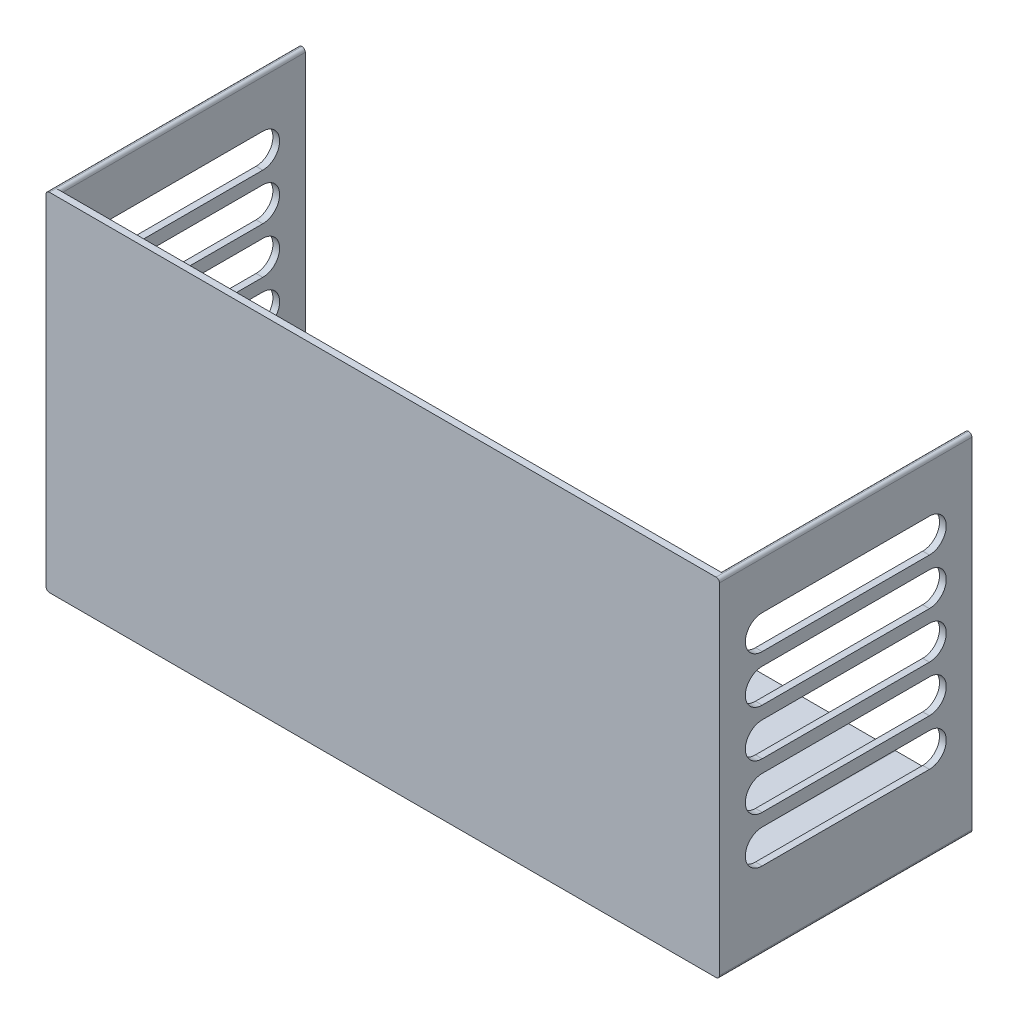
ISO-10303-21;
HEADER;
FILE_DESCRIPTION(('STEP AP214'),'2;1');
FILE_NAME('part.step','',(''),(''),'','','');
FILE_SCHEMA(('AUTOMOTIVE_DESIGN { 1 0 10303 214 1 1 1 1 }'));
ENDSEC;
DATA;
#1=APPLICATION_CONTEXT('core data for automotive mechanical design processes');
#2=APPLICATION_PROTOCOL_DEFINITION('international standard','automotive_design',2000,#1);
#3=PRODUCT_CONTEXT('',#1,'mechanical');
#4=PRODUCT('Part','Part','',(#3));
#5=PRODUCT_RELATED_PRODUCT_CATEGORY('part','',(#4));
#6=PRODUCT_DEFINITION_FORMATION('','',#4);
#7=PRODUCT_DEFINITION_CONTEXT('part definition',#1,'design');
#8=PRODUCT_DEFINITION('design','',#6,#7);
#9=PRODUCT_DEFINITION_SHAPE('','',#8);
#10=(LENGTH_UNIT() NAMED_UNIT(*) SI_UNIT(.MILLI.,.METRE.));
#11=(NAMED_UNIT(*) PLANE_ANGLE_UNIT() SI_UNIT($,.RADIAN.));
#12=(NAMED_UNIT(*) SI_UNIT($,.STERADIAN.) SOLID_ANGLE_UNIT());
#13=UNCERTAINTY_MEASURE_WITH_UNIT(LENGTH_MEASURE(1.E-05),#10,'distance_accuracy_value','');
#14=(GEOMETRIC_REPRESENTATION_CONTEXT(3) GLOBAL_UNCERTAINTY_ASSIGNED_CONTEXT((#13)) GLOBAL_UNIT_ASSIGNED_CONTEXT((#10,
#11,#12)) REPRESENTATION_CONTEXT('',''));
#15=CARTESIAN_POINT('',(0.,0.,0.));
#16=DIRECTION('',(0.,0.,1.));
#17=DIRECTION('',(1.,0.,0.));
#18=AXIS2_PLACEMENT_3D('',#15,#16,#17);
#19=CARTESIAN_POINT('',(-100.,51.5,-37.5));
#20=DIRECTION('',(0.,0.,1.));
#21=DIRECTION('',(1.,0.,0.));
#22=AXIS2_PLACEMENT_3D('',#19,#20,#21);
#23=PLANE('',#22);
#24=DIRECTION('',(-1.,0.,0.));
#25=VECTOR('',#24,1.);
#26=CARTESIAN_POINT('',(0.,-41.5,-37.5));
#27=LINE('',#26,#25);
#28=CARTESIAN_POINT('',(-72.1685341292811,-41.5,-37.5));
#29=VERTEX_POINT('',#28);
#30=CARTESIAN_POINT('',(-97.,-41.5,-37.5));
#31=VERTEX_POINT('',#30);
#32=EDGE_CURVE('E1931',#29,#31,#27,.T.);
#33=ORIENTED_EDGE('',*,*,#32,.F.);
#34=CARTESIAN_POINT('',(-72.1685341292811,-42.5,-37.5));
#35=DIRECTION('',(0.,0.,1.));
#36=DIRECTION('',(1.,0.,0.));
#37=AXIS2_PLACEMENT_3D('',#34,#35,#36);
#38=ELLIPSE('',#37,1.00000951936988,1.);
#39=CARTESIAN_POINT('',(-71.1685246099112,-42.5,-37.5));
#40=VERTEX_POINT('',#39);
#41=EDGE_CURVE('E1863',#29,#40,#38,.F.);
#42=ORIENTED_EDGE('',*,*,#41,.T.);
#43=DIRECTION('',(0.,-1.,0.));
#44=VECTOR('',#43,1.);
#45=CARTESIAN_POINT('',(-71.1685246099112,-41.4704118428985,-37.5));
#46=LINE('',#45,#44);
#47=CARTESIAN_POINT('',(-71.1685246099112,-42.9704118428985,-37.5));
#48=VERTEX_POINT('',#47);
#49=EDGE_CURVE('E2306',#48,#40,#46,.F.);
#50=ORIENTED_EDGE('',*,*,#49,.F.);
#51=CARTESIAN_POINT('',(-71.85,-42.9704118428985,-37.5));
#52=DIRECTION('',(0.,0.,-1.));
#53=DIRECTION('',(-1.,0.,0.));
#54=AXIS2_PLACEMENT_3D('',#51,#52,#53);
#55=CIRCLE('',#54,0.681475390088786);
#56=CARTESIAN_POINT('',(-71.85,-43.6518872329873,-37.5));
#57=VERTEX_POINT('',#56);
#58=EDGE_CURVE('E1341',#57,#48,#55,.F.);
#59=ORIENTED_EDGE('',*,*,#58,.F.);
#60=DIRECTION('',(-1.,0.,0.));
#61=VECTOR('',#60,1.);
#62=CARTESIAN_POINT('',(-71.85,-43.6518872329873,-37.5));
#63=LINE('',#62,#61);
#64=CARTESIAN_POINT('',(-76.3680099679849,-43.6518872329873,-37.5));
#65=VERTEX_POINT('',#64);
#66=EDGE_CURVE('E2346',#65,#57,#63,.F.);
#67=ORIENTED_EDGE('',*,*,#66,.F.);
#68=CARTESIAN_POINT('',(-76.35,-44.9702888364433,-37.5));
#69=DIRECTION('',(0.,0.,-1.));
#70=DIRECTION('',(-1.,0.,0.));
#71=AXIS2_PLACEMENT_3D('',#68,#69,#70);
#72=CIRCLE('',#71,1.31852460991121);
#73=CARTESIAN_POINT('',(-77.6685246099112,-44.9702888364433,-37.5));
#74=VERTEX_POINT('',#73);
#75=EDGE_CURVE('E2343',#74,#65,#72,.T.);
#76=ORIENTED_EDGE('',*,*,#75,.F.);
#77=DIRECTION('',(0.,-1.,0.));
#78=VECTOR('',#77,1.);
#79=CARTESIAN_POINT('',(-77.6685246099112,-47.4704118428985,-37.5));
#80=LINE('',#79,#78);
#81=CARTESIAN_POINT('',(-77.6685246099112,-47.4704118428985,-37.5));
#82=VERTEX_POINT('',#81);
#83=EDGE_CURVE('E2340',#82,#74,#80,.F.);
#84=ORIENTED_EDGE('',*,*,#83,.F.);
#85=CARTESIAN_POINT('',(-76.35,-47.4704118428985,-37.5));
#86=DIRECTION('',(0.,0.,-1.));
#87=DIRECTION('',(-1.,0.,0.));
#88=AXIS2_PLACEMENT_3D('',#85,#86,#87);
#89=CIRCLE('',#88,1.31852460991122);
#90=CARTESIAN_POINT('',(-76.35,-48.7889364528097,-37.5));
#91=VERTEX_POINT('',#90);
#92=EDGE_CURVE('E2337',#91,#82,#89,.T.);
#93=ORIENTED_EDGE('',*,*,#92,.F.);
#94=DIRECTION('',(1.,0.,0.));
#95=VECTOR('',#94,1.);
#96=CARTESIAN_POINT('',(-62.35,-48.7889364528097,-37.5));
#97=LINE('',#96,#95);
#98=CARTESIAN_POINT('',(-62.35,-48.7889364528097,-37.5));
#99=VERTEX_POINT('',#98);
#100=EDGE_CURVE('E2334',#99,#91,#97,.F.);
#101=ORIENTED_EDGE('',*,*,#100,.F.);
#102=CARTESIAN_POINT('',(-62.35,-47.4704118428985,-37.5));
#103=DIRECTION('',(0.,0.,-1.));
#104=DIRECTION('',(-1.,0.,0.));
#105=AXIS2_PLACEMENT_3D('',#102,#103,#104);
#106=CIRCLE('',#105,1.31852460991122);
#107=CARTESIAN_POINT('',(-61.0314753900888,-47.4704118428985,-37.5));
#108=VERTEX_POINT('',#107);
#109=EDGE_CURVE('E2331',#108,#99,#106,.T.);
#110=ORIENTED_EDGE('',*,*,#109,.F.);
#111=DIRECTION('',(0.,1.,0.));
#112=VECTOR('',#111,1.);
#113=CARTESIAN_POINT('',(-61.0314753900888,-47.4704118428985,-37.5));
#114=LINE('',#113,#112);
#115=CARTESIAN_POINT('',(-61.0314753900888,-44.9702888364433,-37.5));
#116=VERTEX_POINT('',#115);
#117=EDGE_CURVE('E2328',#116,#108,#114,.F.);
#118=ORIENTED_EDGE('',*,*,#117,.F.);
#119=CARTESIAN_POINT('',(-62.35,-44.9702888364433,-37.5));
#120=DIRECTION('',(0.,0.,-1.));
#121=DIRECTION('',(-1.,0.,0.));
#122=AXIS2_PLACEMENT_3D('',#119,#120,#121);
#123=CIRCLE('',#122,1.31852460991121);
#124=CARTESIAN_POINT('',(-62.3319900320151,-43.6518872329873,-37.5));
#125=VERTEX_POINT('',#124);
#126=EDGE_CURVE('E2325',#125,#116,#123,.T.);
#127=ORIENTED_EDGE('',*,*,#126,.F.);
#128=DIRECTION('',(-1.,0.,0.));
#129=VECTOR('',#128,1.);
#130=CARTESIAN_POINT('',(-62.3343156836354,-43.6518872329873,-37.5));
#131=LINE('',#130,#129);
#132=CARTESIAN_POINT('',(-66.85,-43.6518872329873,-37.5));
#133=VERTEX_POINT('',#132);
#134=EDGE_CURVE('E2322',#133,#125,#131,.F.);
#135=ORIENTED_EDGE('',*,*,#134,.F.);
#136=CARTESIAN_POINT('',(-66.85,-42.9704118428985,-37.5));
#137=DIRECTION('',(0.,0.,-1.));
#138=DIRECTION('',(-1.,0.,0.));
#139=AXIS2_PLACEMENT_3D('',#136,#137,#138);
#140=CIRCLE('',#139,0.681475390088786);
#141=CARTESIAN_POINT('',(-67.5314753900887,-42.9704118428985,-37.5));
#142=VERTEX_POINT('',#141);
#143=EDGE_CURVE('E2317',#142,#133,#140,.F.);
#144=ORIENTED_EDGE('',*,*,#143,.F.);
#145=DIRECTION('',(0.,1.,0.));
#146=VECTOR('',#145,1.);
#147=CARTESIAN_POINT('',(-67.5314753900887,-42.9704118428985,-37.5));
#148=LINE('',#147,#146);
#149=CARTESIAN_POINT('',(-67.5314753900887,-42.5,-37.5));
#150=VERTEX_POINT('',#149);
#151=EDGE_CURVE('E2313',#150,#142,#148,.F.);
#152=ORIENTED_EDGE('',*,*,#151,.F.);
#153=CARTESIAN_POINT('',(-66.5314658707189,-42.5,-37.5));
#154=DIRECTION('',(0.,0.,1.));
#155=DIRECTION('',(1.,0.,0.));
#156=AXIS2_PLACEMENT_3D('',#153,#154,#155);
#157=ELLIPSE('',#156,1.00000951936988,1.);
#158=CARTESIAN_POINT('',(-66.5314658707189,-41.5,-37.5));
#159=VERTEX_POINT('',#158);
#160=EDGE_CURVE('E1860',#150,#159,#157,.F.);
#161=ORIENTED_EDGE('',*,*,#160,.T.);
#162=CARTESIAN_POINT('',(-47.1685341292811,-41.5,-37.5));
#163=VERTEX_POINT('',#162);
#164=EDGE_CURVE('E1955',#163,#159,#27,.T.);
#165=ORIENTED_EDGE('',*,*,#164,.F.);
#166=CARTESIAN_POINT('',(-47.1685341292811,-42.5,-37.5));
#167=DIRECTION('',(0.,0.,1.));
#168=DIRECTION('',(1.,0.,0.));
#169=AXIS2_PLACEMENT_3D('',#166,#167,#168);
#170=ELLIPSE('',#169,1.00000951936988,1.);
#171=CARTESIAN_POINT('',(-46.1685246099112,-42.5,-37.5));
#172=VERTEX_POINT('',#171);
#173=EDGE_CURVE('E1857',#163,#172,#170,.F.);
#174=ORIENTED_EDGE('',*,*,#173,.T.);
#175=DIRECTION('',(0.,-1.,0.));
#176=VECTOR('',#175,1.);
#177=CARTESIAN_POINT('',(-46.1685246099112,-41.4704118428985,-37.5));
#178=LINE('',#177,#176);
#179=CARTESIAN_POINT('',(-46.1685246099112,-42.9704118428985,-37.5));
#180=VERTEX_POINT('',#179);
#181=EDGE_CURVE('E2191',#180,#172,#178,.F.);
#182=ORIENTED_EDGE('',*,*,#181,.F.);
#183=CARTESIAN_POINT('',(-46.85,-42.9704118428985,-37.5));
#184=DIRECTION('',(0.,0.,-1.));
#185=DIRECTION('',(-1.,0.,0.));
#186=AXIS2_PLACEMENT_3D('',#183,#184,#185);
#187=CIRCLE('',#186,0.681475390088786);
#188=CARTESIAN_POINT('',(-46.85,-43.6518872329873,-37.5));
#189=VERTEX_POINT('',#188);
#190=EDGE_CURVE('E1263',#189,#180,#187,.F.);
#191=ORIENTED_EDGE('',*,*,#190,.F.);
#192=DIRECTION('',(-1.,0.,0.));
#193=VECTOR('',#192,1.);
#194=CARTESIAN_POINT('',(-46.85,-43.6518872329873,-37.5));
#195=LINE('',#194,#193);
#196=CARTESIAN_POINT('',(-51.3680099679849,-43.6518872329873,-37.5));
#197=VERTEX_POINT('',#196);
#198=EDGE_CURVE('E2231',#197,#189,#195,.F.);
#199=ORIENTED_EDGE('',*,*,#198,.F.);
#200=CARTESIAN_POINT('',(-51.35,-44.9702888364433,-37.5));
#201=DIRECTION('',(0.,0.,-1.));
#202=DIRECTION('',(-1.,0.,0.));
#203=AXIS2_PLACEMENT_3D('',#200,#201,#202);
#204=CIRCLE('',#203,1.31852460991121);
#205=CARTESIAN_POINT('',(-52.6685246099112,-44.9702888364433,-37.5));
#206=VERTEX_POINT('',#205);
#207=EDGE_CURVE('E2228',#206,#197,#204,.T.);
#208=ORIENTED_EDGE('',*,*,#207,.F.);
#209=DIRECTION('',(0.,-1.,0.));
#210=VECTOR('',#209,1.);
#211=CARTESIAN_POINT('',(-52.6685246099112,-47.4704118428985,-37.5));
#212=LINE('',#211,#210);
#213=CARTESIAN_POINT('',(-52.6685246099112,-47.4704118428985,-37.5));
#214=VERTEX_POINT('',#213);
#215=EDGE_CURVE('E2225',#214,#206,#212,.F.);
#216=ORIENTED_EDGE('',*,*,#215,.F.);
#217=CARTESIAN_POINT('',(-51.35,-47.4704118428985,-37.5));
#218=DIRECTION('',(0.,0.,-1.));
#219=DIRECTION('',(-1.,0.,0.));
#220=AXIS2_PLACEMENT_3D('',#217,#218,#219);
#221=CIRCLE('',#220,1.31852460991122);
#222=CARTESIAN_POINT('',(-51.35,-48.7889364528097,-37.5));
#223=VERTEX_POINT('',#222);
#224=EDGE_CURVE('E2222',#223,#214,#221,.T.);
#225=ORIENTED_EDGE('',*,*,#224,.F.);
#226=DIRECTION('',(1.,0.,0.));
#227=VECTOR('',#226,1.);
#228=CARTESIAN_POINT('',(-37.35,-48.7889364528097,-37.5));
#229=LINE('',#228,#227);
#230=CARTESIAN_POINT('',(-37.35,-48.7889364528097,-37.5));
#231=VERTEX_POINT('',#230);
#232=EDGE_CURVE('E2219',#231,#223,#229,.F.);
#233=ORIENTED_EDGE('',*,*,#232,.F.);
#234=CARTESIAN_POINT('',(-37.35,-47.4704118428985,-37.5));
#235=DIRECTION('',(0.,0.,-1.));
#236=DIRECTION('',(-1.,0.,0.));
#237=AXIS2_PLACEMENT_3D('',#234,#235,#236);
#238=CIRCLE('',#237,1.31852460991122);
#239=CARTESIAN_POINT('',(-36.0314753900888,-47.4704118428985,-37.5));
#240=VERTEX_POINT('',#239);
#241=EDGE_CURVE('E2216',#240,#231,#238,.T.);
#242=ORIENTED_EDGE('',*,*,#241,.F.);
#243=DIRECTION('',(0.,1.,0.));
#244=VECTOR('',#243,1.);
#245=CARTESIAN_POINT('',(-36.0314753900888,-47.4704118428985,-37.5));
#246=LINE('',#245,#244);
#247=CARTESIAN_POINT('',(-36.0314753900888,-44.9702888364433,-37.5));
#248=VERTEX_POINT('',#247);
#249=EDGE_CURVE('E2213',#248,#240,#246,.F.);
#250=ORIENTED_EDGE('',*,*,#249,.F.);
#251=CARTESIAN_POINT('',(-37.35,-44.9702888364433,-37.5));
#252=DIRECTION('',(0.,0.,-1.));
#253=DIRECTION('',(-1.,0.,0.));
#254=AXIS2_PLACEMENT_3D('',#251,#252,#253);
#255=CIRCLE('',#254,1.31852460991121);
#256=CARTESIAN_POINT('',(-37.3319900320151,-43.6518872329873,-37.5));
#257=VERTEX_POINT('',#256);
#258=EDGE_CURVE('E2210',#257,#248,#255,.T.);
#259=ORIENTED_EDGE('',*,*,#258,.F.);
#260=DIRECTION('',(-1.,0.,0.));
#261=VECTOR('',#260,1.);
#262=CARTESIAN_POINT('',(-37.3343156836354,-43.6518872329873,-37.5));
#263=LINE('',#262,#261);
#264=CARTESIAN_POINT('',(-41.85,-43.6518872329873,-37.5));
#265=VERTEX_POINT('',#264);
#266=EDGE_CURVE('E2207',#265,#257,#263,.F.);
#267=ORIENTED_EDGE('',*,*,#266,.F.);
#268=CARTESIAN_POINT('',(-41.85,-42.9704118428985,-37.5));
#269=DIRECTION('',(0.,0.,-1.));
#270=DIRECTION('',(-1.,0.,0.));
#271=AXIS2_PLACEMENT_3D('',#268,#269,#270);
#272=CIRCLE('',#271,0.681475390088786);
#273=CARTESIAN_POINT('',(-42.5314753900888,-42.9704118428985,-37.5));
#274=VERTEX_POINT('',#273);
#275=EDGE_CURVE('E2202',#274,#265,#272,.F.);
#276=ORIENTED_EDGE('',*,*,#275,.F.);
#277=DIRECTION('',(0.,1.,0.));
#278=VECTOR('',#277,1.);
#279=CARTESIAN_POINT('',(-42.5314753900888,-42.9704118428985,-37.5));
#280=LINE('',#279,#278);
#281=CARTESIAN_POINT('',(-42.5314753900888,-42.5,-37.5));
#282=VERTEX_POINT('',#281);
#283=EDGE_CURVE('E2198',#282,#274,#280,.F.);
#284=ORIENTED_EDGE('',*,*,#283,.F.);
#285=CARTESIAN_POINT('',(-41.5314658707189,-42.5,-37.5));
#286=DIRECTION('',(0.,0.,1.));
#287=DIRECTION('',(1.,0.,0.));
#288=AXIS2_PLACEMENT_3D('',#285,#286,#287);
#289=ELLIPSE('',#288,1.00000951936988,1.);
#290=CARTESIAN_POINT('',(-41.5314658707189,-41.5,-37.5));
#291=VERTEX_POINT('',#290);
#292=EDGE_CURVE('E1854',#282,#291,#289,.F.);
#293=ORIENTED_EDGE('',*,*,#292,.T.);
#294=CARTESIAN_POINT('',(27.8314658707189,-41.5,-37.5));
#295=VERTEX_POINT('',#294);
#296=EDGE_CURVE('E1960',#295,#291,#27,.T.);
#297=ORIENTED_EDGE('',*,*,#296,.F.);
#298=CARTESIAN_POINT('',(27.8314658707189,-42.5,-37.5));
#299=DIRECTION('',(0.,0.,1.));
#300=DIRECTION('',(1.,0.,0.));
#301=AXIS2_PLACEMENT_3D('',#298,#299,#300);
#302=ELLIPSE('',#301,1.00000951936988,1.);
#303=CARTESIAN_POINT('',(28.8314753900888,-42.5,-37.5));
#304=VERTEX_POINT('',#303);
#305=EDGE_CURVE('E1851',#295,#304,#302,.F.);
#306=ORIENTED_EDGE('',*,*,#305,.T.);
#307=DIRECTION('',(0.,-1.,0.));
#308=VECTOR('',#307,1.);
#309=CARTESIAN_POINT('',(28.8314753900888,-41.4704118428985,-37.5));
#310=LINE('',#309,#308);
#311=CARTESIAN_POINT('',(28.8314753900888,-42.9704118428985,-37.5));
#312=VERTEX_POINT('',#311);
#313=EDGE_CURVE('E4081',#312,#304,#310,.F.);
#314=ORIENTED_EDGE('',*,*,#313,.F.);
#315=CARTESIAN_POINT('',(28.15,-42.9704118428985,-37.5));
#316=DIRECTION('',(0.,0.,-1.));
#317=DIRECTION('',(-1.,0.,0.));
#318=AXIS2_PLACEMENT_3D('',#315,#316,#317);
#319=CIRCLE('',#318,0.681475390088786);
#320=CARTESIAN_POINT('',(28.15,-43.6518872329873,-37.5));
#321=VERTEX_POINT('',#320);
#322=EDGE_CURVE('E1157',#321,#312,#319,.F.);
#323=ORIENTED_EDGE('',*,*,#322,.F.);
#324=DIRECTION('',(-1.,0.,0.));
#325=VECTOR('',#324,1.);
#326=CARTESIAN_POINT('',(28.15,-43.6518872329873,-37.5));
#327=LINE('',#326,#325);
#328=CARTESIAN_POINT('',(23.6319900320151,-43.6518872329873,-37.5));
#329=VERTEX_POINT('',#328);
#330=EDGE_CURVE('E2139',#329,#321,#327,.F.);
#331=ORIENTED_EDGE('',*,*,#330,.F.);
#332=CARTESIAN_POINT('',(23.65,-44.9702888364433,-37.5));
#333=DIRECTION('',(0.,0.,-1.));
#334=DIRECTION('',(-1.,0.,0.));
#335=AXIS2_PLACEMENT_3D('',#332,#333,#334);
#336=CIRCLE('',#335,1.31852460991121);
#337=CARTESIAN_POINT('',(22.3314753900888,-44.9702888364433,-37.5));
#338=VERTEX_POINT('',#337);
#339=EDGE_CURVE('E2120',#338,#329,#336,.T.);
#340=ORIENTED_EDGE('',*,*,#339,.F.);
#341=DIRECTION('',(0.,-1.,0.));
#342=VECTOR('',#341,1.);
#343=CARTESIAN_POINT('',(22.3314753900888,-47.4704118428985,-37.5));
#344=LINE('',#343,#342);
#345=CARTESIAN_POINT('',(22.3314753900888,-47.4704118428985,-37.5));
#346=VERTEX_POINT('',#345);
#347=EDGE_CURVE('E2114',#346,#338,#344,.F.);
#348=ORIENTED_EDGE('',*,*,#347,.F.);
#349=CARTESIAN_POINT('',(23.65,-47.4704118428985,-37.5));
#350=DIRECTION('',(0.,0.,-1.));
#351=DIRECTION('',(-1.,0.,0.));
#352=AXIS2_PLACEMENT_3D('',#349,#350,#351);
#353=CIRCLE('',#352,1.31852460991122);
#354=CARTESIAN_POINT('',(23.65,-48.7889364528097,-37.5));
#355=VERTEX_POINT('',#354);
#356=EDGE_CURVE('E4102',#355,#346,#353,.T.);
#357=ORIENTED_EDGE('',*,*,#356,.F.);
#358=DIRECTION('',(1.,0.,0.));
#359=VECTOR('',#358,1.);
#360=CARTESIAN_POINT('',(37.65,-48.7889364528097,-37.5));
#361=LINE('',#360,#359);
#362=CARTESIAN_POINT('',(37.65,-48.7889364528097,-37.5));
#363=VERTEX_POINT('',#362);
#364=EDGE_CURVE('E2102',#363,#355,#361,.F.);
#365=ORIENTED_EDGE('',*,*,#364,.F.);
#366=CARTESIAN_POINT('',(37.65,-47.4704118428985,-37.5));
#367=DIRECTION('',(0.,0.,-1.));
#368=DIRECTION('',(-1.,0.,0.));
#369=AXIS2_PLACEMENT_3D('',#366,#367,#368);
#370=CIRCLE('',#369,1.31852460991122);
#371=CARTESIAN_POINT('',(38.9685246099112,-47.4704118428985,-37.5));
#372=VERTEX_POINT('',#371);
#373=EDGE_CURVE('E2095',#372,#363,#370,.T.);
#374=ORIENTED_EDGE('',*,*,#373,.F.);
#375=DIRECTION('',(0.,1.,0.));
#376=VECTOR('',#375,1.);
#377=CARTESIAN_POINT('',(38.9685246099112,-47.4704118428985,-37.5));
#378=LINE('',#377,#376);
#379=CARTESIAN_POINT('',(38.9685246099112,-44.9702888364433,-37.5));
#380=VERTEX_POINT('',#379);
#381=EDGE_CURVE('E4095',#380,#372,#378,.F.);
#382=ORIENTED_EDGE('',*,*,#381,.F.);
#383=CARTESIAN_POINT('',(37.65,-44.9702888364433,-37.5));
#384=DIRECTION('',(0.,0.,-1.));
#385=DIRECTION('',(-1.,0.,0.));
#386=AXIS2_PLACEMENT_3D('',#383,#384,#385);
#387=CIRCLE('',#386,1.31852460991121);
#388=CARTESIAN_POINT('',(37.6680099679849,-43.6518872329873,-37.5));
#389=VERTEX_POINT('',#388);
#390=EDGE_CURVE('E2081',#389,#380,#387,.T.);
#391=ORIENTED_EDGE('',*,*,#390,.F.);
#392=DIRECTION('',(-1.,0.,0.));
#393=VECTOR('',#392,1.);
#394=CARTESIAN_POINT('',(37.6656843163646,-43.6518872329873,-37.5));
#395=LINE('',#394,#393);
#396=CARTESIAN_POINT('',(33.15,-43.6518872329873,-37.5));
#397=VERTEX_POINT('',#396);
#398=EDGE_CURVE('E2075',#397,#389,#395,.F.);
#399=ORIENTED_EDGE('',*,*,#398,.F.);
#400=CARTESIAN_POINT('',(33.15,-42.9704118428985,-37.5));
#401=DIRECTION('',(0.,0.,-1.));
#402=DIRECTION('',(-1.,0.,0.));
#403=AXIS2_PLACEMENT_3D('',#400,#401,#402);
#404=CIRCLE('',#403,0.681475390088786);
#405=CARTESIAN_POINT('',(32.4685246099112,-42.9704118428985,-37.5));
#406=VERTEX_POINT('',#405);
#407=EDGE_CURVE('E4086',#406,#397,#404,.F.);
#408=ORIENTED_EDGE('',*,*,#407,.F.);
#409=DIRECTION('',(0.,1.,0.));
#410=VECTOR('',#409,1.);
#411=CARTESIAN_POINT('',(32.4685246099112,-42.9704118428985,-37.5));
#412=LINE('',#411,#410);
#413=CARTESIAN_POINT('',(32.4685246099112,-42.5,-37.5));
#414=VERTEX_POINT('',#413);
#415=EDGE_CURVE('E2061',#414,#406,#412,.F.);
#416=ORIENTED_EDGE('',*,*,#415,.F.);
#417=CARTESIAN_POINT('',(33.4685341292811,-42.5,-37.5));
#418=DIRECTION('',(0.,0.,1.));
#419=DIRECTION('',(1.,0.,0.));
#420=AXIS2_PLACEMENT_3D('',#417,#418,#419);
#421=ELLIPSE('',#420,1.00000951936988,1.);
#422=CARTESIAN_POINT('',(33.4685341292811,-41.5,-37.5));
#423=VERTEX_POINT('',#422);
#424=EDGE_CURVE('E1848',#414,#423,#421,.F.);
#425=ORIENTED_EDGE('',*,*,#424,.T.);
#426=CARTESIAN_POINT('',(71.6853708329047,-41.5,-37.5));
#427=VERTEX_POINT('',#426);
#428=EDGE_CURVE('E1953',#427,#423,#27,.T.);
#429=ORIENTED_EDGE('',*,*,#428,.F.);
#430=CARTESIAN_POINT('',(71.6853708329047,-42.5,-37.5));
#431=DIRECTION('',(0.,0.,1.));
#432=DIRECTION('',(-1.,0.,0.));
#433=AXIS2_PLACEMENT_3D('',#430,#431,#432);
#434=ELLIPSE('',#433,1.00000951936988,1.);
#435=CARTESIAN_POINT('',(72.6814753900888,-42.4117129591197,-37.5));
#436=VERTEX_POINT('',#435);
#437=EDGE_CURVE('E1845',#427,#436,#434,.F.);
#438=ORIENTED_EDGE('',*,*,#437,.T.);
#439=CARTESIAN_POINT('',(72.,-42.4117129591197,-37.5));
#440=DIRECTION('',(0.,0.,-1.));
#441=DIRECTION('',(-1.,0.,0.));
#442=AXIS2_PLACEMENT_3D('',#439,#440,#441);
#443=CIRCLE('',#442,0.681475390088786);
#444=CARTESIAN_POINT('',(72.,-43.0931883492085,-37.5));
#445=VERTEX_POINT('',#444);
#446=EDGE_CURVE('E1419',#445,#436,#443,.F.);
#447=ORIENTED_EDGE('',*,*,#446,.F.);
#448=DIRECTION('',(-1.,0.,0.));
#449=VECTOR('',#448,1.);
#450=CARTESIAN_POINT('',(72.,-43.0931883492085,-37.5));
#451=LINE('',#450,#449);
#452=CARTESIAN_POINT('',(67.4819900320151,-43.0931883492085,-37.5));
#453=VERTEX_POINT('',#452);
#454=EDGE_CURVE('E1984',#453,#445,#451,.F.);
#455=ORIENTED_EDGE('',*,*,#454,.F.);
#456=CARTESIAN_POINT('',(67.5,-44.4115899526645,-37.5));
#457=DIRECTION('',(0.,0.,-1.));
#458=DIRECTION('',(-1.,0.,0.));
#459=AXIS2_PLACEMENT_3D('',#456,#457,#458);
#460=CIRCLE('',#459,1.31852460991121);
#461=CARTESIAN_POINT('',(66.1814753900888,-44.4115899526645,-37.5));
#462=VERTEX_POINT('',#461);
#463=EDGE_CURVE('E2438',#462,#453,#460,.T.);
#464=ORIENTED_EDGE('',*,*,#463,.F.);
#465=DIRECTION('',(0.,-1.,0.));
#466=VECTOR('',#465,1.);
#467=CARTESIAN_POINT('',(66.1814753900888,-46.9117129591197,-37.5));
#468=LINE('',#467,#466);
#469=CARTESIAN_POINT('',(66.1814753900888,-46.9117129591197,-37.5));
#470=VERTEX_POINT('',#469);
#471=EDGE_CURVE('E2436',#470,#462,#468,.F.);
#472=ORIENTED_EDGE('',*,*,#471,.F.);
#473=CARTESIAN_POINT('',(67.5,-46.9117129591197,-37.5));
#474=DIRECTION('',(0.,0.,-1.));
#475=DIRECTION('',(-1.,0.,0.));
#476=AXIS2_PLACEMENT_3D('',#473,#474,#475);
#477=CIRCLE('',#476,1.31852460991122);
#478=CARTESIAN_POINT('',(67.5,-48.2302375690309,-37.5));
#479=VERTEX_POINT('',#478);
#480=EDGE_CURVE('E2433',#479,#470,#477,.T.);
#481=ORIENTED_EDGE('',*,*,#480,.F.);
#482=DIRECTION('',(1.,0.,0.));
#483=VECTOR('',#482,1.);
#484=CARTESIAN_POINT('',(81.5,-48.2302375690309,-37.5));
#485=LINE('',#484,#483);
#486=CARTESIAN_POINT('',(81.5,-48.2302375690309,-37.5));
#487=VERTEX_POINT('',#486);
#488=EDGE_CURVE('E2430',#487,#479,#485,.F.);
#489=ORIENTED_EDGE('',*,*,#488,.F.);
#490=CARTESIAN_POINT('',(81.5,-46.9117129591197,-37.5));
#491=DIRECTION('',(0.,0.,-1.));
#492=DIRECTION('',(-1.,0.,0.));
#493=AXIS2_PLACEMENT_3D('',#490,#491,#492);
#494=CIRCLE('',#493,1.31852460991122);
#495=CARTESIAN_POINT('',(82.8185246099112,-46.9117129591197,-37.5));
#496=VERTEX_POINT('',#495);
#497=EDGE_CURVE('E2427',#496,#487,#494,.T.);
#498=ORIENTED_EDGE('',*,*,#497,.F.);
#499=DIRECTION('',(0.,1.,0.));
#500=VECTOR('',#499,1.);
#501=CARTESIAN_POINT('',(82.8185246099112,-46.9117129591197,-37.5));
#502=LINE('',#501,#500);
#503=CARTESIAN_POINT('',(82.8185246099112,-44.4115899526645,-37.5));
#504=VERTEX_POINT('',#503);
#505=EDGE_CURVE('E2424',#504,#496,#502,.F.);
#506=ORIENTED_EDGE('',*,*,#505,.F.);
#507=CARTESIAN_POINT('',(81.5,-44.4115899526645,-37.5));
#508=DIRECTION('',(0.,0.,-1.));
#509=DIRECTION('',(-1.,0.,0.));
#510=AXIS2_PLACEMENT_3D('',#507,#508,#509);
#511=CIRCLE('',#510,1.31852460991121);
#512=CARTESIAN_POINT('',(81.5180099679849,-43.0931883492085,-37.5));
#513=VERTEX_POINT('',#512);
#514=EDGE_CURVE('E2419',#513,#504,#511,.T.);
#515=ORIENTED_EDGE('',*,*,#514,.F.);
#516=DIRECTION('',(-1.,0.,0.));
#517=VECTOR('',#516,1.);
#518=CARTESIAN_POINT('',(81.5156843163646,-43.0931883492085,-37.5));
#519=LINE('',#518,#517);
#520=CARTESIAN_POINT('',(77.,-43.0931883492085,-37.5));
#521=VERTEX_POINT('',#520);
#522=EDGE_CURVE('E2414',#521,#513,#519,.F.);
#523=ORIENTED_EDGE('',*,*,#522,.F.);
#524=CARTESIAN_POINT('',(77.,-42.4117129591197,-37.5));
#525=DIRECTION('',(0.,0.,-1.));
#526=DIRECTION('',(-1.,0.,0.));
#527=AXIS2_PLACEMENT_3D('',#524,#525,#526);
#528=CIRCLE('',#527,0.681475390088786);
#529=CARTESIAN_POINT('',(76.3185246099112,-42.4117129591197,-37.5));
#530=VERTEX_POINT('',#529);
#531=EDGE_CURVE('E2410',#530,#521,#528,.F.);
#532=ORIENTED_EDGE('',*,*,#531,.F.);
#533=CARTESIAN_POINT('',(77.3146291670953,-42.5,-37.5));
#534=DIRECTION('',(0.,0.,1.));
#535=DIRECTION('',(1.,0.,0.));
#536=AXIS2_PLACEMENT_3D('',#533,#534,#535);
#537=ELLIPSE('',#536,1.00000951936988,1.);
#538=CARTESIAN_POINT('',(77.3146291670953,-41.5,-37.5));
#539=VERTEX_POINT('',#538);
#540=EDGE_CURVE('E1842',#530,#539,#537,.F.);
#541=ORIENTED_EDGE('',*,*,#540,.T.);
#542=CARTESIAN_POINT('',(97.,-41.5,-37.5));
#543=VERTEX_POINT('',#542);
#544=EDGE_CURVE('E1947',#543,#539,#27,.T.);
#545=ORIENTED_EDGE('',*,*,#544,.F.);
#546=CARTESIAN_POINT('',(97.,-40.5,-37.5));
#547=DIRECTION('',(0.,0.,1.));
#548=DIRECTION('',(1.,0.,0.));
#549=AXIS2_PLACEMENT_3D('',#546,#547,#548);
#550=CIRCLE('',#549,1.);
#551=CARTESIAN_POINT('',(98.,-40.5,-37.5));
#552=VERTEX_POINT('',#551);
#553=EDGE_CURVE('E11',#543,#552,#550,.T.);
#554=ORIENTED_EDGE('',*,*,#553,.T.);
#555=DIRECTION('',(0.,-1.,0.));
#556=VECTOR('',#555,1.);
#557=CARTESIAN_POINT('',(98.,51.5,-37.5));
#558=LINE('',#557,#556);
#559=CARTESIAN_POINT('',(98.,50.5,-37.5));
#560=VERTEX_POINT('',#559);
#561=EDGE_CURVE('E1922',#560,#552,#558,.T.);
#562=ORIENTED_EDGE('',*,*,#561,.F.);
#563=CARTESIAN_POINT('',(99.,50.5,-37.5));
#564=DIRECTION('',(0.,0.,1.));
#565=DIRECTION('',(1.,0.,0.));
#566=AXIS2_PLACEMENT_3D('',#563,#564,#565);
#567=CIRCLE('',#566,1.);
#568=CARTESIAN_POINT('',(99.,51.5,-37.5));
#569=VERTEX_POINT('',#568);
#570=EDGE_CURVE('E1828',#560,#569,#567,.F.);
#571=ORIENTED_EDGE('',*,*,#570,.T.);
#572=CARTESIAN_POINT('',(99.,50.5,-37.5));
#573=DIRECTION('',(0.,0.,1.));
#574=DIRECTION('',(1.,0.,0.));
#575=AXIS2_PLACEMENT_3D('',#572,#573,#574);
#576=CIRCLE('',#575,1.);
#577=CARTESIAN_POINT('',(100.,50.5,-37.5));
#578=VERTEX_POINT('',#577);
#579=EDGE_CURVE('E1644',#569,#578,#576,.F.);
#580=ORIENTED_EDGE('',*,*,#579,.T.);
#581=DIRECTION('',(0.,-1.,0.));
#582=VECTOR('',#581,1.);
#583=CARTESIAN_POINT('',(100.,51.5,-37.5));
#584=LINE('',#583,#582);
#585=CARTESIAN_POINT('',(100.,-50.5,-37.5));
#586=VERTEX_POINT('',#585);
#587=EDGE_CURVE('E1694',#578,#586,#584,.T.);
#588=ORIENTED_EDGE('',*,*,#587,.T.);
#589=CARTESIAN_POINT('',(99.,-50.5,-37.5));
#590=DIRECTION('',(0.,0.,1.));
#591=DIRECTION('',(1.,0.,0.));
#592=AXIS2_PLACEMENT_3D('',#589,#590,#591);
#593=CIRCLE('',#592,1.);
#594=CARTESIAN_POINT('',(99.,-51.5,-37.5));
#595=VERTEX_POINT('',#594);
#596=EDGE_CURVE('E1825',#586,#595,#593,.F.);
#597=ORIENTED_EDGE('',*,*,#596,.T.);
#598=DIRECTION('',(-1.,0.,0.));
#599=VECTOR('',#598,1.);
#600=CARTESIAN_POINT('',(-100.,-51.5,-37.5));
#601=LINE('',#600,#599);
#602=CARTESIAN_POINT('',(-99.,-51.5,-37.5));
#603=VERTEX_POINT('',#602);
#604=EDGE_CURVE('E2016',#595,#603,#601,.T.);
#605=ORIENTED_EDGE('',*,*,#604,.T.);
#606=CARTESIAN_POINT('',(-99.,-50.5,-37.5));
#607=DIRECTION('',(0.,0.,1.));
#608=DIRECTION('',(1.,0.,0.));
#609=AXIS2_PLACEMENT_3D('',#606,#607,#608);
#610=CIRCLE('',#609,1.);
#611=CARTESIAN_POINT('',(-100.,-50.5,-37.5));
#612=VERTEX_POINT('',#611);
#613=EDGE_CURVE('E1833',#603,#612,#610,.F.);
#614=ORIENTED_EDGE('',*,*,#613,.T.);
#615=DIRECTION('',(0.,-1.,0.));
#616=VECTOR('',#615,1.);
#617=CARTESIAN_POINT('',(-100.,51.5,-37.5));
#618=LINE('',#617,#616);
#619=CARTESIAN_POINT('',(-100.,50.5,-37.5));
#620=VERTEX_POINT('',#619);
#621=EDGE_CURVE('E1684',#620,#612,#618,.T.);
#622=ORIENTED_EDGE('',*,*,#621,.F.);
#623=CARTESIAN_POINT('',(-99.,50.5,-37.5));
#624=DIRECTION('',(0.,0.,1.));
#625=DIRECTION('',(1.,0.,0.));
#626=AXIS2_PLACEMENT_3D('',#623,#624,#625);
#627=CIRCLE('',#626,1.);
#628=CARTESIAN_POINT('',(-99.,51.5,-37.5));
#629=VERTEX_POINT('',#628);
#630=EDGE_CURVE('E1836',#620,#629,#627,.F.);
#631=ORIENTED_EDGE('',*,*,#630,.T.);
#632=CARTESIAN_POINT('',(-99.,50.5,-37.5));
#633=DIRECTION('',(0.,0.,1.));
#634=DIRECTION('',(1.,0.,0.));
#635=AXIS2_PLACEMENT_3D('',#632,#633,#634);
#636=CIRCLE('',#635,1.);
#637=CARTESIAN_POINT('',(-98.,50.5,-37.5));
#638=VERTEX_POINT('',#637);
#639=EDGE_CURVE('E1839',#629,#638,#636,.F.);
#640=ORIENTED_EDGE('',*,*,#639,.T.);
#641=DIRECTION('',(0.,-1.,0.));
#642=VECTOR('',#641,1.);
#643=CARTESIAN_POINT('',(-98.,51.5,-37.5));
#644=LINE('',#643,#642);
#645=CARTESIAN_POINT('',(-98.,-40.5,-37.5));
#646=VERTEX_POINT('',#645);
#647=EDGE_CURVE('E1914',#638,#646,#644,.T.);
#648=ORIENTED_EDGE('',*,*,#647,.T.);
#649=CARTESIAN_POINT('',(-97.,-40.5,-37.5));
#650=DIRECTION('',(0.,0.,1.));
#651=DIRECTION('',(1.,0.,0.));
#652=AXIS2_PLACEMENT_3D('',#649,#650,#651);
#653=CIRCLE('',#652,1.);
#654=EDGE_CURVE('E1624',#646,#31,#653,.T.);
#655=ORIENTED_EDGE('',*,*,#654,.T.);
#656=EDGE_LOOP('',(#33,#42,#50,#59,#67,#76,#84,#93,#101,#110,#118,#127,#135,#144,#152,#161,#165,
#174,#182,#191,#199,#208,#216,#225,#233,#242,#250,#259,#267,#276,#284,#293,#297,#306,#314,#323,
#331,#340,#348,#357,#365,#374,#382,#391,#399,#408,#416,#425,#429,#438,#447,#455,#464,#472,#481,
#489,#498,#506,#515,#523,#532,#541,#545,#554,#562,#571,#580,#588,#597,#605,#614,#622,#631,#640,
#648,#655));
#657=FACE_BOUND('',#656,.T.);
#658=ADVANCED_FACE('F45',(#657),#23,.F.);
#659=CARTESIAN_POINT('',(0.,-41.5,0.));
#660=DIRECTION('',(0.,-1.,0.));
#661=DIRECTION('',(0.,0.,-1.));
#662=AXIS2_PLACEMENT_3D('',#659,#660,#661);
#663=PLANE('',#662);
#664=ORIENTED_EDGE('',*,*,#296,.T.);
#665=DIRECTION('',(-0.00436330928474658,0.,0.999990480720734));
#666=VECTOR('',#665,1.);
#667=CARTESIAN_POINT('',(-41.8500095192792,-41.5,35.5043633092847));
#668=LINE('',#667,#666);
#669=CARTESIAN_POINT('',(-41.8499904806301,-41.5,35.5));
#670=VERTEX_POINT('',#669);
#671=EDGE_CURVE('E1887',#291,#670,#668,.T.);
#672=ORIENTED_EDGE('',*,*,#671,.T.);
#673=DIRECTION('',(1.,0.,0.));
#674=VECTOR('',#673,1.);
#675=CARTESIAN_POINT('',(0.,-41.5,35.5));
#676=LINE('',#675,#674);
#677=CARTESIAN_POINT('',(28.1499904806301,-41.5,35.5));
#678=VERTEX_POINT('',#677);
#679=EDGE_CURVE('E1942',#670,#678,#676,.T.);
#680=ORIENTED_EDGE('',*,*,#679,.T.);
#681=DIRECTION('',(-0.00436330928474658,0.,-0.999990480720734));
#682=VECTOR('',#681,1.);
#683=CARTESIAN_POINT('',(27.8314849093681,-41.5,-37.4956366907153));
#684=LINE('',#683,#682);
#685=EDGE_CURVE('E1884',#678,#295,#684,.T.);
#686=ORIENTED_EDGE('',*,*,#685,.T.);
#687=EDGE_LOOP('',(#664,#672,#680,#686));
#688=FACE_BOUND('',#687,.T.);
#689=ADVANCED_FACE('F1468',(#688),#663,.F.);
#690=ORIENTED_EDGE('',*,*,#428,.T.);
#691=DIRECTION('',(-0.00436330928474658,0.,0.999990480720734));
#692=VECTOR('',#691,1.);
#693=CARTESIAN_POINT('',(33.1499904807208,-41.5,35.5043633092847));
#694=LINE('',#693,#692);
#695=CARTESIAN_POINT('',(33.1500095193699,-41.5,35.5));
#696=VERTEX_POINT('',#695);
#697=EDGE_CURVE('E1901',#423,#696,#694,.T.);
#698=ORIENTED_EDGE('',*,*,#697,.T.);
#699=CARTESIAN_POINT('',(72.0038954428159,-41.5,35.5));
#700=VERTEX_POINT('',#699);
#701=EDGE_CURVE('E1946',#696,#700,#676,.T.);
#702=ORIENTED_EDGE('',*,*,#701,.T.);
#703=DIRECTION('',(-0.00436330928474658,0.,-0.999990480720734));
#704=VECTOR('',#703,1.);
#705=CARTESIAN_POINT('',(71.8476285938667,-41.5,-0.31349640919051));
#706=LINE('',#705,#704);
#707=EDGE_CURVE('E1898',#700,#427,#706,.T.);
#708=ORIENTED_EDGE('',*,*,#707,.T.);
#709=EDGE_LOOP('',(#690,#698,#702,#708));
#710=FACE_BOUND('',#709,.T.);
#711=ADVANCED_FACE('F1471',(#710),#663,.F.);
#712=ORIENTED_EDGE('',*,*,#164,.T.);
#713=DIRECTION('',(-0.00436330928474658,0.,0.999990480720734));
#714=VECTOR('',#713,1.);
#715=CARTESIAN_POINT('',(-66.8500095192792,-41.5,35.5043633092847));
#716=LINE('',#715,#714);
#717=CARTESIAN_POINT('',(-66.8499904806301,-41.5,35.5));
#718=VERTEX_POINT('',#717);
#719=EDGE_CURVE('E1873',#159,#718,#716,.T.);
#720=ORIENTED_EDGE('',*,*,#719,.T.);
#721=CARTESIAN_POINT('',(-46.8500095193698,-41.5,35.5));
#722=VERTEX_POINT('',#721);
#723=EDGE_CURVE('E1934',#718,#722,#676,.T.);
#724=ORIENTED_EDGE('',*,*,#723,.T.);
#725=DIRECTION('',(-0.00436330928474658,0.,-0.999990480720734));
#726=VECTOR('',#725,1.);
#727=CARTESIAN_POINT('',(-47.1685150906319,-41.5,-37.4956366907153));
#728=LINE('',#727,#726);
#729=EDGE_CURVE('E1870',#722,#163,#728,.T.);
#730=ORIENTED_EDGE('',*,*,#729,.T.);
#731=EDGE_LOOP('',(#712,#720,#724,#730));
#732=FACE_BOUND('',#731,.T.);
#733=ADVANCED_FACE('F2038',(#732),#663,.F.);
#734=CARTESIAN_POINT('',(-97.,-41.5,35.5));
#735=VERTEX_POINT('',#734);
#736=CARTESIAN_POINT('',(-71.8500095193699,-41.5,35.5));
#737=VERTEX_POINT('',#736);
#738=EDGE_CURVE('E1929',#735,#737,#676,.T.);
#739=ORIENTED_EDGE('',*,*,#738,.T.);
#740=DIRECTION('',(-0.00436330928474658,0.,-0.999990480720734));
#741=VECTOR('',#740,1.);
#742=CARTESIAN_POINT('',(-72.1685150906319,-41.5,-37.4956366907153));
#743=LINE('',#742,#741);
#744=EDGE_CURVE('E1822',#737,#29,#743,.T.);
#745=ORIENTED_EDGE('',*,*,#744,.T.);
#746=ORIENTED_EDGE('',*,*,#32,.T.);
#747=DIRECTION('',(0.,0.,1.));
#748=VECTOR('',#747,1.);
#749=CARTESIAN_POINT('',(-97.,-41.5,0.));
#750=LINE('',#749,#748);
#751=EDGE_CURVE('E1818',#31,#735,#750,.T.);
#752=ORIENTED_EDGE('',*,*,#751,.T.);
#753=EDGE_LOOP('',(#739,#745,#746,#752));
#754=FACE_BOUND('',#753,.T.);
#755=ADVANCED_FACE('F1928',(#754),#663,.F.);
#756=ORIENTED_EDGE('',*,*,#544,.T.);
#757=DIRECTION('',(0.00436330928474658,0.,-0.999990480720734));
#758=VECTOR('',#757,1.);
#759=CARTESIAN_POINT('',(77.1495346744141,-41.5,0.336630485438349));
#760=LINE('',#759,#758);
#761=CARTESIAN_POINT('',(76.9961045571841,-41.5,35.5));
#762=VERTEX_POINT('',#761);
#763=EDGE_CURVE('E1906',#539,#762,#760,.F.);
#764=ORIENTED_EDGE('',*,*,#763,.T.);
#765=CARTESIAN_POINT('',(97.,-41.5,35.5));
#766=VERTEX_POINT('',#765);
#767=EDGE_CURVE('E1936',#762,#766,#676,.T.);
#768=ORIENTED_EDGE('',*,*,#767,.T.);
#769=DIRECTION('',(0.,0.,-1.));
#770=VECTOR('',#769,1.);
#771=CARTESIAN_POINT('',(97.,-41.5,0.));
#772=LINE('',#771,#770);
#773=EDGE_CURVE('E1564',#766,#543,#772,.T.);
#774=ORIENTED_EDGE('',*,*,#773,.T.);
#775=EDGE_LOOP('',(#756,#764,#768,#774));
#776=FACE_BOUND('',#775,.T.);
#777=ADVANCED_FACE('F1473',(#776),#663,.F.);
#778=CARTESIAN_POINT('',(0.,51.5,0.));
#779=DIRECTION('',(0.,-1.,0.));
#780=DIRECTION('',(0.,0.,-1.));
#781=AXIS2_PLACEMENT_3D('',#778,#779,#780);
#782=PLANE('',#781);
#783=DIRECTION('',(1.,0.,0.));
#784=VECTOR('',#783,1.);
#785=CARTESIAN_POINT('',(0.,51.5,35.5));
#786=LINE('',#785,#784);
#787=CARTESIAN_POINT('',(-99.,51.5,35.5));
#788=VERTEX_POINT('',#787);
#789=CARTESIAN_POINT('',(99.,51.5,35.5));
#790=VERTEX_POINT('',#789);
#791=EDGE_CURVE('E1648',#788,#790,#786,.T.);
#792=ORIENTED_EDGE('',*,*,#791,.F.);
#793=DIRECTION('',(0.,0.,1.));
#794=VECTOR('',#793,1.);
#795=CARTESIAN_POINT('',(-99.,51.5,0.));
#796=LINE('',#795,#794);
#797=CARTESIAN_POINT('',(-99.,51.5,37.5));
#798=VERTEX_POINT('',#797);
#799=EDGE_CURVE('E1652',#788,#798,#796,.T.);
#800=ORIENTED_EDGE('',*,*,#799,.T.);
#801=DIRECTION('',(1.,0.,0.));
#802=VECTOR('',#801,1.);
#803=CARTESIAN_POINT('',(-100.,51.5,37.5));
#804=LINE('',#803,#802);
#805=CARTESIAN_POINT('',(99.,51.5,37.5));
#806=VERTEX_POINT('',#805);
#807=EDGE_CURVE('E1650',#798,#806,#804,.T.);
#808=ORIENTED_EDGE('',*,*,#807,.T.);
#809=DIRECTION('',(0.,0.,-1.));
#810=VECTOR('',#809,1.);
#811=CARTESIAN_POINT('',(99.,51.5,0.));
#812=LINE('',#811,#810);
#813=EDGE_CURVE('E1642',#806,#790,#812,.T.);
#814=ORIENTED_EDGE('',*,*,#813,.T.);
#815=EDGE_LOOP('',(#792,#800,#808,#814));
#816=FACE_BOUND('',#815,.T.);
#817=ADVANCED_FACE('F1474',(#816),#782,.F.);
#818=CARTESIAN_POINT('',(100.,51.5,37.5));
#819=DIRECTION('',(-1.,0.,0.));
#820=DIRECTION('',(0.,0.,1.));
#821=AXIS2_PLACEMENT_3D('',#818,#819,#820);
#822=PLANE('',#821);
#823=DIRECTION('',(0.,0.,-1.));
#824=VECTOR('',#823,1.);
#825=CARTESIAN_POINT('',(100.,36.5,-24.8711687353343));
#826=LINE('',#825,#824);
#827=CARTESIAN_POINT('',(100.,36.5,24.8));
#828=VERTEX_POINT('',#827);
#829=CARTESIAN_POINT('',(100.,36.5,-24.8711687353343));
#830=VERTEX_POINT('',#829);
#831=EDGE_CURVE('E868',#828,#830,#826,.T.);
#832=ORIENTED_EDGE('',*,*,#831,.T.);
#833=CARTESIAN_POINT('',(100.,31.5,-24.8711687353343));
#834=DIRECTION('',(-1.,0.,0.));
#835=DIRECTION('',(0.,0.,1.));
#836=AXIS2_PLACEMENT_3D('',#833,#834,#835);
#837=CIRCLE('',#836,5.);
#838=CARTESIAN_POINT('',(100.,26.5,-24.8711687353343));
#839=VERTEX_POINT('',#838);
#840=EDGE_CURVE('E855',#830,#839,#837,.T.);
#841=ORIENTED_EDGE('',*,*,#840,.T.);
#842=DIRECTION('',(0.,0.,1.));
#843=VECTOR('',#842,1.);
#844=CARTESIAN_POINT('',(100.,26.5,-24.8711687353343));
#845=LINE('',#844,#843);
#846=CARTESIAN_POINT('',(100.,26.5,24.8));
#847=VERTEX_POINT('',#846);
#848=EDGE_CURVE('E859',#839,#847,#845,.T.);
#849=ORIENTED_EDGE('',*,*,#848,.T.);
#850=CARTESIAN_POINT('',(100.,31.5,24.8));
#851=DIRECTION('',(-1.,0.,0.));
#852=DIRECTION('',(0.,0.,1.));
#853=AXIS2_PLACEMENT_3D('',#850,#851,#852);
#854=CIRCLE('',#853,5.);
#855=EDGE_CURVE('E864',#847,#828,#854,.T.);
#856=ORIENTED_EDGE('',*,*,#855,.T.);
#857=EDGE_LOOP('',(#832,#841,#849,#856));
#858=FACE_BOUND('',#857,.T.);
#859=DIRECTION('',(0.,0.,-1.));
#860=VECTOR('',#859,1.);
#861=CARTESIAN_POINT('',(100.,22.7166666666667,-24.8711687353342));
#862=LINE('',#861,#860);
#863=CARTESIAN_POINT('',(100.,22.7166666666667,24.8000000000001));
#864=VERTEX_POINT('',#863);
#865=CARTESIAN_POINT('',(100.,22.7166666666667,-24.8711687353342));
#866=VERTEX_POINT('',#865);
#867=EDGE_CURVE('E901',#864,#866,#862,.T.);
#868=ORIENTED_EDGE('',*,*,#867,.T.);
#869=CARTESIAN_POINT('',(100.,17.7166666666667,-24.8711687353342));
#870=DIRECTION('',(-1.,0.,0.));
#871=DIRECTION('',(0.,0.,1.));
#872=AXIS2_PLACEMENT_3D('',#869,#870,#871);
#873=CIRCLE('',#872,5.);
#874=CARTESIAN_POINT('',(100.,12.7166666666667,-24.8711687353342));
#875=VERTEX_POINT('',#874);
#876=EDGE_CURVE('E860',#866,#875,#873,.T.);
#877=ORIENTED_EDGE('',*,*,#876,.T.);
#878=DIRECTION('',(0.,0.,1.));
#879=VECTOR('',#878,1.);
#880=CARTESIAN_POINT('',(100.,12.7166666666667,-24.8711687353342));
#881=LINE('',#880,#879);
#882=CARTESIAN_POINT('',(100.,12.7166666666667,24.8000000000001));
#883=VERTEX_POINT('',#882);
#884=EDGE_CURVE('E919',#875,#883,#881,.T.);
#885=ORIENTED_EDGE('',*,*,#884,.T.);
#886=CARTESIAN_POINT('',(100.,17.7166666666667,24.8000000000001));
#887=DIRECTION('',(-1.,0.,0.));
#888=DIRECTION('',(0.,0.,1.));
#889=AXIS2_PLACEMENT_3D('',#886,#887,#888);
#890=CIRCLE('',#889,5.);
#891=EDGE_CURVE('E915',#883,#864,#890,.T.);
#892=ORIENTED_EDGE('',*,*,#891,.T.);
#893=EDGE_LOOP('',(#868,#877,#885,#892));
#894=FACE_BOUND('',#893,.T.);
#895=DIRECTION('',(0.,0.,-1.));
#896=VECTOR('',#895,1.);
#897=CARTESIAN_POINT('',(100.,8.93333333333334,-24.8711687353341));
#898=LINE('',#897,#896);
#899=CARTESIAN_POINT('',(100.,8.93333333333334,24.8000000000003));
#900=VERTEX_POINT('',#899);
#901=CARTESIAN_POINT('',(100.,8.93333333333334,-24.8711687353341));
#902=VERTEX_POINT('',#901);
#903=EDGE_CURVE('E935',#900,#902,#898,.T.);
#904=ORIENTED_EDGE('',*,*,#903,.T.);
#905=CARTESIAN_POINT('',(100.,3.93333333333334,-24.8711687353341));
#906=DIRECTION('',(-1.,0.,0.));
#907=DIRECTION('',(0.,0.,1.));
#908=AXIS2_PLACEMENT_3D('',#905,#906,#907);
#909=CIRCLE('',#908,5.);
#910=CARTESIAN_POINT('',(100.,-1.06666666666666,-24.8711687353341));
#911=VERTEX_POINT('',#910);
#912=EDGE_CURVE('E957',#902,#911,#909,.T.);
#913=ORIENTED_EDGE('',*,*,#912,.T.);
#914=DIRECTION('',(0.,0.,1.));
#915=VECTOR('',#914,1.);
#916=CARTESIAN_POINT('',(100.,-1.06666666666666,-24.8711687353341));
#917=LINE('',#916,#915);
#918=CARTESIAN_POINT('',(100.,-1.06666666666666,24.8000000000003));
#919=VERTEX_POINT('',#918);
#920=EDGE_CURVE('E953',#911,#919,#917,.T.);
#921=ORIENTED_EDGE('',*,*,#920,.T.);
#922=CARTESIAN_POINT('',(100.,3.93333333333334,24.8000000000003));
#923=DIRECTION('',(-1.,0.,0.));
#924=DIRECTION('',(0.,0.,1.));
#925=AXIS2_PLACEMENT_3D('',#922,#923,#924);
#926=CIRCLE('',#925,5.);
#927=EDGE_CURVE('E949',#919,#900,#926,.T.);
#928=ORIENTED_EDGE('',*,*,#927,.T.);
#929=EDGE_LOOP('',(#904,#913,#921,#928));
#930=FACE_BOUND('',#929,.T.);
#931=DIRECTION('',(0.,0.,-1.));
#932=VECTOR('',#931,1.);
#933=CARTESIAN_POINT('',(100.,-4.85,-24.8711687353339));
#934=LINE('',#933,#932);
#935=CARTESIAN_POINT('',(100.,-4.85,24.8000000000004));
#936=VERTEX_POINT('',#935);
#937=CARTESIAN_POINT('',(100.,-4.85,-24.8711687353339));
#938=VERTEX_POINT('',#937);
#939=EDGE_CURVE('E970',#936,#938,#934,.T.);
#940=ORIENTED_EDGE('',*,*,#939,.T.);
#941=CARTESIAN_POINT('',(100.,-9.85,-24.8711687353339));
#942=DIRECTION('',(-1.,0.,0.));
#943=DIRECTION('',(0.,0.,1.));
#944=AXIS2_PLACEMENT_3D('',#941,#942,#943);
#945=CIRCLE('',#944,5.);
#946=CARTESIAN_POINT('',(100.,-14.85,-24.8711687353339));
#947=VERTEX_POINT('',#946);
#948=EDGE_CURVE('E992',#938,#947,#945,.T.);
#949=ORIENTED_EDGE('',*,*,#948,.T.);
#950=DIRECTION('',(0.,0.,1.));
#951=VECTOR('',#950,1.);
#952=CARTESIAN_POINT('',(100.,-14.85,-24.8711687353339));
#953=LINE('',#952,#951);
#954=CARTESIAN_POINT('',(100.,-14.85,24.8000000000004));
#955=VERTEX_POINT('',#954);
#956=EDGE_CURVE('E988',#947,#955,#953,.T.);
#957=ORIENTED_EDGE('',*,*,#956,.T.);
#958=CARTESIAN_POINT('',(100.,-9.85,24.8000000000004));
#959=DIRECTION('',(-1.,0.,0.));
#960=DIRECTION('',(0.,0.,1.));
#961=AXIS2_PLACEMENT_3D('',#958,#959,#960);
#962=CIRCLE('',#961,5.);
#963=EDGE_CURVE('E984',#955,#936,#962,.T.);
#964=ORIENTED_EDGE('',*,*,#963,.T.);
#965=EDGE_LOOP('',(#940,#949,#957,#964));
#966=FACE_BOUND('',#965,.T.);
#967=DIRECTION('',(0.,0.,-1.));
#968=VECTOR('',#967,1.);
#969=CARTESIAN_POINT('',(100.,-18.6333333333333,-24.8711687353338));
#970=LINE('',#969,#968);
#971=CARTESIAN_POINT('',(100.,-18.6333333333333,24.8000000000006));
#972=VERTEX_POINT('',#971);
#973=CARTESIAN_POINT('',(100.,-18.6333333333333,-24.8711687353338));
#974=VERTEX_POINT('',#973);
#975=EDGE_CURVE('E1005',#972,#974,#970,.T.);
#976=ORIENTED_EDGE('',*,*,#975,.T.);
#977=CARTESIAN_POINT('',(100.,-23.6333333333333,-24.8711687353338));
#978=DIRECTION('',(-1.,0.,0.));
#979=DIRECTION('',(0.,0.,1.));
#980=AXIS2_PLACEMENT_3D('',#977,#978,#979);
#981=CIRCLE('',#980,5.);
#982=CARTESIAN_POINT('',(100.,-28.6333333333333,-24.8711687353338));
#983=VERTEX_POINT('',#982);
#984=EDGE_CURVE('E1027',#974,#983,#981,.T.);
#985=ORIENTED_EDGE('',*,*,#984,.T.);
#986=DIRECTION('',(0.,0.,1.));
#987=VECTOR('',#986,1.);
#988=CARTESIAN_POINT('',(100.,-28.6333333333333,-24.8711687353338));
#989=LINE('',#988,#987);
#990=CARTESIAN_POINT('',(100.,-28.6333333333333,24.8000000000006));
#991=VERTEX_POINT('',#990);
#992=EDGE_CURVE('E1023',#983,#991,#989,.T.);
#993=ORIENTED_EDGE('',*,*,#992,.T.);
#994=CARTESIAN_POINT('',(100.,-23.6333333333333,24.8000000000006));
#995=DIRECTION('',(-1.,0.,0.));
#996=DIRECTION('',(0.,0.,1.));
#997=AXIS2_PLACEMENT_3D('',#994,#995,#996);
#998=CIRCLE('',#997,5.);
#999=EDGE_CURVE('E1019',#991,#972,#998,.T.);
#1000=ORIENTED_EDGE('',*,*,#999,.T.);
#1001=EDGE_LOOP('',(#976,#985,#993,#1000));
#1002=FACE_BOUND('',#1001,.T.);
#1003=ORIENTED_EDGE('',*,*,#587,.F.);
#1004=DIRECTION('',(0.,0.,-1.));
#1005=VECTOR('',#1004,1.);
#1006=CARTESIAN_POINT('',(100.,50.5,37.5));
#1007=LINE('',#1006,#1005);
#1008=CARTESIAN_POINT('',(100.,50.5,37.5));
#1009=VERTEX_POINT('',#1008);
#1010=EDGE_CURVE('E1588',#578,#1009,#1007,.F.);
#1011=ORIENTED_EDGE('',*,*,#1010,.T.);
#1012=DIRECTION('',(0.,-1.,0.));
#1013=VECTOR('',#1012,1.);
#1014=CARTESIAN_POINT('',(100.,51.5,37.5));
#1015=LINE('',#1014,#1013);
#1016=CARTESIAN_POINT('',(100.,-50.5,37.5));
#1017=VERTEX_POINT('',#1016);
#1018=EDGE_CURVE('E1690',#1009,#1017,#1015,.T.);
#1019=ORIENTED_EDGE('',*,*,#1018,.T.);
#1020=DIRECTION('',(0.,0.,-1.));
#1021=VECTOR('',#1020,1.);
#1022=CARTESIAN_POINT('',(100.,-50.5,-37.5));
#1023=LINE('',#1022,#1021);
#1024=EDGE_CURVE('E1584',#1017,#586,#1023,.T.);
#1025=ORIENTED_EDGE('',*,*,#1024,.T.);
#1026=EDGE_LOOP('',(#1003,#1011,#1019,#1025));
#1027=FACE_BOUND('',#1026,.T.);
#1028=ADVANCED_FACE('F1477',(#858,#894,#930,#966,#1002,#1027),#822,.F.);
#1029=CARTESIAN_POINT('',(-100.,51.5,37.5));
#1030=DIRECTION('',(1.,0.,0.));
#1031=DIRECTION('',(0.,0.,-1.));
#1032=AXIS2_PLACEMENT_3D('',#1029,#1030,#1031);
#1033=PLANE('',#1032);
#1034=DIRECTION('',(0.,0.,-1.));
#1035=VECTOR('',#1034,1.);
#1036=CARTESIAN_POINT('',(-100.,26.5,-24.8711687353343));
#1037=LINE('',#1036,#1035);
#1038=CARTESIAN_POINT('',(-100.,26.5,-24.8711687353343));
#1039=VERTEX_POINT('',#1038);
#1040=CARTESIAN_POINT('',(-100.,26.5,24.8));
#1041=VERTEX_POINT('',#1040);
#1042=EDGE_CURVE('E1101',#1039,#1041,#1037,.F.);
#1043=ORIENTED_EDGE('',*,*,#1042,.F.);
#1044=CARTESIAN_POINT('',(-100.,31.5,-24.8711687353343));
#1045=DIRECTION('',(-1.,0.,0.));
#1046=DIRECTION('',(0.,0.,1.));
#1047=AXIS2_PLACEMENT_3D('',#1044,#1045,#1046);
#1048=CIRCLE('',#1047,5.);
#1049=CARTESIAN_POINT('',(-100.,36.5,-24.8711687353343));
#1050=VERTEX_POINT('',#1049);
#1051=EDGE_CURVE('E1114',#1050,#1039,#1048,.T.);
#1052=ORIENTED_EDGE('',*,*,#1051,.F.);
#1053=DIRECTION('',(0.,0.,1.));
#1054=VECTOR('',#1053,1.);
#1055=CARTESIAN_POINT('',(-100.,36.5,-24.8711687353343));
#1056=LINE('',#1055,#1054);
#1057=CARTESIAN_POINT('',(-100.,36.5,24.8));
#1058=VERTEX_POINT('',#1057);
#1059=EDGE_CURVE('E1109',#1058,#1050,#1056,.F.);
#1060=ORIENTED_EDGE('',*,*,#1059,.F.);
#1061=CARTESIAN_POINT('',(-100.,31.5,24.8));
#1062=DIRECTION('',(-1.,0.,0.));
#1063=DIRECTION('',(0.,0.,1.));
#1064=AXIS2_PLACEMENT_3D('',#1061,#1062,#1063);
#1065=CIRCLE('',#1064,5.);
#1066=EDGE_CURVE('E1105',#1041,#1058,#1065,.T.);
#1067=ORIENTED_EDGE('',*,*,#1066,.F.);
#1068=EDGE_LOOP('',(#1043,#1052,#1060,#1067));
#1069=FACE_BOUND('',#1068,.T.);
#1070=DIRECTION('',(0.,0.,-1.));
#1071=VECTOR('',#1070,1.);
#1072=CARTESIAN_POINT('',(-100.,12.7166666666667,-24.8711687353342));
#1073=LINE('',#1072,#1071);
#1074=CARTESIAN_POINT('',(-100.,12.7166666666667,-24.8711687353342));
#1075=VERTEX_POINT('',#1074);
#1076=CARTESIAN_POINT('',(-100.,12.7166666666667,24.8000000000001));
#1077=VERTEX_POINT('',#1076);
#1078=EDGE_CURVE('E1084',#1075,#1077,#1073,.F.);
#1079=ORIENTED_EDGE('',*,*,#1078,.F.);
#1080=CARTESIAN_POINT('',(-100.,17.7166666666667,-24.8711687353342));
#1081=DIRECTION('',(-1.,0.,0.));
#1082=DIRECTION('',(0.,0.,1.));
#1083=AXIS2_PLACEMENT_3D('',#1080,#1081,#1082);
#1084=CIRCLE('',#1083,5.);
#1085=CARTESIAN_POINT('',(-100.,22.7166666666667,-24.8711687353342));
#1086=VERTEX_POINT('',#1085);
#1087=EDGE_CURVE('E1097',#1086,#1075,#1084,.T.);
#1088=ORIENTED_EDGE('',*,*,#1087,.F.);
#1089=DIRECTION('',(0.,0.,1.));
#1090=VECTOR('',#1089,1.);
#1091=CARTESIAN_POINT('',(-100.,22.7166666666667,-24.8711687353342));
#1092=LINE('',#1091,#1090);
#1093=CARTESIAN_POINT('',(-100.,22.7166666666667,24.8000000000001));
#1094=VERTEX_POINT('',#1093);
#1095=EDGE_CURVE('E1092',#1094,#1086,#1092,.F.);
#1096=ORIENTED_EDGE('',*,*,#1095,.F.);
#1097=CARTESIAN_POINT('',(-100.,17.7166666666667,24.8000000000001));
#1098=DIRECTION('',(-1.,0.,0.));
#1099=DIRECTION('',(0.,0.,1.));
#1100=AXIS2_PLACEMENT_3D('',#1097,#1098,#1099);
#1101=CIRCLE('',#1100,5.);
#1102=EDGE_CURVE('E1088',#1077,#1094,#1101,.T.);
#1103=ORIENTED_EDGE('',*,*,#1102,.F.);
#1104=EDGE_LOOP('',(#1079,#1088,#1096,#1103));
#1105=FACE_BOUND('',#1104,.T.);
#1106=DIRECTION('',(0.,0.,-1.));
#1107=VECTOR('',#1106,1.);
#1108=CARTESIAN_POINT('',(-100.,-1.06666666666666,-24.8711687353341));
#1109=LINE('',#1108,#1107);
#1110=CARTESIAN_POINT('',(-100.,-1.06666666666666,-24.8711687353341));
#1111=VERTEX_POINT('',#1110);
#1112=CARTESIAN_POINT('',(-100.,-1.06666666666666,24.8000000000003));
#1113=VERTEX_POINT('',#1112);
#1114=EDGE_CURVE('E1067',#1111,#1113,#1109,.F.);
#1115=ORIENTED_EDGE('',*,*,#1114,.F.);
#1116=CARTESIAN_POINT('',(-100.,3.93333333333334,-24.8711687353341));
#1117=DIRECTION('',(-1.,0.,0.));
#1118=DIRECTION('',(0.,0.,1.));
#1119=AXIS2_PLACEMENT_3D('',#1116,#1117,#1118);
#1120=CIRCLE('',#1119,5.);
#1121=CARTESIAN_POINT('',(-100.,8.93333333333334,-24.8711687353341));
#1122=VERTEX_POINT('',#1121);
#1123=EDGE_CURVE('E1080',#1122,#1111,#1120,.T.);
#1124=ORIENTED_EDGE('',*,*,#1123,.F.);
#1125=DIRECTION('',(0.,0.,1.));
#1126=VECTOR('',#1125,1.);
#1127=CARTESIAN_POINT('',(-100.,8.93333333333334,-24.8711687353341));
#1128=LINE('',#1127,#1126);
#1129=CARTESIAN_POINT('',(-100.,8.93333333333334,24.8000000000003));
#1130=VERTEX_POINT('',#1129);
#1131=EDGE_CURVE('E1075',#1130,#1122,#1128,.F.);
#1132=ORIENTED_EDGE('',*,*,#1131,.F.);
#1133=CARTESIAN_POINT('',(-100.,3.93333333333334,24.8000000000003));
#1134=DIRECTION('',(-1.,0.,0.));
#1135=DIRECTION('',(0.,0.,1.));
#1136=AXIS2_PLACEMENT_3D('',#1133,#1134,#1135);
#1137=CIRCLE('',#1136,5.);
#1138=EDGE_CURVE('E1071',#1113,#1130,#1137,.T.);
#1139=ORIENTED_EDGE('',*,*,#1138,.F.);
#1140=EDGE_LOOP('',(#1115,#1124,#1132,#1139));
#1141=FACE_BOUND('',#1140,.T.);
#1142=DIRECTION('',(0.,0.,-1.));
#1143=VECTOR('',#1142,1.);
#1144=CARTESIAN_POINT('',(-100.,-14.85,-24.8711687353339));
#1145=LINE('',#1144,#1143);
#1146=CARTESIAN_POINT('',(-100.,-14.85,-24.8711687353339));
#1147=VERTEX_POINT('',#1146);
#1148=CARTESIAN_POINT('',(-100.,-14.85,24.8000000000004));
#1149=VERTEX_POINT('',#1148);
#1150=EDGE_CURVE('E1050',#1147,#1149,#1145,.F.);
#1151=ORIENTED_EDGE('',*,*,#1150,.F.);
#1152=CARTESIAN_POINT('',(-100.,-9.85,-24.8711687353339));
#1153=DIRECTION('',(-1.,0.,0.));
#1154=DIRECTION('',(0.,0.,1.));
#1155=AXIS2_PLACEMENT_3D('',#1152,#1153,#1154);
#1156=CIRCLE('',#1155,5.);
#1157=CARTESIAN_POINT('',(-100.,-4.85,-24.8711687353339));
#1158=VERTEX_POINT('',#1157);
#1159=EDGE_CURVE('E1063',#1158,#1147,#1156,.T.);
#1160=ORIENTED_EDGE('',*,*,#1159,.F.);
#1161=DIRECTION('',(0.,0.,1.));
#1162=VECTOR('',#1161,1.);
#1163=CARTESIAN_POINT('',(-100.,-4.85,-24.8711687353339));
#1164=LINE('',#1163,#1162);
#1165=CARTESIAN_POINT('',(-100.,-4.85,24.8000000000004));
#1166=VERTEX_POINT('',#1165);
#1167=EDGE_CURVE('E1058',#1166,#1158,#1164,.F.);
#1168=ORIENTED_EDGE('',*,*,#1167,.F.);
#1169=CARTESIAN_POINT('',(-100.,-9.85,24.8000000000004));
#1170=DIRECTION('',(-1.,0.,0.));
#1171=DIRECTION('',(0.,0.,1.));
#1172=AXIS2_PLACEMENT_3D('',#1169,#1170,#1171);
#1173=CIRCLE('',#1172,5.);
#1174=EDGE_CURVE('E1054',#1149,#1166,#1173,.T.);
#1175=ORIENTED_EDGE('',*,*,#1174,.F.);
#1176=EDGE_LOOP('',(#1151,#1160,#1168,#1175));
#1177=FACE_BOUND('',#1176,.T.);
#1178=DIRECTION('',(0.,0.,-1.));
#1179=VECTOR('',#1178,1.);
#1180=CARTESIAN_POINT('',(-100.,-28.6333333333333,-24.8711687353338));
#1181=LINE('',#1180,#1179);
#1182=CARTESIAN_POINT('',(-100.,-28.6333333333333,-24.8711687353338));
#1183=VERTEX_POINT('',#1182);
#1184=CARTESIAN_POINT('',(-100.,-28.6333333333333,24.8000000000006));
#1185=VERTEX_POINT('',#1184);
#1186=EDGE_CURVE('E1033',#1183,#1185,#1181,.F.);
#1187=ORIENTED_EDGE('',*,*,#1186,.F.);
#1188=CARTESIAN_POINT('',(-100.,-23.6333333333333,-24.8711687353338));
#1189=DIRECTION('',(-1.,0.,0.));
#1190=DIRECTION('',(0.,0.,1.));
#1191=AXIS2_PLACEMENT_3D('',#1188,#1189,#1190);
#1192=CIRCLE('',#1191,5.);
#1193=CARTESIAN_POINT('',(-100.,-18.6333333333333,-24.8711687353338));
#1194=VERTEX_POINT('',#1193);
#1195=EDGE_CURVE('E1046',#1194,#1183,#1192,.T.);
#1196=ORIENTED_EDGE('',*,*,#1195,.F.);
#1197=DIRECTION('',(0.,0.,1.));
#1198=VECTOR('',#1197,1.);
#1199=CARTESIAN_POINT('',(-100.,-18.6333333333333,-24.8711687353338));
#1200=LINE('',#1199,#1198);
#1201=CARTESIAN_POINT('',(-100.,-18.6333333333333,24.8000000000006));
#1202=VERTEX_POINT('',#1201);
#1203=EDGE_CURVE('E1041',#1202,#1194,#1200,.F.);
#1204=ORIENTED_EDGE('',*,*,#1203,.F.);
#1205=CARTESIAN_POINT('',(-100.,-23.6333333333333,24.8000000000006));
#1206=DIRECTION('',(-1.,0.,0.));
#1207=DIRECTION('',(0.,0.,1.));
#1208=AXIS2_PLACEMENT_3D('',#1205,#1206,#1207);
#1209=CIRCLE('',#1208,5.);
#1210=EDGE_CURVE('E1037',#1185,#1202,#1209,.T.);
#1211=ORIENTED_EDGE('',*,*,#1210,.F.);
#1212=EDGE_LOOP('',(#1187,#1196,#1204,#1211));
#1213=FACE_BOUND('',#1212,.T.);
#1214=DIRECTION('',(0.,-1.,0.));
#1215=VECTOR('',#1214,1.);
#1216=CARTESIAN_POINT('',(-100.,51.5,37.5));
#1217=LINE('',#1216,#1215);
#1218=CARTESIAN_POINT('',(-100.,50.5,37.5));
#1219=VERTEX_POINT('',#1218);
#1220=CARTESIAN_POINT('',(-100.,-50.5,37.5));
#1221=VERTEX_POINT('',#1220);
#1222=EDGE_CURVE('E1681',#1219,#1221,#1217,.T.);
#1223=ORIENTED_EDGE('',*,*,#1222,.F.);
#1224=DIRECTION('',(0.,0.,1.));
#1225=VECTOR('',#1224,1.);
#1226=CARTESIAN_POINT('',(-100.,50.5,37.5));
#1227=LINE('',#1226,#1225);
#1228=EDGE_CURVE('E1569',#1219,#620,#1227,.F.);
#1229=ORIENTED_EDGE('',*,*,#1228,.T.);
#1230=ORIENTED_EDGE('',*,*,#621,.T.);
#1231=DIRECTION('',(0.,0.,1.));
#1232=VECTOR('',#1231,1.);
#1233=CARTESIAN_POINT('',(-100.,-50.5,37.5));
#1234=LINE('',#1233,#1232);
#1235=EDGE_CURVE('E1575',#612,#1221,#1234,.T.);
#1236=ORIENTED_EDGE('',*,*,#1235,.T.);
#1237=EDGE_LOOP('',(#1223,#1229,#1230,#1236));
#1238=FACE_BOUND('',#1237,.T.);
#1239=ADVANCED_FACE('F1485',(#1069,#1105,#1141,#1177,#1213,#1238),#1033,.F.);
#1240=CARTESIAN_POINT('',(-100.,51.5,37.5));
#1241=DIRECTION('',(0.,0.,-1.));
#1242=DIRECTION('',(-1.,0.,0.));
#1243=AXIS2_PLACEMENT_3D('',#1240,#1241,#1242);
#1244=PLANE('',#1243);
#1245=ORIENTED_EDGE('',*,*,#807,.F.);
#1246=CARTESIAN_POINT('',(-99.,50.5,37.5));
#1247=DIRECTION('',(0.,0.,-1.));
#1248=DIRECTION('',(-1.,0.,0.));
#1249=AXIS2_PLACEMENT_3D('',#1246,#1247,#1248);
#1250=CIRCLE('',#1249,1.);
#1251=EDGE_CURVE('E1672',#798,#1219,#1250,.F.);
#1252=ORIENTED_EDGE('',*,*,#1251,.T.);
#1253=ORIENTED_EDGE('',*,*,#1222,.T.);
#1254=CARTESIAN_POINT('',(-99.,-50.5,37.5));
#1255=DIRECTION('',(0.,0.,-1.));
#1256=DIRECTION('',(-1.,0.,0.));
#1257=AXIS2_PLACEMENT_3D('',#1254,#1255,#1256);
#1258=CIRCLE('',#1257,1.);
#1259=CARTESIAN_POINT('',(-99.,-51.5,37.5));
#1260=VERTEX_POINT('',#1259);
#1261=EDGE_CURVE('E1669',#1221,#1260,#1258,.F.);
#1262=ORIENTED_EDGE('',*,*,#1261,.T.);
#1263=DIRECTION('',(1.,0.,0.));
#1264=VECTOR('',#1263,1.);
#1265=CARTESIAN_POINT('',(-100.,-51.5,37.5));
#1266=LINE('',#1265,#1264);
#1267=CARTESIAN_POINT('',(99.,-51.5,37.5));
#1268=VERTEX_POINT('',#1267);
#1269=EDGE_CURVE('E2020',#1260,#1268,#1266,.T.);
#1270=ORIENTED_EDGE('',*,*,#1269,.T.);
#1271=CARTESIAN_POINT('',(99.,-50.5,37.5));
#1272=DIRECTION('',(0.,0.,-1.));
#1273=DIRECTION('',(-1.,0.,0.));
#1274=AXIS2_PLACEMENT_3D('',#1271,#1272,#1273);
#1275=CIRCLE('',#1274,1.);
#1276=EDGE_CURVE('E1657',#1268,#1017,#1275,.F.);
#1277=ORIENTED_EDGE('',*,*,#1276,.T.);
#1278=ORIENTED_EDGE('',*,*,#1018,.F.);
#1279=CARTESIAN_POINT('',(99.,50.5,37.5));
#1280=DIRECTION('',(0.,0.,-1.));
#1281=DIRECTION('',(-1.,0.,0.));
#1282=AXIS2_PLACEMENT_3D('',#1279,#1280,#1281);
#1283=CIRCLE('',#1282,1.);
#1284=EDGE_CURVE('E1666',#1009,#806,#1283,.F.);
#1285=ORIENTED_EDGE('',*,*,#1284,.T.);
#1286=EDGE_LOOP('',(#1245,#1252,#1253,#1262,#1270,#1277,#1278,#1285));
#1287=FACE_BOUND('',#1286,.T.);
#1288=ADVANCED_FACE('F1481',(#1287),#1244,.F.);
#1289=CARTESIAN_POINT('',(0.,-51.5,0.));
#1290=DIRECTION('',(0.,-1.,0.));
#1291=DIRECTION('',(0.,0.,-1.));
#1292=AXIS2_PLACEMENT_3D('',#1289,#1290,#1291);
#1293=PLANE('',#1292);
#1294=CARTESIAN_POINT('',(92.,-51.5,-29.5));
#1295=DIRECTION('',(0.,-1.,0.));
#1296=DIRECTION('',(0.,0.,-1.));
#1297=AXIS2_PLACEMENT_3D('',#1294,#1295,#1296);
#1298=CIRCLE('',#1297,3.1746);
#1299=CARTESIAN_POINT('',(92.,-51.5,-32.6746));
#1300=VERTEX_POINT('',#1299);
#1301=EDGE_CURVE('E3814',#1300,#1300,#1298,.T.);
#1302=ORIENTED_EDGE('',*,*,#1301,.F.);
#1303=EDGE_LOOP('',(#1302));
#1304=FACE_BOUND('',#1303,.T.);
#1305=CARTESIAN_POINT('',(-92.,-51.5,-29.5));
#1306=DIRECTION('',(0.,-1.,0.));
#1307=DIRECTION('',(0.,0.,-1.));
#1308=AXIS2_PLACEMENT_3D('',#1305,#1306,#1307);
#1309=CIRCLE('',#1308,3.1746);
#1310=CARTESIAN_POINT('',(-92.,-51.5,-32.6746));
#1311=VERTEX_POINT('',#1310);
#1312=EDGE_CURVE('E787',#1311,#1311,#1309,.T.);
#1313=ORIENTED_EDGE('',*,*,#1312,.F.);
#1314=EDGE_LOOP('',(#1313));
#1315=FACE_BOUND('',#1314,.T.);
#1316=CARTESIAN_POINT('',(-92.,-51.5,29.5));
#1317=DIRECTION('',(0.,-1.,0.));
#1318=DIRECTION('',(0.,0.,-1.));
#1319=AXIS2_PLACEMENT_3D('',#1316,#1317,#1318);
#1320=CIRCLE('',#1319,3.1746);
#1321=CARTESIAN_POINT('',(-92.,-51.5,26.3254));
#1322=VERTEX_POINT('',#1321);
#1323=EDGE_CURVE('E815',#1322,#1322,#1320,.T.);
#1324=ORIENTED_EDGE('',*,*,#1323,.F.);
#1325=EDGE_LOOP('',(#1324));
#1326=FACE_BOUND('',#1325,.T.);
#1327=CARTESIAN_POINT('',(92.,-51.5,29.5));
#1328=DIRECTION('',(0.,-1.,0.));
#1329=DIRECTION('',(0.,0.,-1.));
#1330=AXIS2_PLACEMENT_3D('',#1327,#1328,#1329);
#1331=CIRCLE('',#1330,3.1746);
#1332=CARTESIAN_POINT('',(92.,-51.5,26.3254));
#1333=VERTEX_POINT('',#1332);
#1334=EDGE_CURVE('E835',#1333,#1333,#1331,.T.);
#1335=ORIENTED_EDGE('',*,*,#1334,.F.);
#1336=EDGE_LOOP('',(#1335));
#1337=FACE_BOUND('',#1336,.T.);
#1338=ORIENTED_EDGE('',*,*,#1269,.F.);
#1339=DIRECTION('',(0.,0.,1.));
#1340=VECTOR('',#1339,1.);
#1341=CARTESIAN_POINT('',(-99.,-51.5,-37.5));
#1342=LINE('',#1341,#1340);
#1343=EDGE_CURVE('E1581',#1260,#603,#1342,.F.);
#1344=ORIENTED_EDGE('',*,*,#1343,.T.);
#1345=ORIENTED_EDGE('',*,*,#604,.F.);
#1346=DIRECTION('',(0.,0.,-1.));
#1347=VECTOR('',#1346,1.);
#1348=CARTESIAN_POINT('',(99.,-51.5,37.5));
#1349=LINE('',#1348,#1347);
#1350=EDGE_CURVE('E1573',#595,#1268,#1349,.F.);
#1351=ORIENTED_EDGE('',*,*,#1350,.T.);
#1352=EDGE_LOOP('',(#1338,#1344,#1345,#1351));
#1353=FACE_BOUND('',#1352,.T.);
#1354=ADVANCED_FACE('F1461',(#1304,#1315,#1326,#1337,#1353),#1293,.T.);
#1355=CARTESIAN_POINT('',(98.,51.5,37.5));
#1356=DIRECTION('',(-1.,0.,0.));
#1357=DIRECTION('',(0.,0.,1.));
#1358=AXIS2_PLACEMENT_3D('',#1355,#1356,#1357);
#1359=PLANE('',#1358);
#1360=CARTESIAN_POINT('',(98.,31.5,-24.8711687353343));
#1361=DIRECTION('',(-1.,0.,0.));
#1362=DIRECTION('',(0.,0.,1.));
#1363=AXIS2_PLACEMENT_3D('',#1360,#1361,#1362);
#1364=CIRCLE('',#1363,5.);
#1365=CARTESIAN_POINT('',(98.,36.5,-24.8711687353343));
#1366=VERTEX_POINT('',#1365);
#1367=CARTESIAN_POINT('',(98.,26.5,-24.8711687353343));
#1368=VERTEX_POINT('',#1367);
#1369=EDGE_CURVE('E1110',#1366,#1368,#1364,.T.);
#1370=ORIENTED_EDGE('',*,*,#1369,.F.);
#1371=DIRECTION('',(0.,0.,-1.));
#1372=VECTOR('',#1371,1.);
#1373=CARTESIAN_POINT('',(98.,36.5,37.5));
#1374=LINE('',#1373,#1372);
#1375=CARTESIAN_POINT('',(98.,36.5,24.8));
#1376=VERTEX_POINT('',#1375);
#1377=EDGE_CURVE('E1106',#1376,#1366,#1374,.T.);
#1378=ORIENTED_EDGE('',*,*,#1377,.F.);
#1379=CARTESIAN_POINT('',(98.,31.5,24.8));
#1380=DIRECTION('',(-1.,0.,0.));
#1381=DIRECTION('',(0.,0.,1.));
#1382=AXIS2_PLACEMENT_3D('',#1379,#1380,#1381);
#1383=CIRCLE('',#1382,5.);
#1384=CARTESIAN_POINT('',(98.,26.5,24.8));
#1385=VERTEX_POINT('',#1384);
#1386=EDGE_CURVE('E1102',#1385,#1376,#1383,.T.);
#1387=ORIENTED_EDGE('',*,*,#1386,.F.);
#1388=DIRECTION('',(0.,0.,1.));
#1389=VECTOR('',#1388,1.);
#1390=CARTESIAN_POINT('',(98.,26.5,37.5));
#1391=LINE('',#1390,#1389);
#1392=EDGE_CURVE('E1098',#1368,#1385,#1391,.T.);
#1393=ORIENTED_EDGE('',*,*,#1392,.F.);
#1394=EDGE_LOOP('',(#1370,#1378,#1387,#1393));
#1395=FACE_BOUND('',#1394,.T.);
#1396=CARTESIAN_POINT('',(98.,17.7166666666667,-24.8711687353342));
#1397=DIRECTION('',(-1.,0.,0.));
#1398=DIRECTION('',(0.,0.,1.));
#1399=AXIS2_PLACEMENT_3D('',#1396,#1397,#1398);
#1400=CIRCLE('',#1399,5.);
#1401=CARTESIAN_POINT('',(98.,22.7166666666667,-24.8711687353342));
#1402=VERTEX_POINT('',#1401);
#1403=CARTESIAN_POINT('',(98.,12.7166666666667,-24.8711687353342));
#1404=VERTEX_POINT('',#1403);
#1405=EDGE_CURVE('E1093',#1402,#1404,#1400,.T.);
#1406=ORIENTED_EDGE('',*,*,#1405,.F.);
#1407=DIRECTION('',(0.,0.,-1.));
#1408=VECTOR('',#1407,1.);
#1409=CARTESIAN_POINT('',(98.,22.7166666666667,37.5));
#1410=LINE('',#1409,#1408);
#1411=CARTESIAN_POINT('',(98.,22.7166666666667,24.8000000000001));
#1412=VERTEX_POINT('',#1411);
#1413=EDGE_CURVE('E1089',#1412,#1402,#1410,.T.);
#1414=ORIENTED_EDGE('',*,*,#1413,.F.);
#1415=CARTESIAN_POINT('',(98.,17.7166666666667,24.8000000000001));
#1416=DIRECTION('',(-1.,0.,0.));
#1417=DIRECTION('',(0.,0.,1.));
#1418=AXIS2_PLACEMENT_3D('',#1415,#1416,#1417);
#1419=CIRCLE('',#1418,5.);
#1420=CARTESIAN_POINT('',(98.,12.7166666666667,24.8000000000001));
#1421=VERTEX_POINT('',#1420);
#1422=EDGE_CURVE('E1085',#1421,#1412,#1419,.T.);
#1423=ORIENTED_EDGE('',*,*,#1422,.F.);
#1424=DIRECTION('',(0.,0.,1.));
#1425=VECTOR('',#1424,1.);
#1426=CARTESIAN_POINT('',(98.,12.7166666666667,37.5));
#1427=LINE('',#1426,#1425);
#1428=EDGE_CURVE('E1081',#1404,#1421,#1427,.T.);
#1429=ORIENTED_EDGE('',*,*,#1428,.F.);
#1430=EDGE_LOOP('',(#1406,#1414,#1423,#1429));
#1431=FACE_BOUND('',#1430,.T.);
#1432=CARTESIAN_POINT('',(98.,3.93333333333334,-24.8711687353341));
#1433=DIRECTION('',(-1.,0.,0.));
#1434=DIRECTION('',(0.,0.,1.));
#1435=AXIS2_PLACEMENT_3D('',#1432,#1433,#1434);
#1436=CIRCLE('',#1435,5.);
#1437=CARTESIAN_POINT('',(98.,8.93333333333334,-24.8711687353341));
#1438=VERTEX_POINT('',#1437);
#1439=CARTESIAN_POINT('',(98.,-1.06666666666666,-24.8711687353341));
#1440=VERTEX_POINT('',#1439);
#1441=EDGE_CURVE('E1076',#1438,#1440,#1436,.T.);
#1442=ORIENTED_EDGE('',*,*,#1441,.F.);
#1443=DIRECTION('',(0.,0.,-1.));
#1444=VECTOR('',#1443,1.);
#1445=CARTESIAN_POINT('',(98.,8.93333333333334,37.5));
#1446=LINE('',#1445,#1444);
#1447=CARTESIAN_POINT('',(98.,8.93333333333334,24.8000000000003));
#1448=VERTEX_POINT('',#1447);
#1449=EDGE_CURVE('E1072',#1448,#1438,#1446,.T.);
#1450=ORIENTED_EDGE('',*,*,#1449,.F.);
#1451=CARTESIAN_POINT('',(98.,3.93333333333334,24.8000000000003));
#1452=DIRECTION('',(-1.,0.,0.));
#1453=DIRECTION('',(0.,0.,1.));
#1454=AXIS2_PLACEMENT_3D('',#1451,#1452,#1453);
#1455=CIRCLE('',#1454,5.);
#1456=CARTESIAN_POINT('',(98.,-1.06666666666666,24.8000000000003));
#1457=VERTEX_POINT('',#1456);
#1458=EDGE_CURVE('E1068',#1457,#1448,#1455,.T.);
#1459=ORIENTED_EDGE('',*,*,#1458,.F.);
#1460=DIRECTION('',(0.,0.,1.));
#1461=VECTOR('',#1460,1.);
#1462=CARTESIAN_POINT('',(98.,-1.06666666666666,37.5));
#1463=LINE('',#1462,#1461);
#1464=EDGE_CURVE('E1064',#1440,#1457,#1463,.T.);
#1465=ORIENTED_EDGE('',*,*,#1464,.F.);
#1466=EDGE_LOOP('',(#1442,#1450,#1459,#1465));
#1467=FACE_BOUND('',#1466,.T.);
#1468=CARTESIAN_POINT('',(98.,-9.85,-24.8711687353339));
#1469=DIRECTION('',(-1.,0.,0.));
#1470=DIRECTION('',(0.,0.,1.));
#1471=AXIS2_PLACEMENT_3D('',#1468,#1469,#1470);
#1472=CIRCLE('',#1471,5.);
#1473=CARTESIAN_POINT('',(98.,-4.85,-24.8711687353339));
#1474=VERTEX_POINT('',#1473);
#1475=CARTESIAN_POINT('',(98.,-14.85,-24.8711687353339));
#1476=VERTEX_POINT('',#1475);
#1477=EDGE_CURVE('E1059',#1474,#1476,#1472,.T.);
#1478=ORIENTED_EDGE('',*,*,#1477,.F.);
#1479=DIRECTION('',(0.,0.,-1.));
#1480=VECTOR('',#1479,1.);
#1481=CARTESIAN_POINT('',(98.,-4.85,37.5));
#1482=LINE('',#1481,#1480);
#1483=CARTESIAN_POINT('',(98.,-4.85,24.8000000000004));
#1484=VERTEX_POINT('',#1483);
#1485=EDGE_CURVE('E1055',#1484,#1474,#1482,.T.);
#1486=ORIENTED_EDGE('',*,*,#1485,.F.);
#1487=CARTESIAN_POINT('',(98.,-9.85,24.8000000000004));
#1488=DIRECTION('',(-1.,0.,0.));
#1489=DIRECTION('',(0.,0.,1.));
#1490=AXIS2_PLACEMENT_3D('',#1487,#1488,#1489);
#1491=CIRCLE('',#1490,5.);
#1492=CARTESIAN_POINT('',(98.,-14.85,24.8000000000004));
#1493=VERTEX_POINT('',#1492);
#1494=EDGE_CURVE('E1051',#1493,#1484,#1491,.T.);
#1495=ORIENTED_EDGE('',*,*,#1494,.F.);
#1496=DIRECTION('',(0.,0.,1.));
#1497=VECTOR('',#1496,1.);
#1498=CARTESIAN_POINT('',(98.,-14.85,37.5));
#1499=LINE('',#1498,#1497);
#1500=EDGE_CURVE('E1047',#1476,#1493,#1499,.T.);
#1501=ORIENTED_EDGE('',*,*,#1500,.F.);
#1502=EDGE_LOOP('',(#1478,#1486,#1495,#1501));
#1503=FACE_BOUND('',#1502,.T.);
#1504=CARTESIAN_POINT('',(98.,-23.6333333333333,-24.8711687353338));
#1505=DIRECTION('',(-1.,0.,0.));
#1506=DIRECTION('',(0.,0.,1.));
#1507=AXIS2_PLACEMENT_3D('',#1504,#1505,#1506);
#1508=CIRCLE('',#1507,5.);
#1509=CARTESIAN_POINT('',(98.,-18.6333333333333,-24.8711687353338));
#1510=VERTEX_POINT('',#1509);
#1511=CARTESIAN_POINT('',(98.,-28.6333333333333,-24.8711687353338));
#1512=VERTEX_POINT('',#1511);
#1513=EDGE_CURVE('E1042',#1510,#1512,#1508,.T.);
#1514=ORIENTED_EDGE('',*,*,#1513,.F.);
#1515=DIRECTION('',(0.,0.,-1.));
#1516=VECTOR('',#1515,1.);
#1517=CARTESIAN_POINT('',(98.,-18.6333333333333,37.5));
#1518=LINE('',#1517,#1516);
#1519=CARTESIAN_POINT('',(98.,-18.6333333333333,24.8000000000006));
#1520=VERTEX_POINT('',#1519);
#1521=EDGE_CURVE('E1038',#1520,#1510,#1518,.T.);
#1522=ORIENTED_EDGE('',*,*,#1521,.F.);
#1523=CARTESIAN_POINT('',(98.,-23.6333333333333,24.8000000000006));
#1524=DIRECTION('',(-1.,0.,0.));
#1525=DIRECTION('',(0.,0.,1.));
#1526=AXIS2_PLACEMENT_3D('',#1523,#1524,#1525);
#1527=CIRCLE('',#1526,5.);
#1528=CARTESIAN_POINT('',(98.,-28.6333333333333,24.8000000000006));
#1529=VERTEX_POINT('',#1528);
#1530=EDGE_CURVE('E1034',#1529,#1520,#1527,.T.);
#1531=ORIENTED_EDGE('',*,*,#1530,.F.);
#1532=DIRECTION('',(0.,0.,1.));
#1533=VECTOR('',#1532,1.);
#1534=CARTESIAN_POINT('',(98.,-28.6333333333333,37.5));
#1535=LINE('',#1534,#1533);
#1536=EDGE_CURVE('E883',#1512,#1529,#1535,.T.);
#1537=ORIENTED_EDGE('',*,*,#1536,.F.);
#1538=EDGE_LOOP('',(#1514,#1522,#1531,#1537));
#1539=FACE_BOUND('',#1538,.T.);
#1540=DIRECTION('',(0.,-1.,0.));
#1541=VECTOR('',#1540,1.);
#1542=CARTESIAN_POINT('',(98.,51.5,35.5));
#1543=LINE('',#1542,#1541);
#1544=CARTESIAN_POINT('',(98.,50.5,35.5));
#1545=VERTEX_POINT('',#1544);
#1546=CARTESIAN_POINT('',(98.,-40.5,35.5));
#1547=VERTEX_POINT('',#1546);
#1548=EDGE_CURVE('E1939',#1545,#1547,#1543,.T.);
#1549=ORIENTED_EDGE('',*,*,#1548,.F.);
#1550=DIRECTION('',(0.,0.,-1.));
#1551=VECTOR('',#1550,1.);
#1552=CARTESIAN_POINT('',(98.,50.5,-37.5));
#1553=LINE('',#1552,#1551);
#1554=EDGE_CURVE('E1593',#1545,#560,#1553,.T.);
#1555=ORIENTED_EDGE('',*,*,#1554,.T.);
#1556=ORIENTED_EDGE('',*,*,#561,.T.);
#1557=DIRECTION('',(0.,0.,-1.));
#1558=VECTOR('',#1557,1.);
#1559=CARTESIAN_POINT('',(98.,-40.5,37.5));
#1560=LINE('',#1559,#1558);
#1561=EDGE_CURVE('E63',#552,#1547,#1560,.F.);
#1562=ORIENTED_EDGE('',*,*,#1561,.T.);
#1563=EDGE_LOOP('',(#1549,#1555,#1556,#1562));
#1564=FACE_BOUND('',#1563,.T.);
#1565=ADVANCED_FACE('F1457',(#1395,#1431,#1467,#1503,#1539,#1564),#1359,.T.);
#1566=CARTESIAN_POINT('',(-98.,51.5,37.5));
#1567=DIRECTION('',(1.,0.,0.));
#1568=DIRECTION('',(0.,0.,-1.));
#1569=AXIS2_PLACEMENT_3D('',#1566,#1567,#1568);
#1570=PLANE('',#1569);
#1571=CARTESIAN_POINT('',(-98.,31.5,-24.8711687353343));
#1572=DIRECTION('',(1.,0.,0.));
#1573=DIRECTION('',(0.,0.,-1.));
#1574=AXIS2_PLACEMENT_3D('',#1571,#1572,#1573);
#1575=CIRCLE('',#1574,5.);
#1576=CARTESIAN_POINT('',(-98.,26.5,-24.8711687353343));
#1577=VERTEX_POINT('',#1576);
#1578=CARTESIAN_POINT('',(-98.,36.5,-24.8711687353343));
#1579=VERTEX_POINT('',#1578);
#1580=EDGE_CURVE('E1765',#1577,#1579,#1575,.T.);
#1581=ORIENTED_EDGE('',*,*,#1580,.F.);
#1582=DIRECTION('',(0.,0.,-1.));
#1583=VECTOR('',#1582,1.);
#1584=CARTESIAN_POINT('',(-98.,26.5,37.5));
#1585=LINE('',#1584,#1583);
#1586=CARTESIAN_POINT('',(-98.,26.5,24.8));
#1587=VERTEX_POINT('',#1586);
#1588=EDGE_CURVE('E1755',#1587,#1577,#1585,.T.);
#1589=ORIENTED_EDGE('',*,*,#1588,.F.);
#1590=CARTESIAN_POINT('',(-98.,31.5,24.8));
#1591=DIRECTION('',(1.,0.,0.));
#1592=DIRECTION('',(0.,0.,-1.));
#1593=AXIS2_PLACEMENT_3D('',#1590,#1591,#1592);
#1594=CIRCLE('',#1593,5.);
#1595=CARTESIAN_POINT('',(-98.,36.5,24.8));
#1596=VERTEX_POINT('',#1595);
#1597=EDGE_CURVE('E1758',#1596,#1587,#1594,.T.);
#1598=ORIENTED_EDGE('',*,*,#1597,.F.);
#1599=DIRECTION('',(0.,0.,1.));
#1600=VECTOR('',#1599,1.);
#1601=CARTESIAN_POINT('',(-98.,36.5,37.5));
#1602=LINE('',#1601,#1600);
#1603=EDGE_CURVE('E1762',#1579,#1596,#1602,.T.);
#1604=ORIENTED_EDGE('',*,*,#1603,.F.);
#1605=EDGE_LOOP('',(#1581,#1589,#1598,#1604));
#1606=FACE_BOUND('',#1605,.T.);
#1607=CARTESIAN_POINT('',(-98.,17.7166666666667,-24.8711687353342));
#1608=DIRECTION('',(1.,0.,0.));
#1609=DIRECTION('',(0.,0.,-1.));
#1610=AXIS2_PLACEMENT_3D('',#1607,#1608,#1609);
#1611=CIRCLE('',#1610,5.);
#1612=CARTESIAN_POINT('',(-98.,12.7166666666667,-24.8711687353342));
#1613=VERTEX_POINT('',#1612);
#1614=CARTESIAN_POINT('',(-98.,22.7166666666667,-24.8711687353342));
#1615=VERTEX_POINT('',#1614);
#1616=EDGE_CURVE('E1752',#1613,#1615,#1611,.T.);
#1617=ORIENTED_EDGE('',*,*,#1616,.F.);
#1618=DIRECTION('',(0.,0.,-1.));
#1619=VECTOR('',#1618,1.);
#1620=CARTESIAN_POINT('',(-98.,12.7166666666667,37.5));
#1621=LINE('',#1620,#1619);
#1622=CARTESIAN_POINT('',(-98.,12.7166666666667,24.8000000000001));
#1623=VERTEX_POINT('',#1622);
#1624=EDGE_CURVE('E1742',#1623,#1613,#1621,.T.);
#1625=ORIENTED_EDGE('',*,*,#1624,.F.);
#1626=CARTESIAN_POINT('',(-98.,17.7166666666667,24.8000000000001));
#1627=DIRECTION('',(1.,0.,0.));
#1628=DIRECTION('',(0.,0.,-1.));
#1629=AXIS2_PLACEMENT_3D('',#1626,#1627,#1628);
#1630=CIRCLE('',#1629,5.);
#1631=CARTESIAN_POINT('',(-98.,22.7166666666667,24.8000000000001));
#1632=VERTEX_POINT('',#1631);
#1633=EDGE_CURVE('E1745',#1632,#1623,#1630,.T.);
#1634=ORIENTED_EDGE('',*,*,#1633,.F.);
#1635=DIRECTION('',(0.,0.,1.));
#1636=VECTOR('',#1635,1.);
#1637=CARTESIAN_POINT('',(-98.,22.7166666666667,37.5));
#1638=LINE('',#1637,#1636);
#1639=EDGE_CURVE('E1749',#1615,#1632,#1638,.T.);
#1640=ORIENTED_EDGE('',*,*,#1639,.F.);
#1641=EDGE_LOOP('',(#1617,#1625,#1634,#1640));
#1642=FACE_BOUND('',#1641,.T.);
#1643=CARTESIAN_POINT('',(-98.,3.93333333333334,-24.8711687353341));
#1644=DIRECTION('',(1.,0.,0.));
#1645=DIRECTION('',(0.,0.,-1.));
#1646=AXIS2_PLACEMENT_3D('',#1643,#1644,#1645);
#1647=CIRCLE('',#1646,5.);
#1648=CARTESIAN_POINT('',(-98.,-1.06666666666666,-24.8711687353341));
#1649=VERTEX_POINT('',#1648);
#1650=CARTESIAN_POINT('',(-98.,8.93333333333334,-24.8711687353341));
#1651=VERTEX_POINT('',#1650);
#1652=EDGE_CURVE('E1739',#1649,#1651,#1647,.T.);
#1653=ORIENTED_EDGE('',*,*,#1652,.F.);
#1654=DIRECTION('',(0.,0.,-1.));
#1655=VECTOR('',#1654,1.);
#1656=CARTESIAN_POINT('',(-98.,-1.06666666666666,37.5));
#1657=LINE('',#1656,#1655);
#1658=CARTESIAN_POINT('',(-98.,-1.06666666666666,24.8000000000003));
#1659=VERTEX_POINT('',#1658);
#1660=EDGE_CURVE('E1729',#1659,#1649,#1657,.T.);
#1661=ORIENTED_EDGE('',*,*,#1660,.F.);
#1662=CARTESIAN_POINT('',(-98.,3.93333333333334,24.8000000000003));
#1663=DIRECTION('',(1.,0.,0.));
#1664=DIRECTION('',(0.,0.,-1.));
#1665=AXIS2_PLACEMENT_3D('',#1662,#1663,#1664);
#1666=CIRCLE('',#1665,5.);
#1667=CARTESIAN_POINT('',(-98.,8.93333333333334,24.8000000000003));
#1668=VERTEX_POINT('',#1667);
#1669=EDGE_CURVE('E1732',#1668,#1659,#1666,.T.);
#1670=ORIENTED_EDGE('',*,*,#1669,.F.);
#1671=DIRECTION('',(0.,0.,1.));
#1672=VECTOR('',#1671,1.);
#1673=CARTESIAN_POINT('',(-98.,8.93333333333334,37.5));
#1674=LINE('',#1673,#1672);
#1675=EDGE_CURVE('E1736',#1651,#1668,#1674,.T.);
#1676=ORIENTED_EDGE('',*,*,#1675,.F.);
#1677=EDGE_LOOP('',(#1653,#1661,#1670,#1676));
#1678=FACE_BOUND('',#1677,.T.);
#1679=CARTESIAN_POINT('',(-98.,-9.85,-24.8711687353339));
#1680=DIRECTION('',(1.,0.,0.));
#1681=DIRECTION('',(0.,0.,-1.));
#1682=AXIS2_PLACEMENT_3D('',#1679,#1680,#1681);
#1683=CIRCLE('',#1682,5.);
#1684=CARTESIAN_POINT('',(-98.,-14.85,-24.8711687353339));
#1685=VERTEX_POINT('',#1684);
#1686=CARTESIAN_POINT('',(-98.,-4.85,-24.8711687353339));
#1687=VERTEX_POINT('',#1686);
#1688=EDGE_CURVE('E1726',#1685,#1687,#1683,.T.);
#1689=ORIENTED_EDGE('',*,*,#1688,.F.);
#1690=DIRECTION('',(0.,0.,-1.));
#1691=VECTOR('',#1690,1.);
#1692=CARTESIAN_POINT('',(-98.,-14.85,37.5));
#1693=LINE('',#1692,#1691);
#1694=CARTESIAN_POINT('',(-98.,-14.85,24.8000000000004));
#1695=VERTEX_POINT('',#1694);
#1696=EDGE_CURVE('E1716',#1695,#1685,#1693,.T.);
#1697=ORIENTED_EDGE('',*,*,#1696,.F.);
#1698=CARTESIAN_POINT('',(-98.,-9.85,24.8000000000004));
#1699=DIRECTION('',(1.,0.,0.));
#1700=DIRECTION('',(0.,0.,-1.));
#1701=AXIS2_PLACEMENT_3D('',#1698,#1699,#1700);
#1702=CIRCLE('',#1701,5.);
#1703=CARTESIAN_POINT('',(-98.,-4.85,24.8000000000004));
#1704=VERTEX_POINT('',#1703);
#1705=EDGE_CURVE('E1719',#1704,#1695,#1702,.T.);
#1706=ORIENTED_EDGE('',*,*,#1705,.F.);
#1707=DIRECTION('',(0.,0.,1.));
#1708=VECTOR('',#1707,1.);
#1709=CARTESIAN_POINT('',(-98.,-4.85,37.5));
#1710=LINE('',#1709,#1708);
#1711=EDGE_CURVE('E1723',#1687,#1704,#1710,.T.);
#1712=ORIENTED_EDGE('',*,*,#1711,.F.);
#1713=EDGE_LOOP('',(#1689,#1697,#1706,#1712));
#1714=FACE_BOUND('',#1713,.T.);
#1715=CARTESIAN_POINT('',(-98.,-23.6333333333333,-24.8711687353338));
#1716=DIRECTION('',(1.,0.,0.));
#1717=DIRECTION('',(0.,0.,-1.));
#1718=AXIS2_PLACEMENT_3D('',#1715,#1716,#1717);
#1719=CIRCLE('',#1718,5.);
#1720=CARTESIAN_POINT('',(-98.,-28.6333333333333,-24.8711687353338));
#1721=VERTEX_POINT('',#1720);
#1722=CARTESIAN_POINT('',(-98.,-18.6333333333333,-24.8711687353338));
#1723=VERTEX_POINT('',#1722);
#1724=EDGE_CURVE('E1713',#1721,#1723,#1719,.T.);
#1725=ORIENTED_EDGE('',*,*,#1724,.F.);
#1726=DIRECTION('',(0.,0.,-1.));
#1727=VECTOR('',#1726,1.);
#1728=CARTESIAN_POINT('',(-98.,-28.6333333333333,37.5));
#1729=LINE('',#1728,#1727);
#1730=CARTESIAN_POINT('',(-98.,-28.6333333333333,24.8000000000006));
#1731=VERTEX_POINT('',#1730);
#1732=EDGE_CURVE('E1703',#1731,#1721,#1729,.T.);
#1733=ORIENTED_EDGE('',*,*,#1732,.F.);
#1734=CARTESIAN_POINT('',(-98.,-23.6333333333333,24.8000000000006));
#1735=DIRECTION('',(1.,0.,0.));
#1736=DIRECTION('',(0.,0.,-1.));
#1737=AXIS2_PLACEMENT_3D('',#1734,#1735,#1736);
#1738=CIRCLE('',#1737,5.);
#1739=CARTESIAN_POINT('',(-98.,-18.6333333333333,24.8000000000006));
#1740=VERTEX_POINT('',#1739);
#1741=EDGE_CURVE('E1706',#1740,#1731,#1738,.T.);
#1742=ORIENTED_EDGE('',*,*,#1741,.F.);
#1743=DIRECTION('',(0.,0.,1.));
#1744=VECTOR('',#1743,1.);
#1745=CARTESIAN_POINT('',(-98.,-18.6333333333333,37.5));
#1746=LINE('',#1745,#1744);
#1747=EDGE_CURVE('E1710',#1723,#1740,#1746,.T.);
#1748=ORIENTED_EDGE('',*,*,#1747,.F.);
#1749=EDGE_LOOP('',(#1725,#1733,#1742,#1748));
#1750=FACE_BOUND('',#1749,.T.);
#1751=ORIENTED_EDGE('',*,*,#647,.F.);
#1752=DIRECTION('',(0.,0.,1.));
#1753=VECTOR('',#1752,1.);
#1754=CARTESIAN_POINT('',(-98.,50.5,35.5));
#1755=LINE('',#1754,#1753);
#1756=CARTESIAN_POINT('',(-98.,50.5,35.5));
#1757=VERTEX_POINT('',#1756);
#1758=EDGE_CURVE('E1653',#638,#1757,#1755,.T.);
#1759=ORIENTED_EDGE('',*,*,#1758,.T.);
#1760=DIRECTION('',(0.,-1.,0.));
#1761=VECTOR('',#1760,1.);
#1762=CARTESIAN_POINT('',(-98.,51.5,35.5));
#1763=LINE('',#1762,#1761);
#1764=CARTESIAN_POINT('',(-98.,-40.5,35.5));
#1765=VERTEX_POINT('',#1764);
#1766=EDGE_CURVE('E1917',#1757,#1765,#1763,.T.);
#1767=ORIENTED_EDGE('',*,*,#1766,.T.);
#1768=DIRECTION('',(0.,0.,1.));
#1769=VECTOR('',#1768,1.);
#1770=CARTESIAN_POINT('',(-98.,-40.5,37.5));
#1771=LINE('',#1770,#1769);
#1772=EDGE_CURVE('E1660',#1765,#646,#1771,.F.);
#1773=ORIENTED_EDGE('',*,*,#1772,.T.);
#1774=EDGE_LOOP('',(#1751,#1759,#1767,#1773));
#1775=FACE_BOUND('',#1774,.T.);
#1776=ADVANCED_FACE('F1460',(#1606,#1642,#1678,#1714,#1750,#1775),#1570,.T.);
#1777=CARTESIAN_POINT('',(-100.,51.5,35.5));
#1778=DIRECTION('',(0.,0.,-1.));
#1779=DIRECTION('',(-1.,0.,0.));
#1780=AXIS2_PLACEMENT_3D('',#1777,#1778,#1779);
#1781=PLANE('',#1780);
#1782=ORIENTED_EDGE('',*,*,#738,.F.);
#1783=CARTESIAN_POINT('',(-97.,-40.5,35.5));
#1784=DIRECTION('',(0.,0.,-1.));
#1785=DIRECTION('',(-1.,0.,0.));
#1786=AXIS2_PLACEMENT_3D('',#1783,#1784,#1785);
#1787=CIRCLE('',#1786,1.);
#1788=EDGE_CURVE('E1568',#735,#1765,#1787,.T.);
#1789=ORIENTED_EDGE('',*,*,#1788,.T.);
#1790=ORIENTED_EDGE('',*,*,#1766,.F.);
#1791=CARTESIAN_POINT('',(-99.,50.5,35.5));
#1792=DIRECTION('',(0.,0.,-1.));
#1793=DIRECTION('',(-1.,0.,0.));
#1794=AXIS2_PLACEMENT_3D('',#1791,#1792,#1793);
#1795=CIRCLE('',#1794,1.);
#1796=EDGE_CURVE('E1620',#1757,#788,#1795,.F.);
#1797=ORIENTED_EDGE('',*,*,#1796,.T.);
#1798=ORIENTED_EDGE('',*,*,#791,.T.);
#1799=CARTESIAN_POINT('',(99.,50.5,35.5));
#1800=DIRECTION('',(0.,0.,-1.));
#1801=DIRECTION('',(-1.,0.,0.));
#1802=AXIS2_PLACEMENT_3D('',#1799,#1800,#1801);
#1803=CIRCLE('',#1802,1.);
#1804=EDGE_CURVE('E55',#790,#1545,#1803,.F.);
#1805=ORIENTED_EDGE('',*,*,#1804,.T.);
#1806=ORIENTED_EDGE('',*,*,#1548,.T.);
#1807=CARTESIAN_POINT('',(97.,-40.5,35.5));
#1808=DIRECTION('',(0.,0.,-1.));
#1809=DIRECTION('',(-1.,0.,0.));
#1810=AXIS2_PLACEMENT_3D('',#1807,#1808,#1809);
#1811=CIRCLE('',#1810,1.);
#1812=EDGE_CURVE('E1562',#1547,#766,#1811,.T.);
#1813=ORIENTED_EDGE('',*,*,#1812,.T.);
#1814=ORIENTED_EDGE('',*,*,#767,.F.);
#1815=CARTESIAN_POINT('',(76.9961045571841,-42.5,35.5));
#1816=DIRECTION('',(0.,0.,-1.));
#1817=DIRECTION('',(1.,0.,0.));
#1818=AXIS2_PLACEMENT_3D('',#1815,#1816,#1817);
#1819=ELLIPSE('',#1818,1.00000951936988,1.);
#1820=CARTESIAN_POINT('',(76.,-42.4117129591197,35.5));
#1821=VERTEX_POINT('',#1820);
#1822=EDGE_CURVE('E1617',#762,#1821,#1819,.F.);
#1823=ORIENTED_EDGE('',*,*,#1822,.T.);
#1824=CARTESIAN_POINT('',(77.,-42.4117129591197,35.5));
#1825=DIRECTION('',(0.,0.,1.));
#1826=DIRECTION('',(-1.,0.,0.));
#1827=AXIS2_PLACEMENT_3D('',#1824,#1825,#1826);
#1828=CIRCLE('',#1827,1.);
#1829=CARTESIAN_POINT('',(77.,-43.4117129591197,35.5));
#1830=VERTEX_POINT('',#1829);
#1831=EDGE_CURVE('E2135',#1821,#1830,#1828,.T.);
#1832=ORIENTED_EDGE('',*,*,#1831,.T.);
#1833=DIRECTION('',(1.,0.,0.));
#1834=VECTOR('',#1833,1.);
#1835=CARTESIAN_POINT('',(81.5156843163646,-43.4117129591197,35.5));
#1836=LINE('',#1835,#1834);
#1837=CARTESIAN_POINT('',(81.5156843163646,-43.4117129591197,35.5));
#1838=VERTEX_POINT('',#1837);
#1839=EDGE_CURVE('E2384',#1830,#1838,#1836,.T.);
#1840=ORIENTED_EDGE('',*,*,#1839,.T.);
#1841=CARTESIAN_POINT('',(81.5,-44.4115899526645,35.5));
#1842=DIRECTION('',(0.,0.,-1.));
#1843=DIRECTION('',(1.,0.,0.));
#1844=AXIS2_PLACEMENT_3D('',#1841,#1842,#1843);
#1845=CIRCLE('',#1844,0.999999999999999);
#1846=CARTESIAN_POINT('',(82.5,-44.4115899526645,35.5));
#1847=VERTEX_POINT('',#1846);
#1848=EDGE_CURVE('E2387',#1838,#1847,#1845,.T.);
#1849=ORIENTED_EDGE('',*,*,#1848,.T.);
#1850=DIRECTION('',(0.,-1.,0.));
#1851=VECTOR('',#1850,1.);
#1852=CARTESIAN_POINT('',(82.5,-46.9117129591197,35.5));
#1853=LINE('',#1852,#1851);
#1854=CARTESIAN_POINT('',(82.5,-46.9117129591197,35.5));
#1855=VERTEX_POINT('',#1854);
#1856=EDGE_CURVE('E2390',#1847,#1855,#1853,.T.);
#1857=ORIENTED_EDGE('',*,*,#1856,.T.);
#1858=CARTESIAN_POINT('',(81.5,-46.9117129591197,35.5));
#1859=DIRECTION('',(0.,0.,-1.));
#1860=DIRECTION('',(1.,0.,0.));
#1861=AXIS2_PLACEMENT_3D('',#1858,#1859,#1860);
#1862=CIRCLE('',#1861,1.);
#1863=CARTESIAN_POINT('',(81.5,-47.9117129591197,35.5));
#1864=VERTEX_POINT('',#1863);
#1865=EDGE_CURVE('E2393',#1855,#1864,#1862,.T.);
#1866=ORIENTED_EDGE('',*,*,#1865,.T.);
#1867=DIRECTION('',(-1.,0.,0.));
#1868=VECTOR('',#1867,1.);
#1869=CARTESIAN_POINT('',(81.5,-47.9117129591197,35.5));
#1870=LINE('',#1869,#1868);
#1871=CARTESIAN_POINT('',(67.5,-47.9117129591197,35.5));
#1872=VERTEX_POINT('',#1871);
#1873=EDGE_CURVE('E2396',#1864,#1872,#1870,.T.);
#1874=ORIENTED_EDGE('',*,*,#1873,.T.);
#1875=CARTESIAN_POINT('',(67.5,-46.9117129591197,35.5));
#1876=DIRECTION('',(0.,0.,-1.));
#1877=DIRECTION('',(-1.,0.,0.));
#1878=AXIS2_PLACEMENT_3D('',#1875,#1876,#1877);
#1879=CIRCLE('',#1878,1.);
#1880=CARTESIAN_POINT('',(66.5,-46.9117129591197,35.5));
#1881=VERTEX_POINT('',#1880);
#1882=EDGE_CURVE('E2399',#1872,#1881,#1879,.T.);
#1883=ORIENTED_EDGE('',*,*,#1882,.T.);
#1884=DIRECTION('',(0.,1.,0.));
#1885=VECTOR('',#1884,1.);
#1886=CARTESIAN_POINT('',(66.5,-46.9117129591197,35.5));
#1887=LINE('',#1886,#1885);
#1888=CARTESIAN_POINT('',(66.5,-44.4115899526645,35.5));
#1889=VERTEX_POINT('',#1888);
#1890=EDGE_CURVE('E2402',#1881,#1889,#1887,.T.);
#1891=ORIENTED_EDGE('',*,*,#1890,.T.);
#1892=CARTESIAN_POINT('',(67.5,-44.4115899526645,35.5));
#1893=DIRECTION('',(0.,0.,-1.));
#1894=DIRECTION('',(1.,0.,0.));
#1895=AXIS2_PLACEMENT_3D('',#1892,#1893,#1894);
#1896=CIRCLE('',#1895,0.999999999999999);
#1897=CARTESIAN_POINT('',(67.4843156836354,-43.4117129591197,35.5));
#1898=VERTEX_POINT('',#1897);
#1899=EDGE_CURVE('E2404',#1889,#1898,#1896,.T.);
#1900=ORIENTED_EDGE('',*,*,#1899,.T.);
#1901=DIRECTION('',(1.,0.,0.));
#1902=VECTOR('',#1901,1.);
#1903=CARTESIAN_POINT('',(72.,-43.4117129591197,35.5));
#1904=LINE('',#1903,#1902);
#1905=CARTESIAN_POINT('',(72.,-43.4117129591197,35.5));
#1906=VERTEX_POINT('',#1905);
#1907=EDGE_CURVE('E1406',#1898,#1906,#1904,.T.);
#1908=ORIENTED_EDGE('',*,*,#1907,.T.);
#1909=CARTESIAN_POINT('',(72.,-42.4117129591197,35.5));
#1910=DIRECTION('',(0.,0.,1.));
#1911=DIRECTION('',(-1.,0.,0.));
#1912=AXIS2_PLACEMENT_3D('',#1909,#1910,#1911);
#1913=CIRCLE('',#1912,1.);
#1914=CARTESIAN_POINT('',(73.,-42.4117129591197,35.5));
#1915=VERTEX_POINT('',#1914);
#1916=EDGE_CURVE('E2132',#1906,#1915,#1913,.T.);
#1917=ORIENTED_EDGE('',*,*,#1916,.T.);
#1918=CARTESIAN_POINT('',(72.0038954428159,-42.5,35.5));
#1919=DIRECTION('',(0.,0.,-1.));
#1920=DIRECTION('',(-1.,0.,0.));
#1921=AXIS2_PLACEMENT_3D('',#1918,#1919,#1920);
#1922=ELLIPSE('',#1921,1.00000951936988,1.);
#1923=EDGE_CURVE('E1614',#1915,#700,#1922,.F.);
#1924=ORIENTED_EDGE('',*,*,#1923,.T.);
#1925=ORIENTED_EDGE('',*,*,#701,.F.);
#1926=CARTESIAN_POINT('',(33.1500095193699,-42.5,35.5));
#1927=DIRECTION('',(0.,0.,-1.));
#1928=DIRECTION('',(1.,0.,0.));
#1929=AXIS2_PLACEMENT_3D('',#1926,#1927,#1928);
#1930=ELLIPSE('',#1929,1.00000951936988,1.);
#1931=CARTESIAN_POINT('',(32.15,-42.5,35.5));
#1932=VERTEX_POINT('',#1931);
#1933=EDGE_CURVE('E1611',#696,#1932,#1930,.F.);
#1934=ORIENTED_EDGE('',*,*,#1933,.T.);
#1935=DIRECTION('',(0.,-1.,0.));
#1936=VECTOR('',#1935,1.);
#1937=CARTESIAN_POINT('',(32.15,-42.9704118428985,35.5));
#1938=LINE('',#1937,#1936);
#1939=CARTESIAN_POINT('',(32.15,-42.9704118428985,35.5));
#1940=VERTEX_POINT('',#1939);
#1941=EDGE_CURVE('E1124',#1932,#1940,#1938,.T.);
#1942=ORIENTED_EDGE('',*,*,#1941,.T.);
#1943=CARTESIAN_POINT('',(33.15,-42.9704118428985,35.5));
#1944=DIRECTION('',(0.,0.,1.));
#1945=DIRECTION('',(-1.,0.,0.));
#1946=AXIS2_PLACEMENT_3D('',#1943,#1944,#1945);
#1947=CIRCLE('',#1946,1.);
#1948=CARTESIAN_POINT('',(33.15,-43.9704118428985,35.5));
#1949=VERTEX_POINT('',#1948);
#1950=EDGE_CURVE('E1127',#1940,#1949,#1947,.T.);
#1951=ORIENTED_EDGE('',*,*,#1950,.T.);
#1952=DIRECTION('',(1.,0.,0.));
#1953=VECTOR('',#1952,1.);
#1954=CARTESIAN_POINT('',(37.6656843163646,-43.9704118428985,35.5));
#1955=LINE('',#1954,#1953);
#1956=CARTESIAN_POINT('',(37.6656843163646,-43.9704118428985,35.5));
#1957=VERTEX_POINT('',#1956);
#1958=EDGE_CURVE('E1130',#1949,#1957,#1955,.T.);
#1959=ORIENTED_EDGE('',*,*,#1958,.T.);
#1960=CARTESIAN_POINT('',(37.65,-44.9702888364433,35.5));
#1961=DIRECTION('',(0.,0.,-1.));
#1962=DIRECTION('',(1.,0.,0.));
#1963=AXIS2_PLACEMENT_3D('',#1960,#1961,#1962);
#1964=CIRCLE('',#1963,0.999999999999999);
#1965=CARTESIAN_POINT('',(38.65,-44.9702888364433,35.5));
#1966=VERTEX_POINT('',#1965);
#1967=EDGE_CURVE('E1133',#1957,#1966,#1964,.T.);
#1968=ORIENTED_EDGE('',*,*,#1967,.T.);
#1969=DIRECTION('',(0.,-1.,0.));
#1970=VECTOR('',#1969,1.);
#1971=CARTESIAN_POINT('',(38.65,-47.4704118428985,35.5));
#1972=LINE('',#1971,#1970);
#1973=CARTESIAN_POINT('',(38.65,-47.4704118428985,35.5));
#1974=VERTEX_POINT('',#1973);
#1975=EDGE_CURVE('E1136',#1966,#1974,#1972,.T.);
#1976=ORIENTED_EDGE('',*,*,#1975,.T.);
#1977=CARTESIAN_POINT('',(37.65,-47.4704118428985,35.5));
#1978=DIRECTION('',(0.,0.,-1.));
#1979=DIRECTION('',(1.,0.,0.));
#1980=AXIS2_PLACEMENT_3D('',#1977,#1978,#1979);
#1981=CIRCLE('',#1980,1.);
#1982=CARTESIAN_POINT('',(37.65,-48.4704118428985,35.5));
#1983=VERTEX_POINT('',#1982);
#1984=EDGE_CURVE('E1139',#1974,#1983,#1981,.T.);
#1985=ORIENTED_EDGE('',*,*,#1984,.T.);
#1986=DIRECTION('',(-1.,0.,0.));
#1987=VECTOR('',#1986,1.);
#1988=CARTESIAN_POINT('',(37.65,-48.4704118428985,35.5));
#1989=LINE('',#1988,#1987);
#1990=CARTESIAN_POINT('',(23.65,-48.4704118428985,35.5));
#1991=VERTEX_POINT('',#1990);
#1992=EDGE_CURVE('E1142',#1983,#1991,#1989,.T.);
#1993=ORIENTED_EDGE('',*,*,#1992,.T.);
#1994=CARTESIAN_POINT('',(23.65,-47.4704118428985,35.5));
#1995=DIRECTION('',(0.,0.,-1.));
#1996=DIRECTION('',(-1.,0.,0.));
#1997=AXIS2_PLACEMENT_3D('',#1994,#1995,#1996);
#1998=CIRCLE('',#1997,1.);
#1999=CARTESIAN_POINT('',(22.65,-47.4704118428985,35.5));
#2000=VERTEX_POINT('',#1999);
#2001=EDGE_CURVE('E1145',#1991,#2000,#1998,.T.);
#2002=ORIENTED_EDGE('',*,*,#2001,.T.);
#2003=DIRECTION('',(0.,1.,0.));
#2004=VECTOR('',#2003,1.);
#2005=CARTESIAN_POINT('',(22.65,-47.4704118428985,35.5));
#2006=LINE('',#2005,#2004);
#2007=CARTESIAN_POINT('',(22.65,-44.9702888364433,35.5));
#2008=VERTEX_POINT('',#2007);
#2009=EDGE_CURVE('E1148',#2000,#2008,#2006,.T.);
#2010=ORIENTED_EDGE('',*,*,#2009,.T.);
#2011=CARTESIAN_POINT('',(23.65,-44.9702888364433,35.5));
#2012=DIRECTION('',(0.,0.,-1.));
#2013=DIRECTION('',(1.,0.,0.));
#2014=AXIS2_PLACEMENT_3D('',#2011,#2012,#2013);
#2015=CIRCLE('',#2014,0.999999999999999);
#2016=CARTESIAN_POINT('',(23.6343156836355,-43.9704118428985,35.5));
#2017=VERTEX_POINT('',#2016);
#2018=EDGE_CURVE('E1151',#2008,#2017,#2015,.T.);
#2019=ORIENTED_EDGE('',*,*,#2018,.T.);
#2020=DIRECTION('',(1.,0.,0.));
#2021=VECTOR('',#2020,1.);
#2022=CARTESIAN_POINT('',(28.15,-43.9704118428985,35.5));
#2023=LINE('',#2022,#2021);
#2024=CARTESIAN_POINT('',(28.15,-43.9704118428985,35.5));
#2025=VERTEX_POINT('',#2024);
#2026=EDGE_CURVE('E1154',#2017,#2025,#2023,.T.);
#2027=ORIENTED_EDGE('',*,*,#2026,.T.);
#2028=CARTESIAN_POINT('',(28.15,-42.9704118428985,35.5));
#2029=DIRECTION('',(0.,0.,1.));
#2030=DIRECTION('',(-1.,0.,0.));
#2031=AXIS2_PLACEMENT_3D('',#2028,#2029,#2030);
#2032=CIRCLE('',#2031,1.);
#2033=CARTESIAN_POINT('',(29.15,-42.9704118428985,35.5));
#2034=VERTEX_POINT('',#2033);
#2035=EDGE_CURVE('E1115',#2025,#2034,#2032,.T.);
#2036=ORIENTED_EDGE('',*,*,#2035,.T.);
#2037=DIRECTION('',(0.,1.,0.));
#2038=VECTOR('',#2037,1.);
#2039=CARTESIAN_POINT('',(29.15,-41.4704118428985,35.5));
#2040=LINE('',#2039,#2038);
#2041=CARTESIAN_POINT('',(29.15,-42.5,35.5));
#2042=VERTEX_POINT('',#2041);
#2043=EDGE_CURVE('E1119',#2034,#2042,#2040,.T.);
#2044=ORIENTED_EDGE('',*,*,#2043,.T.);
#2045=CARTESIAN_POINT('',(28.1499904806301,-42.5,35.5));
#2046=DIRECTION('',(0.,0.,-1.));
#2047=DIRECTION('',(1.,0.,0.));
#2048=AXIS2_PLACEMENT_3D('',#2045,#2046,#2047);
#2049=ELLIPSE('',#2048,1.00000951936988,1.);
#2050=EDGE_CURVE('E1608',#2042,#678,#2049,.F.);
#2051=ORIENTED_EDGE('',*,*,#2050,.T.);
#2052=ORIENTED_EDGE('',*,*,#679,.F.);
#2053=CARTESIAN_POINT('',(-41.8499904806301,-42.5,35.5));
#2054=DIRECTION('',(0.,0.,-1.));
#2055=DIRECTION('',(1.,0.,0.));
#2056=AXIS2_PLACEMENT_3D('',#2053,#2054,#2055);
#2057=ELLIPSE('',#2056,1.00000951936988,1.);
#2058=CARTESIAN_POINT('',(-42.85,-42.5,35.5));
#2059=VERTEX_POINT('',#2058);
#2060=EDGE_CURVE('E1605',#670,#2059,#2057,.F.);
#2061=ORIENTED_EDGE('',*,*,#2060,.T.);
#2062=DIRECTION('',(0.,-1.,0.));
#2063=VECTOR('',#2062,1.);
#2064=CARTESIAN_POINT('',(-42.85,-42.9704118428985,35.5));
#2065=LINE('',#2064,#2063);
#2066=CARTESIAN_POINT('',(-42.85,-42.9704118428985,35.5));
#2067=VERTEX_POINT('',#2066);
#2068=EDGE_CURVE('E2158',#2059,#2067,#2065,.T.);
#2069=ORIENTED_EDGE('',*,*,#2068,.T.);
#2070=CARTESIAN_POINT('',(-41.85,-42.9704118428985,35.5));
#2071=DIRECTION('',(0.,0.,1.));
#2072=DIRECTION('',(-1.,0.,0.));
#2073=AXIS2_PLACEMENT_3D('',#2070,#2071,#2072);
#2074=CIRCLE('',#2073,1.);
#2075=CARTESIAN_POINT('',(-41.85,-43.9704118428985,35.5));
#2076=VERTEX_POINT('',#2075);
#2077=EDGE_CURVE('E2161',#2067,#2076,#2074,.T.);
#2078=ORIENTED_EDGE('',*,*,#2077,.T.);
#2079=DIRECTION('',(1.,0.,0.));
#2080=VECTOR('',#2079,1.);
#2081=CARTESIAN_POINT('',(-37.3343156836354,-43.9704118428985,35.5));
#2082=LINE('',#2081,#2080);
#2083=CARTESIAN_POINT('',(-37.3343156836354,-43.9704118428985,35.5));
#2084=VERTEX_POINT('',#2083);
#2085=EDGE_CURVE('E2164',#2076,#2084,#2082,.T.);
#2086=ORIENTED_EDGE('',*,*,#2085,.T.);
#2087=CARTESIAN_POINT('',(-37.35,-44.9702888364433,35.5));
#2088=DIRECTION('',(0.,0.,-1.));
#2089=DIRECTION('',(1.,0.,0.));
#2090=AXIS2_PLACEMENT_3D('',#2087,#2088,#2089);
#2091=CIRCLE('',#2090,0.999999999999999);
#2092=CARTESIAN_POINT('',(-36.35,-44.9702888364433,35.5));
#2093=VERTEX_POINT('',#2092);
#2094=EDGE_CURVE('E2167',#2084,#2093,#2091,.T.);
#2095=ORIENTED_EDGE('',*,*,#2094,.T.);
#2096=DIRECTION('',(0.,-1.,0.));
#2097=VECTOR('',#2096,1.);
#2098=CARTESIAN_POINT('',(-36.35,-47.4704118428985,35.5));
#2099=LINE('',#2098,#2097);
#2100=CARTESIAN_POINT('',(-36.35,-47.4704118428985,35.5));
#2101=VERTEX_POINT('',#2100);
#2102=EDGE_CURVE('E2170',#2093,#2101,#2099,.T.);
#2103=ORIENTED_EDGE('',*,*,#2102,.T.);
#2104=CARTESIAN_POINT('',(-37.35,-47.4704118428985,35.5));
#2105=DIRECTION('',(0.,0.,-1.));
#2106=DIRECTION('',(1.,0.,0.));
#2107=AXIS2_PLACEMENT_3D('',#2104,#2105,#2106);
#2108=CIRCLE('',#2107,1.);
#2109=CARTESIAN_POINT('',(-37.35,-48.4704118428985,35.5));
#2110=VERTEX_POINT('',#2109);
#2111=EDGE_CURVE('E2173',#2101,#2110,#2108,.T.);
#2112=ORIENTED_EDGE('',*,*,#2111,.T.);
#2113=DIRECTION('',(-1.,0.,0.));
#2114=VECTOR('',#2113,1.);
#2115=CARTESIAN_POINT('',(-37.35,-48.4704118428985,35.5));
#2116=LINE('',#2115,#2114);
#2117=CARTESIAN_POINT('',(-51.35,-48.4704118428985,35.5));
#2118=VERTEX_POINT('',#2117);
#2119=EDGE_CURVE('E2176',#2110,#2118,#2116,.T.);
#2120=ORIENTED_EDGE('',*,*,#2119,.T.);
#2121=CARTESIAN_POINT('',(-51.35,-47.4704118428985,35.5));
#2122=DIRECTION('',(0.,0.,-1.));
#2123=DIRECTION('',(-1.,0.,0.));
#2124=AXIS2_PLACEMENT_3D('',#2121,#2122,#2123);
#2125=CIRCLE('',#2124,1.);
#2126=CARTESIAN_POINT('',(-52.35,-47.4704118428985,35.5));
#2127=VERTEX_POINT('',#2126);
#2128=EDGE_CURVE('E2179',#2118,#2127,#2125,.T.);
#2129=ORIENTED_EDGE('',*,*,#2128,.T.);
#2130=DIRECTION('',(0.,1.,0.));
#2131=VECTOR('',#2130,1.);
#2132=CARTESIAN_POINT('',(-52.35,-47.4704118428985,35.5));
#2133=LINE('',#2132,#2131);
#2134=CARTESIAN_POINT('',(-52.35,-44.9702888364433,35.5));
#2135=VERTEX_POINT('',#2134);
#2136=EDGE_CURVE('E2182',#2127,#2135,#2133,.T.);
#2137=ORIENTED_EDGE('',*,*,#2136,.T.);
#2138=CARTESIAN_POINT('',(-51.35,-44.9702888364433,35.5));
#2139=DIRECTION('',(0.,0.,-1.));
#2140=DIRECTION('',(1.,0.,0.));
#2141=AXIS2_PLACEMENT_3D('',#2138,#2139,#2140);
#2142=CIRCLE('',#2141,0.999999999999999);
#2143=CARTESIAN_POINT('',(-51.3656843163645,-43.9704118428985,35.5));
#2144=VERTEX_POINT('',#2143);
#2145=EDGE_CURVE('E2184',#2135,#2144,#2142,.T.);
#2146=ORIENTED_EDGE('',*,*,#2145,.T.);
#2147=DIRECTION('',(1.,0.,0.));
#2148=VECTOR('',#2147,1.);
#2149=CARTESIAN_POINT('',(-46.85,-43.9704118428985,35.5));
#2150=LINE('',#2149,#2148);
#2151=CARTESIAN_POINT('',(-46.85,-43.9704118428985,35.5));
#2152=VERTEX_POINT('',#2151);
#2153=EDGE_CURVE('E1250',#2144,#2152,#2150,.T.);
#2154=ORIENTED_EDGE('',*,*,#2153,.T.);
#2155=CARTESIAN_POINT('',(-46.85,-42.9704118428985,35.5));
#2156=DIRECTION('',(0.,0.,1.));
#2157=DIRECTION('',(-1.,0.,0.));
#2158=AXIS2_PLACEMENT_3D('',#2155,#2156,#2157);
#2159=CIRCLE('',#2158,1.);
#2160=CARTESIAN_POINT('',(-45.85,-42.9704118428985,35.5));
#2161=VERTEX_POINT('',#2160);
#2162=EDGE_CURVE('E2149',#2152,#2161,#2159,.T.);
#2163=ORIENTED_EDGE('',*,*,#2162,.T.);
#2164=DIRECTION('',(0.,1.,0.));
#2165=VECTOR('',#2164,1.);
#2166=CARTESIAN_POINT('',(-45.85,-41.4704118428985,35.5));
#2167=LINE('',#2166,#2165);
#2168=CARTESIAN_POINT('',(-45.85,-42.5,35.5));
#2169=VERTEX_POINT('',#2168);
#2170=EDGE_CURVE('E2153',#2161,#2169,#2167,.T.);
#2171=ORIENTED_EDGE('',*,*,#2170,.T.);
#2172=CARTESIAN_POINT('',(-46.8500095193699,-42.5,35.5));
#2173=DIRECTION('',(0.,0.,-1.));
#2174=DIRECTION('',(1.,0.,0.));
#2175=AXIS2_PLACEMENT_3D('',#2172,#2173,#2174);
#2176=ELLIPSE('',#2175,1.00000951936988,1.);
#2177=EDGE_CURVE('E1602',#2169,#722,#2176,.F.);
#2178=ORIENTED_EDGE('',*,*,#2177,.T.);
#2179=ORIENTED_EDGE('',*,*,#723,.F.);
#2180=CARTESIAN_POINT('',(-66.8499904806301,-42.5,35.5));
#2181=DIRECTION('',(0.,0.,-1.));
#2182=DIRECTION('',(1.,0.,0.));
#2183=AXIS2_PLACEMENT_3D('',#2180,#2181,#2182);
#2184=ELLIPSE('',#2183,1.00000951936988,1.);
#2185=CARTESIAN_POINT('',(-67.85,-42.5,35.5));
#2186=VERTEX_POINT('',#2185);
#2187=EDGE_CURVE('E1599',#718,#2186,#2184,.F.);
#2188=ORIENTED_EDGE('',*,*,#2187,.T.);
#2189=DIRECTION('',(0.,-1.,0.));
#2190=VECTOR('',#2189,1.);
#2191=CARTESIAN_POINT('',(-67.85,-42.9704118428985,35.5));
#2192=LINE('',#2191,#2190);
#2193=CARTESIAN_POINT('',(-67.85,-42.9704118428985,35.5));
#2194=VERTEX_POINT('',#2193);
#2195=EDGE_CURVE('E2273',#2186,#2194,#2192,.T.);
#2196=ORIENTED_EDGE('',*,*,#2195,.T.);
#2197=CARTESIAN_POINT('',(-66.85,-42.9704118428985,35.5));
#2198=DIRECTION('',(0.,0.,1.));
#2199=DIRECTION('',(-1.,0.,0.));
#2200=AXIS2_PLACEMENT_3D('',#2197,#2198,#2199);
#2201=CIRCLE('',#2200,1.);
#2202=CARTESIAN_POINT('',(-66.85,-43.9704118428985,35.5));
#2203=VERTEX_POINT('',#2202);
#2204=EDGE_CURVE('E2276',#2194,#2203,#2201,.T.);
#2205=ORIENTED_EDGE('',*,*,#2204,.T.);
#2206=DIRECTION('',(1.,0.,0.));
#2207=VECTOR('',#2206,1.);
#2208=CARTESIAN_POINT('',(-62.3343156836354,-43.9704118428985,35.5));
#2209=LINE('',#2208,#2207);
#2210=CARTESIAN_POINT('',(-62.3343156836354,-43.9704118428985,35.5));
#2211=VERTEX_POINT('',#2210);
#2212=EDGE_CURVE('E2279',#2203,#2211,#2209,.T.);
#2213=ORIENTED_EDGE('',*,*,#2212,.T.);
#2214=CARTESIAN_POINT('',(-62.35,-44.9702888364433,35.5));
#2215=DIRECTION('',(0.,0.,-1.));
#2216=DIRECTION('',(1.,0.,0.));
#2217=AXIS2_PLACEMENT_3D('',#2214,#2215,#2216);
#2218=CIRCLE('',#2217,0.999999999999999);
#2219=CARTESIAN_POINT('',(-61.35,-44.9702888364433,35.5));
#2220=VERTEX_POINT('',#2219);
#2221=EDGE_CURVE('E2282',#2211,#2220,#2218,.T.);
#2222=ORIENTED_EDGE('',*,*,#2221,.T.);
#2223=DIRECTION('',(0.,-1.,0.));
#2224=VECTOR('',#2223,1.);
#2225=CARTESIAN_POINT('',(-61.35,-47.4704118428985,35.5));
#2226=LINE('',#2225,#2224);
#2227=CARTESIAN_POINT('',(-61.35,-47.4704118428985,35.5));
#2228=VERTEX_POINT('',#2227);
#2229=EDGE_CURVE('E2285',#2220,#2228,#2226,.T.);
#2230=ORIENTED_EDGE('',*,*,#2229,.T.);
#2231=CARTESIAN_POINT('',(-62.35,-47.4704118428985,35.5));
#2232=DIRECTION('',(0.,0.,-1.));
#2233=DIRECTION('',(1.,0.,0.));
#2234=AXIS2_PLACEMENT_3D('',#2231,#2232,#2233);
#2235=CIRCLE('',#2234,1.);
#2236=CARTESIAN_POINT('',(-62.35,-48.4704118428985,35.5));
#2237=VERTEX_POINT('',#2236);
#2238=EDGE_CURVE('E2288',#2228,#2237,#2235,.T.);
#2239=ORIENTED_EDGE('',*,*,#2238,.T.);
#2240=DIRECTION('',(-1.,0.,0.));
#2241=VECTOR('',#2240,1.);
#2242=CARTESIAN_POINT('',(-62.35,-48.4704118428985,35.5));
#2243=LINE('',#2242,#2241);
#2244=CARTESIAN_POINT('',(-76.35,-48.4704118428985,35.5));
#2245=VERTEX_POINT('',#2244);
#2246=EDGE_CURVE('E2291',#2237,#2245,#2243,.T.);
#2247=ORIENTED_EDGE('',*,*,#2246,.T.);
#2248=CARTESIAN_POINT('',(-76.35,-47.4704118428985,35.5));
#2249=DIRECTION('',(0.,0.,-1.));
#2250=DIRECTION('',(-1.,0.,0.));
#2251=AXIS2_PLACEMENT_3D('',#2248,#2249,#2250);
#2252=CIRCLE('',#2251,1.);
#2253=CARTESIAN_POINT('',(-77.35,-47.4704118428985,35.5));
#2254=VERTEX_POINT('',#2253);
#2255=EDGE_CURVE('E2294',#2245,#2254,#2252,.T.);
#2256=ORIENTED_EDGE('',*,*,#2255,.T.);
#2257=DIRECTION('',(0.,1.,0.));
#2258=VECTOR('',#2257,1.);
#2259=CARTESIAN_POINT('',(-77.35,-47.4704118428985,35.5));
#2260=LINE('',#2259,#2258);
#2261=CARTESIAN_POINT('',(-77.35,-44.9702888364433,35.5));
#2262=VERTEX_POINT('',#2261);
#2263=EDGE_CURVE('E2297',#2254,#2262,#2260,.T.);
#2264=ORIENTED_EDGE('',*,*,#2263,.T.);
#2265=CARTESIAN_POINT('',(-76.35,-44.9702888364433,35.5));
#2266=DIRECTION('',(0.,0.,-1.));
#2267=DIRECTION('',(1.,0.,0.));
#2268=AXIS2_PLACEMENT_3D('',#2265,#2266,#2267);
#2269=CIRCLE('',#2268,0.999999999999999);
#2270=CARTESIAN_POINT('',(-76.3656843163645,-43.9704118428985,35.5));
#2271=VERTEX_POINT('',#2270);
#2272=EDGE_CURVE('E2299',#2262,#2271,#2269,.T.);
#2273=ORIENTED_EDGE('',*,*,#2272,.T.);
#2274=DIRECTION('',(1.,0.,0.));
#2275=VECTOR('',#2274,1.);
#2276=CARTESIAN_POINT('',(-71.85,-43.9704118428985,35.5));
#2277=LINE('',#2276,#2275);
#2278=CARTESIAN_POINT('',(-71.85,-43.9704118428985,35.5));
#2279=VERTEX_POINT('',#2278);
#2280=EDGE_CURVE('E1328',#2271,#2279,#2277,.T.);
#2281=ORIENTED_EDGE('',*,*,#2280,.T.);
#2282=CARTESIAN_POINT('',(-71.85,-42.9704118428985,35.5));
#2283=DIRECTION('',(0.,0.,1.));
#2284=DIRECTION('',(-1.,0.,0.));
#2285=AXIS2_PLACEMENT_3D('',#2282,#2283,#2284);
#2286=CIRCLE('',#2285,1.);
#2287=CARTESIAN_POINT('',(-70.85,-42.9704118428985,35.5));
#2288=VERTEX_POINT('',#2287);
#2289=EDGE_CURVE('E1814',#2279,#2288,#2286,.T.);
#2290=ORIENTED_EDGE('',*,*,#2289,.T.);
#2291=DIRECTION('',(0.,1.,0.));
#2292=VECTOR('',#2291,1.);
#2293=CARTESIAN_POINT('',(-70.85,-41.4704118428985,35.5));
#2294=LINE('',#2293,#2292);
#2295=CARTESIAN_POINT('',(-70.85,-42.5,35.5));
#2296=VERTEX_POINT('',#2295);
#2297=EDGE_CURVE('E2270',#2288,#2296,#2294,.T.);
#2298=ORIENTED_EDGE('',*,*,#2297,.T.);
#2299=CARTESIAN_POINT('',(-71.8500095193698,-42.5,35.5));
#2300=DIRECTION('',(0.,0.,-1.));
#2301=DIRECTION('',(1.,0.,0.));
#2302=AXIS2_PLACEMENT_3D('',#2299,#2300,#2301);
#2303=ELLIPSE('',#2302,1.00000951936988,1.);
#2304=EDGE_CURVE('E1596',#2296,#737,#2303,.F.);
#2305=ORIENTED_EDGE('',*,*,#2304,.T.);
#2306=EDGE_LOOP('',(#1782,#1789,#1790,#1797,#1798,#1805,#1806,#1813,#1814,#1823,#1832,#1840,
#1849,#1857,#1866,#1874,#1883,#1891,#1900,#1908,#1917,#1924,#1925,#1934,#1942,#1951,#1959,#1968,
#1976,#1985,#1993,#2002,#2010,#2019,#2027,#2036,#2044,#2051,#2052,#2061,#2069,#2078,#2086,#2095,
#2103,#2112,#2120,#2129,#2137,#2146,#2154,#2163,#2171,#2178,#2179,#2188,#2196,#2205,#2213,#2222,
#2230,#2239,#2247,#2256,#2264,#2273,#2281,#2290,#2298,#2305));
#2307=FACE_BOUND('',#2306,.T.);
#2308=ADVANCED_FACE('F1432',(#2307),#1781,.T.);
#2309=CARTESIAN_POINT('',(72.,-42.4117129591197,35.5));
#2310=DIRECTION('',(0.,0.,1.));
#2311=DIRECTION('',(-1.,0.,0.));
#2312=AXIS2_PLACEMENT_3D('',#2309,#2310,#2311);
#2313=CONICAL_SURFACE('',#2312,1.,0.00436332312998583);
#2314=ORIENTED_EDGE('',*,*,#1916,.F.);
#2315=DIRECTION('',(0.,0.00436330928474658,-0.999990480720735));
#2316=VECTOR('',#2315,1.);
#2317=CARTESIAN_POINT('',(72.,-43.4117129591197,35.5));
#2318=LINE('',#2317,#2316);
#2319=EDGE_CURVE('E1405',#445,#1906,#2318,.F.);
#2320=ORIENTED_EDGE('',*,*,#2319,.F.);
#2321=ORIENTED_EDGE('',*,*,#446,.T.);
#2322=DIRECTION('',(-0.00436330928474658,0.,-0.999990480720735));
#2323=VECTOR('',#2322,1.);
#2324=CARTESIAN_POINT('',(73.,-42.4117129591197,35.5));
#2325=LINE('',#2324,#2323);
#2326=EDGE_CURVE('E1970',#436,#1915,#2325,.F.);
#2327=ORIENTED_EDGE('',*,*,#2326,.T.);
#2328=EDGE_LOOP('',(#2314,#2320,#2321,#2327));
#2329=FACE_BOUND('',#2328,.T.);
#2330=ADVANCED_FACE('F1429',(#2329),#2313,.T.);
#2331=CARTESIAN_POINT('',(77.,-42.4117129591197,35.5));
#2332=DIRECTION('',(0.,0.,1.));
#2333=DIRECTION('',(-1.,0.,0.));
#2334=AXIS2_PLACEMENT_3D('',#2331,#2332,#2333);
#2335=CONICAL_SURFACE('',#2334,1.,0.00436332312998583);
#2336=ORIENTED_EDGE('',*,*,#1831,.F.);
#2337=DIRECTION('',(0.00436330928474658,0.,-0.999990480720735));
#2338=VECTOR('',#2337,1.);
#2339=CARTESIAN_POINT('',(76.,-42.4117129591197,35.5));
#2340=LINE('',#2339,#2338);
#2341=EDGE_CURVE('E1973',#530,#1821,#2340,.F.);
#2342=ORIENTED_EDGE('',*,*,#2341,.F.);
#2343=ORIENTED_EDGE('',*,*,#531,.T.);
#2344=DIRECTION('',(0.,0.00436330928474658,-0.999990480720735));
#2345=VECTOR('',#2344,1.);
#2346=CARTESIAN_POINT('',(77.,-43.4117129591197,35.5));
#2347=LINE('',#2346,#2345);
#2348=EDGE_CURVE('E1417',#521,#1830,#2347,.F.);
#2349=ORIENTED_EDGE('',*,*,#2348,.T.);
#2350=EDGE_LOOP('',(#2336,#2342,#2343,#2349));
#2351=FACE_BOUND('',#2350,.T.);
#2352=ADVANCED_FACE('F1427',(#2351),#2335,.T.);
#2353=CARTESIAN_POINT('',(81.5156843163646,-43.4117129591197,35.5));
#2354=DIRECTION('',(0.,0.999990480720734,0.00436330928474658));
#2355=DIRECTION('',(0.,-0.00436330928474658,0.999990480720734));
#2356=AXIS2_PLACEMENT_3D('',#2353,#2354,#2355);
#2357=PLANE('',#2356);
#2358=ORIENTED_EDGE('',*,*,#1839,.F.);
#2359=ORIENTED_EDGE('',*,*,#2348,.F.);
#2360=ORIENTED_EDGE('',*,*,#522,.T.);
#2361=CARTESIAN_POINT('',(81.5180099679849,-43.0931883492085,-37.5));
#2362=CARTESIAN_POINT('',(81.517983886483,-43.0970071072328,-36.624810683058));
#2363=CARTESIAN_POINT('',(81.5179577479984,-43.1008258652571,-35.7496213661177));
#2364=CARTESIAN_POINT('',(81.5178267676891,-43.1199196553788,-31.3736747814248));
#2365=CARTESIAN_POINT('',(81.5177210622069,-43.135194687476,-27.8729175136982));
#2366=CARTESIAN_POINT('',(81.5171877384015,-43.2115698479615,-10.369131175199));
#2367=CARTESIAN_POINT('',(81.5167457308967,-43.2726699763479,3.63389789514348));
#2368=CARTESIAN_POINT('',(81.5160878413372,-43.3597510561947,23.5912846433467));
#2369=CARTESIAN_POINT('',(81.5158880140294,-43.3857320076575,29.5456423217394));
#2370=CARTESIAN_POINT('',(81.5156843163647,-43.4117129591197,35.5));
#2371=B_SPLINE_CURVE_WITH_KNOTS('',3,(#2361,#2362,#2363,#2364,#2365,#2366,#2367,#2368,#2369,
#2370),.UNSPECIFIED.,.F.,.F.,(4,2,2,2,4),(0.,2.62559294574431,13.1279647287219,55.1374518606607,
73.0006949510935),.UNSPECIFIED.);
#2372=EDGE_CURVE('E1408',#513,#1838,#2371,.T.);
#2373=ORIENTED_EDGE('',*,*,#2372,.T.);
#2374=EDGE_LOOP('',(#2358,#2359,#2360,#2373));
#2375=FACE_BOUND('',#2374,.T.);
#2376=ADVANCED_FACE('F1423',(#2375),#2357,.F.);
#2377=CARTESIAN_POINT('',(81.5,-44.4115899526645,35.5));
#2378=DIRECTION('',(0.,0.,-1.));
#2379=DIRECTION('',(1.,0.,0.));
#2380=AXIS2_PLACEMENT_3D('',#2377,#2378,#2379);
#2381=CONICAL_SURFACE('',#2380,0.999999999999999,0.00436332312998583);
#2382=ORIENTED_EDGE('',*,*,#1848,.F.);
#2383=ORIENTED_EDGE('',*,*,#2372,.F.);
#2384=ORIENTED_EDGE('',*,*,#514,.T.);
#2385=DIRECTION('',(0.00436330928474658,0.,-0.999990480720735));
#2386=VECTOR('',#2385,1.);
#2387=CARTESIAN_POINT('',(82.5,-44.4115899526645,35.5));
#2388=LINE('',#2387,#2386);
#2389=EDGE_CURVE('E1418',#504,#1847,#2388,.F.);
#2390=ORIENTED_EDGE('',*,*,#2389,.T.);
#2391=EDGE_LOOP('',(#2382,#2383,#2384,#2390));
#2392=FACE_BOUND('',#2391,.T.);
#2393=ADVANCED_FACE('F1421',(#2392),#2381,.F.);
#2394=CARTESIAN_POINT('',(82.5,-46.9117129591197,35.5));
#2395=DIRECTION('',(0.999990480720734,0.,0.00436330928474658));
#2396=DIRECTION('',(0.00436330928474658,0.,-0.999990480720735));
#2397=AXIS2_PLACEMENT_3D('',#2394,#2395,#2396);
#2398=PLANE('',#2397);
#2399=ORIENTED_EDGE('',*,*,#1856,.F.);
#2400=ORIENTED_EDGE('',*,*,#2389,.F.);
#2401=ORIENTED_EDGE('',*,*,#505,.T.);
#2402=DIRECTION('',(0.00436330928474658,0.,-0.999990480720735));
#2403=VECTOR('',#2402,1.);
#2404=CARTESIAN_POINT('',(82.5,-46.9117129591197,35.5));
#2405=LINE('',#2404,#2403);
#2406=EDGE_CURVE('E2004',#496,#1855,#2405,.F.);
#2407=ORIENTED_EDGE('',*,*,#2406,.T.);
#2408=EDGE_LOOP('',(#2399,#2400,#2401,#2407));
#2409=FACE_BOUND('',#2408,.T.);
#2410=ADVANCED_FACE('F1449',(#2409),#2398,.F.);
#2411=CARTESIAN_POINT('',(81.5,-46.9117129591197,35.5));
#2412=DIRECTION('',(0.,0.,-1.));
#2413=DIRECTION('',(1.,0.,0.));
#2414=AXIS2_PLACEMENT_3D('',#2411,#2412,#2413);
#2415=CONICAL_SURFACE('',#2414,1.,0.00436332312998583);
#2416=ORIENTED_EDGE('',*,*,#1865,.F.);
#2417=ORIENTED_EDGE('',*,*,#2406,.F.);
#2418=ORIENTED_EDGE('',*,*,#497,.T.);
#2419=DIRECTION('',(0.,-0.00436330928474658,-0.999990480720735));
#2420=VECTOR('',#2419,1.);
#2421=CARTESIAN_POINT('',(81.5,-47.9117129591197,35.5));
#2422=LINE('',#2421,#2420);
#2423=EDGE_CURVE('E2000',#487,#1864,#2422,.F.);
#2424=ORIENTED_EDGE('',*,*,#2423,.T.);
#2425=EDGE_LOOP('',(#2416,#2417,#2418,#2424));
#2426=FACE_BOUND('',#2425,.T.);
#2427=ADVANCED_FACE('F1445',(#2426),#2415,.F.);
#2428=CARTESIAN_POINT('',(81.5,-47.9117129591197,35.5));
#2429=DIRECTION('',(0.,-0.999990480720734,0.00436330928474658));
#2430=DIRECTION('',(0.,-0.00436330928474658,-0.999990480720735));
#2431=AXIS2_PLACEMENT_3D('',#2428,#2429,#2430);
#2432=PLANE('',#2431);
#2433=ORIENTED_EDGE('',*,*,#1873,.F.);
#2434=ORIENTED_EDGE('',*,*,#2423,.F.);
#2435=ORIENTED_EDGE('',*,*,#488,.T.);
#2436=DIRECTION('',(0.,-0.00436330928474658,-0.999990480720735));
#2437=VECTOR('',#2436,1.);
#2438=CARTESIAN_POINT('',(67.5,-47.9117129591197,35.5));
#2439=LINE('',#2438,#2437);
#2440=EDGE_CURVE('E1996',#479,#1872,#2439,.F.);
#2441=ORIENTED_EDGE('',*,*,#2440,.T.);
#2442=EDGE_LOOP('',(#2433,#2434,#2435,#2441));
#2443=FACE_BOUND('',#2442,.T.);
#2444=ADVANCED_FACE('F1441',(#2443),#2432,.F.);
#2445=CARTESIAN_POINT('',(67.5,-46.9117129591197,35.5));
#2446=DIRECTION('',(0.,0.,-1.));
#2447=DIRECTION('',(-1.,0.,0.));
#2448=AXIS2_PLACEMENT_3D('',#2445,#2446,#2447);
#2449=CONICAL_SURFACE('',#2448,1.,0.00436332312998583);
#2450=ORIENTED_EDGE('',*,*,#1882,.F.);
#2451=ORIENTED_EDGE('',*,*,#2440,.F.);
#2452=ORIENTED_EDGE('',*,*,#480,.T.);
#2453=DIRECTION('',(-0.00436330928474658,0.,-0.999990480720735));
#2454=VECTOR('',#2453,1.);
#2455=CARTESIAN_POINT('',(66.5,-46.9117129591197,35.5));
#2456=LINE('',#2455,#2454);
#2457=EDGE_CURVE('E1992',#470,#1881,#2456,.F.);
#2458=ORIENTED_EDGE('',*,*,#2457,.T.);
#2459=EDGE_LOOP('',(#2450,#2451,#2452,#2458));
#2460=FACE_BOUND('',#2459,.T.);
#2461=ADVANCED_FACE('F1437',(#2460),#2449,.F.);
#2462=CARTESIAN_POINT('',(66.5,-46.9117129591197,35.5));
#2463=DIRECTION('',(-0.999990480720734,0.,0.00436330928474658));
#2464=DIRECTION('',(0.00436330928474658,0.,0.999990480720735));
#2465=AXIS2_PLACEMENT_3D('',#2462,#2463,#2464);
#2466=PLANE('',#2465);
#2467=ORIENTED_EDGE('',*,*,#1890,.F.);
#2468=ORIENTED_EDGE('',*,*,#2457,.F.);
#2469=ORIENTED_EDGE('',*,*,#471,.T.);
#2470=DIRECTION('',(-0.00436330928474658,0.,-0.999990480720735));
#2471=VECTOR('',#2470,1.);
#2472=CARTESIAN_POINT('',(66.5,-44.4115899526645,35.5));
#2473=LINE('',#2472,#2471);
#2474=EDGE_CURVE('E1404',#462,#1889,#2473,.F.);
#2475=ORIENTED_EDGE('',*,*,#2474,.T.);
#2476=EDGE_LOOP('',(#2467,#2468,#2469,#2475));
#2477=FACE_BOUND('',#2476,.T.);
#2478=ADVANCED_FACE('F1434',(#2477),#2466,.F.);
#2479=CARTESIAN_POINT('',(67.5,-44.4115899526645,35.5));
#2480=DIRECTION('',(0.,0.,-1.));
#2481=DIRECTION('',(1.,0.,0.));
#2482=AXIS2_PLACEMENT_3D('',#2479,#2480,#2481);
#2483=CONICAL_SURFACE('',#2482,0.999999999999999,0.00436332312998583);
#2484=ORIENTED_EDGE('',*,*,#1899,.F.);
#2485=ORIENTED_EDGE('',*,*,#2474,.F.);
#2486=ORIENTED_EDGE('',*,*,#463,.T.);
#2487=CARTESIAN_POINT('',(67.4819900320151,-43.0931883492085,-37.5));
#2488=CARTESIAN_POINT('',(67.482016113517,-43.0970071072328,-36.624810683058));
#2489=CARTESIAN_POINT('',(67.4820422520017,-43.1008258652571,-35.7496213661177));
#2490=CARTESIAN_POINT('',(67.4821732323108,-43.1199196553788,-31.3736747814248));
#2491=CARTESIAN_POINT('',(67.4822789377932,-43.135194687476,-27.8729175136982));
#2492=CARTESIAN_POINT('',(67.4828122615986,-43.2115698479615,-10.369131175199));
#2493=CARTESIAN_POINT('',(67.4832542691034,-43.2726699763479,3.63389789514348));
#2494=CARTESIAN_POINT('',(67.4839121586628,-43.3597510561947,23.5912846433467));
#2495=CARTESIAN_POINT('',(67.4841119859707,-43.3857320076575,29.5456423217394));
#2496=CARTESIAN_POINT('',(67.4843156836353,-43.4117129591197,35.5));
#2497=B_SPLINE_CURVE_WITH_KNOTS('',3,(#2487,#2488,#2489,#2490,#2491,#2492,#2493,#2494,#2495,
#2496),.UNSPECIFIED.,.F.,.F.,(4,2,2,2,4),(0.,2.62559294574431,13.1279647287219,55.1374518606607,
73.0006949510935),.UNSPECIFIED.);
#2498=EDGE_CURVE('E1395',#453,#1898,#2497,.T.);
#2499=ORIENTED_EDGE('',*,*,#2498,.T.);
#2500=EDGE_LOOP('',(#2484,#2485,#2486,#2499));
#2501=FACE_BOUND('',#2500,.T.);
#2502=ADVANCED_FACE('F1390',(#2501),#2483,.F.);
#2503=CARTESIAN_POINT('',(72.,-43.4117129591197,35.5));
#2504=DIRECTION('',(0.,0.999990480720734,0.00436330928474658));
#2505=DIRECTION('',(0.,-0.00436330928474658,0.999990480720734));
#2506=AXIS2_PLACEMENT_3D('',#2503,#2504,#2505);
#2507=PLANE('',#2506);
#2508=ORIENTED_EDGE('',*,*,#1907,.F.);
#2509=ORIENTED_EDGE('',*,*,#2498,.F.);
#2510=ORIENTED_EDGE('',*,*,#454,.T.);
#2511=ORIENTED_EDGE('',*,*,#2319,.T.);
#2512=EDGE_LOOP('',(#2508,#2509,#2510,#2511));
#2513=FACE_BOUND('',#2512,.T.);
#2514=ADVANCED_FACE('F1385',(#2513),#2507,.F.);
#2515=CARTESIAN_POINT('',(-70.85,-41.4704118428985,35.5));
#2516=DIRECTION('',(-0.999990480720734,0.,0.00436330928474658));
#2517=DIRECTION('',(0.00436330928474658,0.,0.999990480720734));
#2518=AXIS2_PLACEMENT_3D('',#2515,#2516,#2517);
#2519=PLANE('',#2518);
#2520=ORIENTED_EDGE('',*,*,#49,.T.);
#2521=DIRECTION('',(0.00436330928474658,0.,0.999990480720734));
#2522=VECTOR('',#2521,1.);
#2523=CARTESIAN_POINT('',(-70.85,-42.5,35.5));
#2524=LINE('',#2523,#2522);
#2525=EDGE_CURVE('E1768',#40,#2296,#2524,.T.);
#2526=ORIENTED_EDGE('',*,*,#2525,.T.);
#2527=ORIENTED_EDGE('',*,*,#2297,.F.);
#2528=DIRECTION('',(-0.00436330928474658,0.,-0.999990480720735));
#2529=VECTOR('',#2528,1.);
#2530=CARTESIAN_POINT('',(-70.85,-42.9704118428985,35.5));
#2531=LINE('',#2530,#2529);
#2532=EDGE_CURVE('E2154',#48,#2288,#2531,.F.);
#2533=ORIENTED_EDGE('',*,*,#2532,.F.);
#2534=EDGE_LOOP('',(#2520,#2526,#2527,#2533));
#2535=FACE_BOUND('',#2534,.T.);
#2536=ADVANCED_FACE('F1381',(#2535),#2519,.F.);
#2537=CARTESIAN_POINT('',(-67.85,-42.9704118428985,35.5));
#2538=DIRECTION('',(0.999990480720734,0.,0.00436330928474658));
#2539=DIRECTION('',(0.00436330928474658,0.,-0.999990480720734));
#2540=AXIS2_PLACEMENT_3D('',#2537,#2538,#2539);
#2541=PLANE('',#2540);
#2542=ORIENTED_EDGE('',*,*,#2195,.F.);
#2543=DIRECTION('',(0.00436330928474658,0.,-0.999990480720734));
#2544=VECTOR('',#2543,1.);
#2545=CARTESIAN_POINT('',(-67.5314753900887,-42.5,-37.5));
#2546=LINE('',#2545,#2544);
#2547=EDGE_CURVE('E1866',#2186,#150,#2546,.T.);
#2548=ORIENTED_EDGE('',*,*,#2547,.T.);
#2549=ORIENTED_EDGE('',*,*,#151,.T.);
#2550=DIRECTION('',(0.00436330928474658,0.,-0.999990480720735));
#2551=VECTOR('',#2550,1.);
#2552=CARTESIAN_POINT('',(-67.85,-42.9704118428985,35.5));
#2553=LINE('',#2552,#2551);
#2554=EDGE_CURVE('E2351',#142,#2194,#2553,.F.);
#2555=ORIENTED_EDGE('',*,*,#2554,.T.);
#2556=EDGE_LOOP('',(#2542,#2548,#2549,#2555));
#2557=FACE_BOUND('',#2556,.T.);
#2558=ADVANCED_FACE('F1354',(#2557),#2541,.F.);
#2559=CARTESIAN_POINT('',(-71.85,-42.9704118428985,35.5));
#2560=DIRECTION('',(0.,0.,1.));
#2561=DIRECTION('',(-1.,0.,0.));
#2562=AXIS2_PLACEMENT_3D('',#2559,#2560,#2561);
#2563=CONICAL_SURFACE('',#2562,1.,0.00436332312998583);
#2564=ORIENTED_EDGE('',*,*,#2289,.F.);
#2565=DIRECTION('',(0.,0.00436330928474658,-0.999990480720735));
#2566=VECTOR('',#2565,1.);
#2567=CARTESIAN_POINT('',(-71.85,-43.9704118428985,35.5));
#2568=LINE('',#2567,#2566);
#2569=EDGE_CURVE('E1327',#57,#2279,#2568,.F.);
#2570=ORIENTED_EDGE('',*,*,#2569,.F.);
#2571=ORIENTED_EDGE('',*,*,#58,.T.);
#2572=ORIENTED_EDGE('',*,*,#2532,.T.);
#2573=EDGE_LOOP('',(#2564,#2570,#2571,#2572));
#2574=FACE_BOUND('',#2573,.T.);
#2575=ADVANCED_FACE('F1351',(#2574),#2563,.T.);
#2576=CARTESIAN_POINT('',(-66.85,-42.9704118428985,35.5));
#2577=DIRECTION('',(0.,0.,1.));
#2578=DIRECTION('',(-1.,0.,0.));
#2579=AXIS2_PLACEMENT_3D('',#2576,#2577,#2578);
#2580=CONICAL_SURFACE('',#2579,1.,0.00436332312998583);
#2581=ORIENTED_EDGE('',*,*,#2204,.F.);
#2582=ORIENTED_EDGE('',*,*,#2554,.F.);
#2583=ORIENTED_EDGE('',*,*,#143,.T.);
#2584=DIRECTION('',(0.,0.00436330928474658,-0.999990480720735));
#2585=VECTOR('',#2584,1.);
#2586=CARTESIAN_POINT('',(-66.85,-43.9704118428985,35.5));
#2587=LINE('',#2586,#2585);
#2588=EDGE_CURVE('E1339',#133,#2203,#2587,.F.);
#2589=ORIENTED_EDGE('',*,*,#2588,.T.);
#2590=EDGE_LOOP('',(#2581,#2582,#2583,#2589));
#2591=FACE_BOUND('',#2590,.T.);
#2592=ADVANCED_FACE('F1349',(#2591),#2580,.T.);
#2593=CARTESIAN_POINT('',(-62.3343156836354,-43.9704118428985,35.5));
#2594=DIRECTION('',(0.,0.999990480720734,0.00436330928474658));
#2595=DIRECTION('',(0.,-0.00436330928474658,0.999990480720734));
#2596=AXIS2_PLACEMENT_3D('',#2593,#2594,#2595);
#2597=PLANE('',#2596);
#2598=ORIENTED_EDGE('',*,*,#2212,.F.);
#2599=ORIENTED_EDGE('',*,*,#2588,.F.);
#2600=ORIENTED_EDGE('',*,*,#134,.T.);
#2601=CARTESIAN_POINT('',(-62.3319900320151,-43.6518872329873,-37.5));
#2602=CARTESIAN_POINT('',(-62.332016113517,-43.6557059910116,-36.624810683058));
#2603=CARTESIAN_POINT('',(-62.3320422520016,-43.659524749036,-35.7496213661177));
#2604=CARTESIAN_POINT('',(-62.3321732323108,-43.6786185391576,-31.3736747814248));
#2605=CARTESIAN_POINT('',(-62.3322789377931,-43.6938935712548,-27.8729175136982));
#2606=CARTESIAN_POINT('',(-62.3328122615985,-43.7702687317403,-10.369131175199));
#2607=CARTESIAN_POINT('',(-62.3332542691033,-43.8313688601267,3.63389789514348));
#2608=CARTESIAN_POINT('',(-62.3339121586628,-43.9184499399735,23.5912846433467));
#2609=CARTESIAN_POINT('',(-62.3341119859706,-43.9444308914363,29.5456423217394));
#2610=CARTESIAN_POINT('',(-62.3343156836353,-43.9704118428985,35.5));
#2611=B_SPLINE_CURVE_WITH_KNOTS('',3,(#2601,#2602,#2603,#2604,#2605,#2606,#2607,#2608,#2609,
#2610),.UNSPECIFIED.,.F.,.F.,(4,2,2,2,4),(0.,2.62559294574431,13.1279647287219,55.1374518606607,
73.0006949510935),.UNSPECIFIED.);
#2612=EDGE_CURVE('E1330',#125,#2211,#2611,.T.);
#2613=ORIENTED_EDGE('',*,*,#2612,.T.);
#2614=EDGE_LOOP('',(#2598,#2599,#2600,#2613));
#2615=FACE_BOUND('',#2614,.T.);
#2616=ADVANCED_FACE('F1345',(#2615),#2597,.F.);
#2617=CARTESIAN_POINT('',(-62.35,-44.9702888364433,35.5));
#2618=DIRECTION('',(0.,0.,-1.));
#2619=DIRECTION('',(1.,0.,0.));
#2620=AXIS2_PLACEMENT_3D('',#2617,#2618,#2619);
#2621=CONICAL_SURFACE('',#2620,0.999999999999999,0.00436332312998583);
#2622=ORIENTED_EDGE('',*,*,#2221,.F.);
#2623=ORIENTED_EDGE('',*,*,#2612,.F.);
#2624=ORIENTED_EDGE('',*,*,#126,.T.);
#2625=DIRECTION('',(0.00436330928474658,0.,-0.999990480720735));
#2626=VECTOR('',#2625,1.);
#2627=CARTESIAN_POINT('',(-61.35,-44.9702888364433,35.5));
#2628=LINE('',#2627,#2626);
#2629=EDGE_CURVE('E1340',#116,#2220,#2628,.F.);
#2630=ORIENTED_EDGE('',*,*,#2629,.T.);
#2631=EDGE_LOOP('',(#2622,#2623,#2624,#2630));
#2632=FACE_BOUND('',#2631,.T.);
#2633=ADVANCED_FACE('F1343',(#2632),#2621,.F.);
#2634=CARTESIAN_POINT('',(-61.35,-47.4704118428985,35.5));
#2635=DIRECTION('',(0.999990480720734,0.,0.00436330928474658));
#2636=DIRECTION('',(0.00436330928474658,0.,-0.999990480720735));
#2637=AXIS2_PLACEMENT_3D('',#2634,#2635,#2636);
#2638=PLANE('',#2637);
#2639=ORIENTED_EDGE('',*,*,#2229,.F.);
#2640=ORIENTED_EDGE('',*,*,#2629,.F.);
#2641=ORIENTED_EDGE('',*,*,#117,.T.);
#2642=DIRECTION('',(0.00436330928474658,0.,-0.999990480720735));
#2643=VECTOR('',#2642,1.);
#2644=CARTESIAN_POINT('',(-61.35,-47.4704118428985,35.5));
#2645=LINE('',#2644,#2643);
#2646=EDGE_CURVE('E2369',#108,#2228,#2645,.F.);
#2647=ORIENTED_EDGE('',*,*,#2646,.T.);
#2648=EDGE_LOOP('',(#2639,#2640,#2641,#2647));
#2649=FACE_BOUND('',#2648,.T.);
#2650=ADVANCED_FACE('F1371',(#2649),#2638,.F.);
#2651=CARTESIAN_POINT('',(-62.35,-47.4704118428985,35.5));
#2652=DIRECTION('',(0.,0.,-1.));
#2653=DIRECTION('',(1.,0.,0.));
#2654=AXIS2_PLACEMENT_3D('',#2651,#2652,#2653);
#2655=CONICAL_SURFACE('',#2654,1.,0.00436332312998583);
#2656=ORIENTED_EDGE('',*,*,#2238,.F.);
#2657=ORIENTED_EDGE('',*,*,#2646,.F.);
#2658=ORIENTED_EDGE('',*,*,#109,.T.);
#2659=DIRECTION('',(0.,-0.00436330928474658,-0.999990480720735));
#2660=VECTOR('',#2659,1.);
#2661=CARTESIAN_POINT('',(-62.35,-48.4704118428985,35.5));
#2662=LINE('',#2661,#2660);
#2663=EDGE_CURVE('E2365',#99,#2237,#2662,.F.);
#2664=ORIENTED_EDGE('',*,*,#2663,.T.);
#2665=EDGE_LOOP('',(#2656,#2657,#2658,#2664));
#2666=FACE_BOUND('',#2665,.T.);
#2667=ADVANCED_FACE('F1367',(#2666),#2655,.F.);
#2668=CARTESIAN_POINT('',(-62.35,-48.4704118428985,35.5));
#2669=DIRECTION('',(0.,-0.999990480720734,0.00436330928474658));
#2670=DIRECTION('',(0.,-0.00436330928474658,-0.999990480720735));
#2671=AXIS2_PLACEMENT_3D('',#2668,#2669,#2670);
#2672=PLANE('',#2671);
#2673=ORIENTED_EDGE('',*,*,#2246,.F.);
#2674=ORIENTED_EDGE('',*,*,#2663,.F.);
#2675=ORIENTED_EDGE('',*,*,#100,.T.);
#2676=DIRECTION('',(0.,-0.00436330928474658,-0.999990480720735));
#2677=VECTOR('',#2676,1.);
#2678=CARTESIAN_POINT('',(-76.35,-48.4704118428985,35.5));
#2679=LINE('',#2678,#2677);
#2680=EDGE_CURVE('E2361',#91,#2245,#2679,.F.);
#2681=ORIENTED_EDGE('',*,*,#2680,.T.);
#2682=EDGE_LOOP('',(#2673,#2674,#2675,#2681));
#2683=FACE_BOUND('',#2682,.T.);
#2684=ADVANCED_FACE('F1363',(#2683),#2672,.F.);
#2685=CARTESIAN_POINT('',(-76.35,-47.4704118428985,35.5));
#2686=DIRECTION('',(0.,0.,-1.));
#2687=DIRECTION('',(-1.,0.,0.));
#2688=AXIS2_PLACEMENT_3D('',#2685,#2686,#2687);
#2689=CONICAL_SURFACE('',#2688,1.,0.00436332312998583);
#2690=ORIENTED_EDGE('',*,*,#2255,.F.);
#2691=ORIENTED_EDGE('',*,*,#2680,.F.);
#2692=ORIENTED_EDGE('',*,*,#92,.T.);
#2693=DIRECTION('',(-0.00436330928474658,0.,-0.999990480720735));
#2694=VECTOR('',#2693,1.);
#2695=CARTESIAN_POINT('',(-77.35,-47.4704118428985,35.5));
#2696=LINE('',#2695,#2694);
#2697=EDGE_CURVE('E2357',#82,#2254,#2696,.F.);
#2698=ORIENTED_EDGE('',*,*,#2697,.T.);
#2699=EDGE_LOOP('',(#2690,#2691,#2692,#2698));
#2700=FACE_BOUND('',#2699,.T.);
#2701=ADVANCED_FACE('F1359',(#2700),#2689,.F.);
#2702=CARTESIAN_POINT('',(-77.35,-47.4704118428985,35.5));
#2703=DIRECTION('',(-0.999990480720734,0.,0.00436330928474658));
#2704=DIRECTION('',(0.00436330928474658,0.,0.999990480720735));
#2705=AXIS2_PLACEMENT_3D('',#2702,#2703,#2704);
#2706=PLANE('',#2705);
#2707=ORIENTED_EDGE('',*,*,#2263,.F.);
#2708=ORIENTED_EDGE('',*,*,#2697,.F.);
#2709=ORIENTED_EDGE('',*,*,#83,.T.);
#2710=DIRECTION('',(-0.00436330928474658,0.,-0.999990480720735));
#2711=VECTOR('',#2710,1.);
#2712=CARTESIAN_POINT('',(-77.35,-44.9702888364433,35.5));
#2713=LINE('',#2712,#2711);
#2714=EDGE_CURVE('E1326',#74,#2262,#2713,.F.);
#2715=ORIENTED_EDGE('',*,*,#2714,.T.);
#2716=EDGE_LOOP('',(#2707,#2708,#2709,#2715));
#2717=FACE_BOUND('',#2716,.T.);
#2718=ADVANCED_FACE('F1356',(#2717),#2706,.F.);
#2719=CARTESIAN_POINT('',(-76.35,-44.9702888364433,35.5));
#2720=DIRECTION('',(0.,0.,-1.));
#2721=DIRECTION('',(1.,0.,0.));
#2722=AXIS2_PLACEMENT_3D('',#2719,#2720,#2721);
#2723=CONICAL_SURFACE('',#2722,0.999999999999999,0.00436332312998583);
#2724=ORIENTED_EDGE('',*,*,#2272,.F.);
#2725=ORIENTED_EDGE('',*,*,#2714,.F.);
#2726=ORIENTED_EDGE('',*,*,#75,.T.);
#2727=CARTESIAN_POINT('',(-76.3680099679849,-43.6518872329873,-37.5));
#2728=CARTESIAN_POINT('',(-76.367983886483,-43.6557059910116,-36.624810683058));
#2729=CARTESIAN_POINT('',(-76.3679577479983,-43.659524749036,-35.7496213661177));
#2730=CARTESIAN_POINT('',(-76.3678267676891,-43.6786185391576,-31.3736747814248));
#2731=CARTESIAN_POINT('',(-76.3677210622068,-43.6938935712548,-27.8729175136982));
#2732=CARTESIAN_POINT('',(-76.3671877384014,-43.7702687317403,-10.369131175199));
#2733=CARTESIAN_POINT('',(-76.3667457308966,-43.8313688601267,3.63389789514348));
#2734=CARTESIAN_POINT('',(-76.3660878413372,-43.9184499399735,23.5912846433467));
#2735=CARTESIAN_POINT('',(-76.3658880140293,-43.9444308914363,29.5456423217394));
#2736=CARTESIAN_POINT('',(-76.3656843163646,-43.9704118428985,35.5));
#2737=B_SPLINE_CURVE_WITH_KNOTS('',3,(#2727,#2728,#2729,#2730,#2731,#2732,#2733,#2734,#2735,
#2736),.UNSPECIFIED.,.F.,.F.,(4,2,2,2,4),(0.,2.62559294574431,13.1279647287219,55.1374518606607,
73.0006949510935),.UNSPECIFIED.);
#2738=EDGE_CURVE('E1317',#65,#2271,#2737,.T.);
#2739=ORIENTED_EDGE('',*,*,#2738,.T.);
#2740=EDGE_LOOP('',(#2724,#2725,#2726,#2739));
#2741=FACE_BOUND('',#2740,.T.);
#2742=ADVANCED_FACE('F1312',(#2741),#2723,.F.);
#2743=CARTESIAN_POINT('',(-71.85,-43.9704118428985,35.5));
#2744=DIRECTION('',(0.,0.999990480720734,0.00436330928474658));
#2745=DIRECTION('',(0.,-0.00436330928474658,0.999990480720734));
#2746=AXIS2_PLACEMENT_3D('',#2743,#2744,#2745);
#2747=PLANE('',#2746);
#2748=ORIENTED_EDGE('',*,*,#2280,.F.);
#2749=ORIENTED_EDGE('',*,*,#2738,.F.);
#2750=ORIENTED_EDGE('',*,*,#66,.T.);
#2751=ORIENTED_EDGE('',*,*,#2569,.T.);
#2752=EDGE_LOOP('',(#2748,#2749,#2750,#2751));
#2753=FACE_BOUND('',#2752,.T.);
#2754=ADVANCED_FACE('F1307',(#2753),#2747,.F.);
#2755=CARTESIAN_POINT('',(-45.85,-41.4704118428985,35.5));
#2756=DIRECTION('',(-0.999990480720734,0.,0.00436330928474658));
#2757=DIRECTION('',(0.00436330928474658,0.,0.999990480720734));
#2758=AXIS2_PLACEMENT_3D('',#2755,#2756,#2757);
#2759=PLANE('',#2758);
#2760=ORIENTED_EDGE('',*,*,#181,.T.);
#2761=DIRECTION('',(0.00436330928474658,0.,0.999990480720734));
#2762=VECTOR('',#2761,1.);
#2763=CARTESIAN_POINT('',(-45.85,-42.5,35.5));
#2764=LINE('',#2763,#2762);
#2765=EDGE_CURVE('E1876',#172,#2169,#2764,.T.);
#2766=ORIENTED_EDGE('',*,*,#2765,.T.);
#2767=ORIENTED_EDGE('',*,*,#2170,.F.);
#2768=DIRECTION('',(-0.00436330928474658,0.,-0.999990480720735));
#2769=VECTOR('',#2768,1.);
#2770=CARTESIAN_POINT('',(-45.85,-42.9704118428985,35.5));
#2771=LINE('',#2770,#2769);
#2772=EDGE_CURVE('E1120',#180,#2161,#2771,.F.);
#2773=ORIENTED_EDGE('',*,*,#2772,.F.);
#2774=EDGE_LOOP('',(#2760,#2766,#2767,#2773));
#2775=FACE_BOUND('',#2774,.T.);
#2776=ADVANCED_FACE('F1303',(#2775),#2759,.F.);
#2777=CARTESIAN_POINT('',(-42.85,-42.9704118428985,35.5));
#2778=DIRECTION('',(0.999990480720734,0.,0.00436330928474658));
#2779=DIRECTION('',(0.00436330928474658,0.,-0.999990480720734));
#2780=AXIS2_PLACEMENT_3D('',#2777,#2778,#2779);
#2781=PLANE('',#2780);
#2782=ORIENTED_EDGE('',*,*,#2068,.F.);
#2783=DIRECTION('',(0.00436330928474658,0.,-0.999990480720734));
#2784=VECTOR('',#2783,1.);
#2785=CARTESIAN_POINT('',(-42.5314753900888,-42.5,-37.5));
#2786=LINE('',#2785,#2784);
#2787=EDGE_CURVE('E1880',#2059,#282,#2786,.T.);
#2788=ORIENTED_EDGE('',*,*,#2787,.T.);
#2789=ORIENTED_EDGE('',*,*,#283,.T.);
#2790=DIRECTION('',(0.00436330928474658,0.,-0.999990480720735));
#2791=VECTOR('',#2790,1.);
#2792=CARTESIAN_POINT('',(-42.85,-42.9704118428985,35.5));
#2793=LINE('',#2792,#2791);
#2794=EDGE_CURVE('E2236',#274,#2067,#2793,.F.);
#2795=ORIENTED_EDGE('',*,*,#2794,.T.);
#2796=EDGE_LOOP('',(#2782,#2788,#2789,#2795));
#2797=FACE_BOUND('',#2796,.T.);
#2798=ADVANCED_FACE('F1276',(#2797),#2781,.F.);
#2799=CARTESIAN_POINT('',(-46.85,-42.9704118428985,35.5));
#2800=DIRECTION('',(0.,0.,1.));
#2801=DIRECTION('',(-1.,0.,0.));
#2802=AXIS2_PLACEMENT_3D('',#2799,#2800,#2801);
#2803=CONICAL_SURFACE('',#2802,1.,0.00436332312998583);
#2804=ORIENTED_EDGE('',*,*,#2162,.F.);
#2805=DIRECTION('',(0.,0.00436330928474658,-0.999990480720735));
#2806=VECTOR('',#2805,1.);
#2807=CARTESIAN_POINT('',(-46.85,-43.9704118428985,35.5));
#2808=LINE('',#2807,#2806);
#2809=EDGE_CURVE('E1249',#189,#2152,#2808,.F.);
#2810=ORIENTED_EDGE('',*,*,#2809,.F.);
#2811=ORIENTED_EDGE('',*,*,#190,.T.);
#2812=ORIENTED_EDGE('',*,*,#2772,.T.);
#2813=EDGE_LOOP('',(#2804,#2810,#2811,#2812));
#2814=FACE_BOUND('',#2813,.T.);
#2815=ADVANCED_FACE('F1273',(#2814),#2803,.T.);
#2816=CARTESIAN_POINT('',(-41.85,-42.9704118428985,35.5));
#2817=DIRECTION('',(0.,0.,1.));
#2818=DIRECTION('',(-1.,0.,0.));
#2819=AXIS2_PLACEMENT_3D('',#2816,#2817,#2818);
#2820=CONICAL_SURFACE('',#2819,1.,0.00436332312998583);
#2821=ORIENTED_EDGE('',*,*,#2077,.F.);
#2822=ORIENTED_EDGE('',*,*,#2794,.F.);
#2823=ORIENTED_EDGE('',*,*,#275,.T.);
#2824=DIRECTION('',(0.,0.00436330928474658,-0.999990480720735));
#2825=VECTOR('',#2824,1.);
#2826=CARTESIAN_POINT('',(-41.85,-43.9704118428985,35.5));
#2827=LINE('',#2826,#2825);
#2828=EDGE_CURVE('E1261',#265,#2076,#2827,.F.);
#2829=ORIENTED_EDGE('',*,*,#2828,.T.);
#2830=EDGE_LOOP('',(#2821,#2822,#2823,#2829));
#2831=FACE_BOUND('',#2830,.T.);
#2832=ADVANCED_FACE('F1271',(#2831),#2820,.T.);
#2833=CARTESIAN_POINT('',(-37.3343156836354,-43.9704118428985,35.5));
#2834=DIRECTION('',(0.,0.999990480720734,0.00436330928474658));
#2835=DIRECTION('',(0.,-0.00436330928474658,0.999990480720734));
#2836=AXIS2_PLACEMENT_3D('',#2833,#2834,#2835);
#2837=PLANE('',#2836);
#2838=ORIENTED_EDGE('',*,*,#2085,.F.);
#2839=ORIENTED_EDGE('',*,*,#2828,.F.);
#2840=ORIENTED_EDGE('',*,*,#266,.T.);
#2841=CARTESIAN_POINT('',(-37.3319900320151,-43.6518872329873,-37.5));
#2842=CARTESIAN_POINT('',(-37.332016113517,-43.6557059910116,-36.624810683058));
#2843=CARTESIAN_POINT('',(-37.3320422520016,-43.659524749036,-35.7496213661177));
#2844=CARTESIAN_POINT('',(-37.3321732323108,-43.6786185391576,-31.3736747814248));
#2845=CARTESIAN_POINT('',(-37.3322789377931,-43.6938935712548,-27.8729175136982));
#2846=CARTESIAN_POINT('',(-37.3328122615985,-43.7702687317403,-10.369131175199));
#2847=CARTESIAN_POINT('',(-37.3332542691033,-43.8313688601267,3.63389789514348));
#2848=CARTESIAN_POINT('',(-37.3339121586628,-43.9184499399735,23.5912846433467));
#2849=CARTESIAN_POINT('',(-37.3341119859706,-43.9444308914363,29.5456423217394));
#2850=CARTESIAN_POINT('',(-37.3343156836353,-43.9704118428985,35.5));
#2851=B_SPLINE_CURVE_WITH_KNOTS('',3,(#2841,#2842,#2843,#2844,#2845,#2846,#2847,#2848,#2849,
#2850),.UNSPECIFIED.,.F.,.F.,(4,2,2,2,4),(0.,2.62559294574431,13.1279647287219,55.1374518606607,
73.0006949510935),.UNSPECIFIED.);
#2852=EDGE_CURVE('E1252',#257,#2084,#2851,.T.);
#2853=ORIENTED_EDGE('',*,*,#2852,.T.);
#2854=EDGE_LOOP('',(#2838,#2839,#2840,#2853));
#2855=FACE_BOUND('',#2854,.T.);
#2856=ADVANCED_FACE('F1267',(#2855),#2837,.F.);
#2857=CARTESIAN_POINT('',(-37.35,-44.9702888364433,35.5));
#2858=DIRECTION('',(0.,0.,-1.));
#2859=DIRECTION('',(1.,0.,0.));
#2860=AXIS2_PLACEMENT_3D('',#2857,#2858,#2859);
#2861=CONICAL_SURFACE('',#2860,0.999999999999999,0.00436332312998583);
#2862=ORIENTED_EDGE('',*,*,#2094,.F.);
#2863=ORIENTED_EDGE('',*,*,#2852,.F.);
#2864=ORIENTED_EDGE('',*,*,#258,.T.);
#2865=DIRECTION('',(0.00436330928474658,0.,-0.999990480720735));
#2866=VECTOR('',#2865,1.);
#2867=CARTESIAN_POINT('',(-36.35,-44.9702888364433,35.5));
#2868=LINE('',#2867,#2866);
#2869=EDGE_CURVE('E1262',#248,#2093,#2868,.F.);
#2870=ORIENTED_EDGE('',*,*,#2869,.T.);
#2871=EDGE_LOOP('',(#2862,#2863,#2864,#2870));
#2872=FACE_BOUND('',#2871,.T.);
#2873=ADVANCED_FACE('F1265',(#2872),#2861,.F.);
#2874=CARTESIAN_POINT('',(-36.35,-47.4704118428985,35.5));
#2875=DIRECTION('',(0.999990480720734,0.,0.00436330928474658));
#2876=DIRECTION('',(0.00436330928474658,0.,-0.999990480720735));
#2877=AXIS2_PLACEMENT_3D('',#2874,#2875,#2876);
#2878=PLANE('',#2877);
#2879=ORIENTED_EDGE('',*,*,#2102,.F.);
#2880=ORIENTED_EDGE('',*,*,#2869,.F.);
#2881=ORIENTED_EDGE('',*,*,#249,.T.);
#2882=DIRECTION('',(0.00436330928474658,0.,-0.999990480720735));
#2883=VECTOR('',#2882,1.);
#2884=CARTESIAN_POINT('',(-36.35,-47.4704118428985,35.5));
#2885=LINE('',#2884,#2883);
#2886=EDGE_CURVE('E2254',#240,#2101,#2885,.F.);
#2887=ORIENTED_EDGE('',*,*,#2886,.T.);
#2888=EDGE_LOOP('',(#2879,#2880,#2881,#2887));
#2889=FACE_BOUND('',#2888,.T.);
#2890=ADVANCED_FACE('F1293',(#2889),#2878,.F.);
#2891=CARTESIAN_POINT('',(-37.35,-47.4704118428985,35.5));
#2892=DIRECTION('',(0.,0.,-1.));
#2893=DIRECTION('',(1.,0.,0.));
#2894=AXIS2_PLACEMENT_3D('',#2891,#2892,#2893);
#2895=CONICAL_SURFACE('',#2894,1.,0.00436332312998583);
#2896=ORIENTED_EDGE('',*,*,#2111,.F.);
#2897=ORIENTED_EDGE('',*,*,#2886,.F.);
#2898=ORIENTED_EDGE('',*,*,#241,.T.);
#2899=DIRECTION('',(0.,-0.00436330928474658,-0.999990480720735));
#2900=VECTOR('',#2899,1.);
#2901=CARTESIAN_POINT('',(-37.35,-48.4704118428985,35.5));
#2902=LINE('',#2901,#2900);
#2903=EDGE_CURVE('E2250',#231,#2110,#2902,.F.);
#2904=ORIENTED_EDGE('',*,*,#2903,.T.);
#2905=EDGE_LOOP('',(#2896,#2897,#2898,#2904));
#2906=FACE_BOUND('',#2905,.T.);
#2907=ADVANCED_FACE('F1289',(#2906),#2895,.F.);
#2908=CARTESIAN_POINT('',(-37.35,-48.4704118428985,35.5));
#2909=DIRECTION('',(0.,-0.999990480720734,0.00436330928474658));
#2910=DIRECTION('',(0.,-0.00436330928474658,-0.999990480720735));
#2911=AXIS2_PLACEMENT_3D('',#2908,#2909,#2910);
#2912=PLANE('',#2911);
#2913=ORIENTED_EDGE('',*,*,#2119,.F.);
#2914=ORIENTED_EDGE('',*,*,#2903,.F.);
#2915=ORIENTED_EDGE('',*,*,#232,.T.);
#2916=DIRECTION('',(0.,-0.00436330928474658,-0.999990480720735));
#2917=VECTOR('',#2916,1.);
#2918=CARTESIAN_POINT('',(-51.35,-48.4704118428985,35.5));
#2919=LINE('',#2918,#2917);
#2920=EDGE_CURVE('E2246',#223,#2118,#2919,.F.);
#2921=ORIENTED_EDGE('',*,*,#2920,.T.);
#2922=EDGE_LOOP('',(#2913,#2914,#2915,#2921));
#2923=FACE_BOUND('',#2922,.T.);
#2924=ADVANCED_FACE('F1285',(#2923),#2912,.F.);
#2925=CARTESIAN_POINT('',(-51.35,-47.4704118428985,35.5));
#2926=DIRECTION('',(0.,0.,-1.));
#2927=DIRECTION('',(-1.,0.,0.));
#2928=AXIS2_PLACEMENT_3D('',#2925,#2926,#2927);
#2929=CONICAL_SURFACE('',#2928,1.,0.00436332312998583);
#2930=ORIENTED_EDGE('',*,*,#2128,.F.);
#2931=ORIENTED_EDGE('',*,*,#2920,.F.);
#2932=ORIENTED_EDGE('',*,*,#224,.T.);
#2933=DIRECTION('',(-0.00436330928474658,0.,-0.999990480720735));
#2934=VECTOR('',#2933,1.);
#2935=CARTESIAN_POINT('',(-52.35,-47.4704118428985,35.5));
#2936=LINE('',#2935,#2934);
#2937=EDGE_CURVE('E2242',#214,#2127,#2936,.F.);
#2938=ORIENTED_EDGE('',*,*,#2937,.T.);
#2939=EDGE_LOOP('',(#2930,#2931,#2932,#2938));
#2940=FACE_BOUND('',#2939,.T.);
#2941=ADVANCED_FACE('F1281',(#2940),#2929,.F.);
#2942=CARTESIAN_POINT('',(-52.35,-47.4704118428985,35.5));
#2943=DIRECTION('',(-0.999990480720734,0.,0.00436330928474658));
#2944=DIRECTION('',(0.00436330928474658,0.,0.999990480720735));
#2945=AXIS2_PLACEMENT_3D('',#2942,#2943,#2944);
#2946=PLANE('',#2945);
#2947=ORIENTED_EDGE('',*,*,#2136,.F.);
#2948=ORIENTED_EDGE('',*,*,#2937,.F.);
#2949=ORIENTED_EDGE('',*,*,#215,.T.);
#2950=DIRECTION('',(-0.00436330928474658,0.,-0.999990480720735));
#2951=VECTOR('',#2950,1.);
#2952=CARTESIAN_POINT('',(-52.35,-44.9702888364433,35.5));
#2953=LINE('',#2952,#2951);
#2954=EDGE_CURVE('E1248',#206,#2135,#2953,.F.);
#2955=ORIENTED_EDGE('',*,*,#2954,.T.);
#2956=EDGE_LOOP('',(#2947,#2948,#2949,#2955));
#2957=FACE_BOUND('',#2956,.T.);
#2958=ADVANCED_FACE('F1278',(#2957),#2946,.F.);
#2959=CARTESIAN_POINT('',(-51.35,-44.9702888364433,35.5));
#2960=DIRECTION('',(0.,0.,-1.));
#2961=DIRECTION('',(1.,0.,0.));
#2962=AXIS2_PLACEMENT_3D('',#2959,#2960,#2961);
#2963=CONICAL_SURFACE('',#2962,0.999999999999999,0.00436332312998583);
#2964=ORIENTED_EDGE('',*,*,#2145,.F.);
#2965=ORIENTED_EDGE('',*,*,#2954,.F.);
#2966=ORIENTED_EDGE('',*,*,#207,.T.);
#2967=CARTESIAN_POINT('',(-51.3680099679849,-43.6518872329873,-37.5));
#2968=CARTESIAN_POINT('',(-51.367983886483,-43.6557059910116,-36.624810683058));
#2969=CARTESIAN_POINT('',(-51.3679577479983,-43.659524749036,-35.7496213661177));
#2970=CARTESIAN_POINT('',(-51.3678267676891,-43.6786185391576,-31.3736747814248));
#2971=CARTESIAN_POINT('',(-51.3677210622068,-43.6938935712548,-27.8729175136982));
#2972=CARTESIAN_POINT('',(-51.3671877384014,-43.7702687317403,-10.369131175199));
#2973=CARTESIAN_POINT('',(-51.3667457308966,-43.8313688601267,3.63389789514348));
#2974=CARTESIAN_POINT('',(-51.3660878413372,-43.9184499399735,23.5912846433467));
#2975=CARTESIAN_POINT('',(-51.3658880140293,-43.9444308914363,29.5456423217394));
#2976=CARTESIAN_POINT('',(-51.3656843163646,-43.9704118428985,35.5));
#2977=B_SPLINE_CURVE_WITH_KNOTS('',3,(#2967,#2968,#2969,#2970,#2971,#2972,#2973,#2974,#2975,
#2976),.UNSPECIFIED.,.F.,.F.,(4,2,2,2,4),(0.,2.62559294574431,13.1279647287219,55.1374518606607,
73.0006949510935),.UNSPECIFIED.);
#2978=EDGE_CURVE('E1239',#197,#2144,#2977,.T.);
#2979=ORIENTED_EDGE('',*,*,#2978,.T.);
#2980=EDGE_LOOP('',(#2964,#2965,#2966,#2979));
#2981=FACE_BOUND('',#2980,.T.);
#2982=ADVANCED_FACE('F1234',(#2981),#2963,.F.);
#2983=CARTESIAN_POINT('',(-46.85,-43.9704118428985,35.5));
#2984=DIRECTION('',(0.,0.999990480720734,0.00436330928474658));
#2985=DIRECTION('',(0.,-0.00436330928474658,0.999990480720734));
#2986=AXIS2_PLACEMENT_3D('',#2983,#2984,#2985);
#2987=PLANE('',#2986);
#2988=ORIENTED_EDGE('',*,*,#2153,.F.);
#2989=ORIENTED_EDGE('',*,*,#2978,.F.);
#2990=ORIENTED_EDGE('',*,*,#198,.T.);
#2991=ORIENTED_EDGE('',*,*,#2809,.T.);
#2992=EDGE_LOOP('',(#2988,#2989,#2990,#2991));
#2993=FACE_BOUND('',#2992,.T.);
#2994=ADVANCED_FACE('F1229',(#2993),#2987,.F.);
#2995=CARTESIAN_POINT('',(29.15,-41.4704118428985,35.5));
#2996=DIRECTION('',(-0.999990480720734,0.,0.00436330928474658));
#2997=DIRECTION('',(0.00436330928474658,0.,0.999990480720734));
#2998=AXIS2_PLACEMENT_3D('',#2995,#2996,#2997);
#2999=PLANE('',#2998);
#3000=ORIENTED_EDGE('',*,*,#313,.T.);
#3001=DIRECTION('',(0.00436330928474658,0.,0.999990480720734));
#3002=VECTOR('',#3001,1.);
#3003=CARTESIAN_POINT('',(29.15,-42.5,35.5));
#3004=LINE('',#3003,#3002);
#3005=EDGE_CURVE('E1890',#304,#2042,#3004,.T.);
#3006=ORIENTED_EDGE('',*,*,#3005,.T.);
#3007=ORIENTED_EDGE('',*,*,#2043,.F.);
#3008=DIRECTION('',(-0.00436330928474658,0.,-0.999990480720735));
#3009=VECTOR('',#3008,1.);
#3010=CARTESIAN_POINT('',(29.15,-42.9704118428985,35.5));
#3011=LINE('',#3010,#3009);
#3012=EDGE_CURVE('E2064',#312,#2034,#3011,.F.);
#3013=ORIENTED_EDGE('',*,*,#3012,.F.);
#3014=EDGE_LOOP('',(#3000,#3006,#3007,#3013));
#3015=FACE_BOUND('',#3014,.T.);
#3016=ADVANCED_FACE('F1225',(#3015),#2999,.F.);
#3017=CARTESIAN_POINT('',(32.15,-42.9704118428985,35.5));
#3018=DIRECTION('',(0.999990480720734,0.,0.00436330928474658));
#3019=DIRECTION('',(0.00436330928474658,0.,-0.999990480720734));
#3020=AXIS2_PLACEMENT_3D('',#3017,#3018,#3019);
#3021=PLANE('',#3020);
#3022=ORIENTED_EDGE('',*,*,#1941,.F.);
#3023=DIRECTION('',(0.00436330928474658,0.,-0.999990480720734));
#3024=VECTOR('',#3023,1.);
#3025=CARTESIAN_POINT('',(32.4685246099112,-42.5,-37.5));
#3026=LINE('',#3025,#3024);
#3027=EDGE_CURVE('E1894',#1932,#414,#3026,.T.);
#3028=ORIENTED_EDGE('',*,*,#3027,.T.);
#3029=ORIENTED_EDGE('',*,*,#415,.T.);
#3030=DIRECTION('',(0.00436330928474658,0.,-0.999990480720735));
#3031=VECTOR('',#3030,1.);
#3032=CARTESIAN_POINT('',(32.15,-42.9704118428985,35.5));
#3033=LINE('',#3032,#3031);
#3034=EDGE_CURVE('E2059',#406,#1940,#3033,.F.);
#3035=ORIENTED_EDGE('',*,*,#3034,.T.);
#3036=EDGE_LOOP('',(#3022,#3028,#3029,#3035));
#3037=FACE_BOUND('',#3036,.T.);
#3038=ADVANCED_FACE('F1200',(#3037),#3021,.F.);
#3039=CARTESIAN_POINT('',(28.15,-42.9704118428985,35.5));
#3040=DIRECTION('',(0.,0.,1.));
#3041=DIRECTION('',(-1.,0.,0.));
#3042=AXIS2_PLACEMENT_3D('',#3039,#3040,#3041);
#3043=CONICAL_SURFACE('',#3042,1.,0.00436332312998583);
#3044=ORIENTED_EDGE('',*,*,#2035,.F.);
#3045=DIRECTION('',(0.,0.00436330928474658,-0.999990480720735));
#3046=VECTOR('',#3045,1.);
#3047=CARTESIAN_POINT('',(28.15,-43.9704118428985,35.5));
#3048=LINE('',#3047,#3046);
#3049=EDGE_CURVE('E1169',#321,#2025,#3048,.F.);
#3050=ORIENTED_EDGE('',*,*,#3049,.F.);
#3051=ORIENTED_EDGE('',*,*,#322,.T.);
#3052=ORIENTED_EDGE('',*,*,#3012,.T.);
#3053=EDGE_LOOP('',(#3044,#3050,#3051,#3052));
#3054=FACE_BOUND('',#3053,.T.);
#3055=ADVANCED_FACE('F1197',(#3054),#3043,.T.);
#3056=CARTESIAN_POINT('',(33.15,-42.9704118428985,35.5));
#3057=DIRECTION('',(0.,0.,1.));
#3058=DIRECTION('',(-1.,0.,0.));
#3059=AXIS2_PLACEMENT_3D('',#3056,#3057,#3058);
#3060=CONICAL_SURFACE('',#3059,1.,0.00436332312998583);
#3061=ORIENTED_EDGE('',*,*,#1950,.F.);
#3062=ORIENTED_EDGE('',*,*,#3034,.F.);
#3063=ORIENTED_EDGE('',*,*,#407,.T.);
#3064=DIRECTION('',(0.,0.00436330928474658,-0.999990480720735));
#3065=VECTOR('',#3064,1.);
#3066=CARTESIAN_POINT('',(33.15,-43.9704118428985,35.5));
#3067=LINE('',#3066,#3065);
#3068=EDGE_CURVE('E2065',#397,#1949,#3067,.F.);
#3069=ORIENTED_EDGE('',*,*,#3068,.T.);
#3070=EDGE_LOOP('',(#3061,#3062,#3063,#3069));
#3071=FACE_BOUND('',#3070,.T.);
#3072=ADVANCED_FACE('F1195',(#3071),#3060,.T.);
#3073=CARTESIAN_POINT('',(37.6656843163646,-43.9704118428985,35.5));
#3074=DIRECTION('',(0.,0.999990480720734,0.00436330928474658));
#3075=DIRECTION('',(0.,-0.00436330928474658,0.999990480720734));
#3076=AXIS2_PLACEMENT_3D('',#3073,#3074,#3075);
#3077=PLANE('',#3076);
#3078=ORIENTED_EDGE('',*,*,#1958,.F.);
#3079=ORIENTED_EDGE('',*,*,#3068,.F.);
#3080=ORIENTED_EDGE('',*,*,#398,.T.);
#3081=CARTESIAN_POINT('',(37.6680099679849,-43.6518872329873,-37.5));
#3082=CARTESIAN_POINT('',(37.667983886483,-43.6557059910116,-36.624810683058));
#3083=CARTESIAN_POINT('',(37.6679577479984,-43.659524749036,-35.7496213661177));
#3084=CARTESIAN_POINT('',(37.6678267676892,-43.6786185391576,-31.3736747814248));
#3085=CARTESIAN_POINT('',(37.6677210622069,-43.6938935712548,-27.8729175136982));
#3086=CARTESIAN_POINT('',(37.6671877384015,-43.7702687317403,-10.369131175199));
#3087=CARTESIAN_POINT('',(37.6667457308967,-43.8313688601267,3.63389789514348));
#3088=CARTESIAN_POINT('',(37.6660878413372,-43.9184499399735,23.5912846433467));
#3089=CARTESIAN_POINT('',(37.6658880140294,-43.9444308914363,29.5456423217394));
#3090=CARTESIAN_POINT('',(37.6656843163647,-43.9704118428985,35.5));
#3091=B_SPLINE_CURVE_WITH_KNOTS('',3,(#3081,#3082,#3083,#3084,#3085,#3086,#3087,#3088,#3089,
#3090),.UNSPECIFIED.,.F.,.F.,(4,2,2,2,4),(0.,2.62559294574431,13.1279647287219,55.1374518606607,
73.0006949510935),.UNSPECIFIED.);
#3092=EDGE_CURVE('E1170',#389,#1957,#3091,.T.);
#3093=ORIENTED_EDGE('',*,*,#3092,.T.);
#3094=EDGE_LOOP('',(#3078,#3079,#3080,#3093));
#3095=FACE_BOUND('',#3094,.T.);
#3096=ADVANCED_FACE('F1190',(#3095),#3077,.F.);
#3097=CARTESIAN_POINT('',(37.65,-44.9702888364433,35.5));
#3098=DIRECTION('',(0.,0.,-1.));
#3099=DIRECTION('',(1.,0.,0.));
#3100=AXIS2_PLACEMENT_3D('',#3097,#3098,#3099);
#3101=CONICAL_SURFACE('',#3100,0.999999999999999,0.00436332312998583);
#3102=ORIENTED_EDGE('',*,*,#1967,.F.);
#3103=ORIENTED_EDGE('',*,*,#3092,.F.);
#3104=ORIENTED_EDGE('',*,*,#390,.T.);
#3105=DIRECTION('',(0.00436330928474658,0.,-0.999990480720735));
#3106=VECTOR('',#3105,1.);
#3107=CARTESIAN_POINT('',(38.65,-44.9702888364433,35.5));
#3108=LINE('',#3107,#3106);
#3109=EDGE_CURVE('E2078',#380,#1966,#3108,.F.);
#3110=ORIENTED_EDGE('',*,*,#3109,.T.);
#3111=EDGE_LOOP('',(#3102,#3103,#3104,#3110));
#3112=FACE_BOUND('',#3111,.T.);
#3113=ADVANCED_FACE('F1186',(#3112),#3101,.F.);
#3114=CARTESIAN_POINT('',(38.65,-47.4704118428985,35.5));
#3115=DIRECTION('',(0.999990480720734,0.,0.00436330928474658));
#3116=DIRECTION('',(0.00436330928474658,0.,-0.999990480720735));
#3117=AXIS2_PLACEMENT_3D('',#3114,#3115,#3116);
#3118=PLANE('',#3117);
#3119=ORIENTED_EDGE('',*,*,#1975,.F.);
#3120=ORIENTED_EDGE('',*,*,#3109,.F.);
#3121=ORIENTED_EDGE('',*,*,#381,.T.);
#3122=DIRECTION('',(0.00436330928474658,0.,-0.999990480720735));
#3123=VECTOR('',#3122,1.);
#3124=CARTESIAN_POINT('',(38.65,-47.4704118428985,35.5));
#3125=LINE('',#3124,#3123);
#3126=EDGE_CURVE('E2084',#372,#1974,#3125,.F.);
#3127=ORIENTED_EDGE('',*,*,#3126,.T.);
#3128=EDGE_LOOP('',(#3119,#3120,#3121,#3127));
#3129=FACE_BOUND('',#3128,.T.);
#3130=ADVANCED_FACE('F1189',(#3129),#3118,.F.);
#3131=CARTESIAN_POINT('',(37.65,-47.4704118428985,35.5));
#3132=DIRECTION('',(0.,0.,-1.));
#3133=DIRECTION('',(1.,0.,0.));
#3134=AXIS2_PLACEMENT_3D('',#3131,#3132,#3133);
#3135=CONICAL_SURFACE('',#3134,1.,0.00436332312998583);
#3136=ORIENTED_EDGE('',*,*,#1984,.F.);
#3137=ORIENTED_EDGE('',*,*,#3126,.F.);
#3138=ORIENTED_EDGE('',*,*,#373,.T.);
#3139=DIRECTION('',(0.,-0.00436330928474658,-0.999990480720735));
#3140=VECTOR('',#3139,1.);
#3141=CARTESIAN_POINT('',(37.65,-48.4704118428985,35.5));
#3142=LINE('',#3141,#3140);
#3143=EDGE_CURVE('E2093',#363,#1983,#3142,.F.);
#3144=ORIENTED_EDGE('',*,*,#3143,.T.);
#3145=EDGE_LOOP('',(#3136,#3137,#3138,#3144));
#3146=FACE_BOUND('',#3145,.T.);
#3147=ADVANCED_FACE('F1212',(#3146),#3135,.F.);
#3148=CARTESIAN_POINT('',(37.65,-48.4704118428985,35.5));
#3149=DIRECTION('',(0.,-0.999990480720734,0.00436330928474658));
#3150=DIRECTION('',(0.,-0.00436330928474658,-0.999990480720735));
#3151=AXIS2_PLACEMENT_3D('',#3148,#3149,#3150);
#3152=PLANE('',#3151);
#3153=ORIENTED_EDGE('',*,*,#1992,.F.);
#3154=ORIENTED_EDGE('',*,*,#3143,.F.);
#3155=ORIENTED_EDGE('',*,*,#364,.T.);
#3156=DIRECTION('',(0.,-0.00436330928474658,-0.999990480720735));
#3157=VECTOR('',#3156,1.);
#3158=CARTESIAN_POINT('',(23.65,-48.4704118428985,35.5));
#3159=LINE('',#3158,#3157);
#3160=EDGE_CURVE('E2098',#355,#1991,#3159,.F.);
#3161=ORIENTED_EDGE('',*,*,#3160,.T.);
#3162=EDGE_LOOP('',(#3153,#3154,#3155,#3161));
#3163=FACE_BOUND('',#3162,.T.);
#3164=ADVANCED_FACE('F1208',(#3163),#3152,.F.);
#3165=CARTESIAN_POINT('',(23.65,-47.4704118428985,35.5));
#3166=DIRECTION('',(0.,0.,-1.));
#3167=DIRECTION('',(-1.,0.,0.));
#3168=AXIS2_PLACEMENT_3D('',#3165,#3166,#3167);
#3169=CONICAL_SURFACE('',#3168,1.,0.00436332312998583);
#3170=ORIENTED_EDGE('',*,*,#2001,.F.);
#3171=ORIENTED_EDGE('',*,*,#3160,.F.);
#3172=ORIENTED_EDGE('',*,*,#356,.T.);
#3173=DIRECTION('',(-0.00436330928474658,0.,-0.999990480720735));
#3174=VECTOR('',#3173,1.);
#3175=CARTESIAN_POINT('',(22.65,-47.4704118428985,35.5));
#3176=LINE('',#3175,#3174);
#3177=EDGE_CURVE('E2105',#346,#2000,#3176,.F.);
#3178=ORIENTED_EDGE('',*,*,#3177,.T.);
#3179=EDGE_LOOP('',(#3170,#3171,#3172,#3178));
#3180=FACE_BOUND('',#3179,.T.);
#3181=ADVANCED_FACE('F1204',(#3180),#3169,.F.);
#3182=CARTESIAN_POINT('',(22.65,-47.4704118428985,35.5));
#3183=DIRECTION('',(-0.999990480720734,0.,0.00436330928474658));
#3184=DIRECTION('',(0.00436330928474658,0.,0.999990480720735));
#3185=AXIS2_PLACEMENT_3D('',#3182,#3183,#3184);
#3186=PLANE('',#3185);
#3187=ORIENTED_EDGE('',*,*,#2009,.F.);
#3188=ORIENTED_EDGE('',*,*,#3177,.F.);
#3189=ORIENTED_EDGE('',*,*,#347,.T.);
#3190=DIRECTION('',(-0.00436330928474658,0.,-0.999990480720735));
#3191=VECTOR('',#3190,1.);
#3192=CARTESIAN_POINT('',(22.65,-44.9702888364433,35.5));
#3193=LINE('',#3192,#3191);
#3194=EDGE_CURVE('E1168',#338,#2008,#3193,.F.);
#3195=ORIENTED_EDGE('',*,*,#3194,.T.);
#3196=EDGE_LOOP('',(#3187,#3188,#3189,#3195));
#3197=FACE_BOUND('',#3196,.T.);
#3198=ADVANCED_FACE('F1184',(#3197),#3186,.F.);
#3199=CARTESIAN_POINT('',(23.65,-44.9702888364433,35.5));
#3200=DIRECTION('',(0.,0.,-1.));
#3201=DIRECTION('',(1.,0.,0.));
#3202=AXIS2_PLACEMENT_3D('',#3199,#3200,#3201);
#3203=CONICAL_SURFACE('',#3202,0.999999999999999,0.00436332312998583);
#3204=ORIENTED_EDGE('',*,*,#2018,.F.);
#3205=ORIENTED_EDGE('',*,*,#3194,.F.);
#3206=ORIENTED_EDGE('',*,*,#339,.T.);
#3207=CARTESIAN_POINT('',(23.6319900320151,-43.6518872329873,-37.5));
#3208=CARTESIAN_POINT('',(23.632016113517,-43.6557059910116,-36.624810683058));
#3209=CARTESIAN_POINT('',(23.6320422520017,-43.659524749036,-35.7496213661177));
#3210=CARTESIAN_POINT('',(23.6321732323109,-43.6786185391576,-31.3736747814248));
#3211=CARTESIAN_POINT('',(23.6322789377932,-43.6938935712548,-27.8729175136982));
#3212=CARTESIAN_POINT('',(23.6328122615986,-43.7702687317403,-10.369131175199));
#3213=CARTESIAN_POINT('',(23.6332542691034,-43.8313688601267,3.63389789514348));
#3214=CARTESIAN_POINT('',(23.6339121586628,-43.9184499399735,23.5912846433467));
#3215=CARTESIAN_POINT('',(23.6341119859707,-43.9444308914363,29.5456423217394));
#3216=CARTESIAN_POINT('',(23.6343156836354,-43.9704118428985,35.5));
#3217=B_SPLINE_CURVE_WITH_KNOTS('',3,(#3207,#3208,#3209,#3210,#3211,#3212,#3213,#3214,#3215,
#3216),.UNSPECIFIED.,.F.,.F.,(4,2,2,2,4),(0.,2.62559294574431,13.1279647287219,55.1374518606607,
73.0006949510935),.UNSPECIFIED.);
#3218=EDGE_CURVE('E1158',#329,#2017,#3217,.T.);
#3219=ORIENTED_EDGE('',*,*,#3218,.T.);
#3220=EDGE_LOOP('',(#3204,#3205,#3206,#3219));
#3221=FACE_BOUND('',#3220,.T.);
#3222=ADVANCED_FACE('F1181',(#3221),#3203,.F.);
#3223=CARTESIAN_POINT('',(28.15,-43.9704118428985,35.5));
#3224=DIRECTION('',(0.,0.999990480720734,0.00436330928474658));
#3225=DIRECTION('',(0.,-0.00436330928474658,0.999990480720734));
#3226=AXIS2_PLACEMENT_3D('',#3223,#3224,#3225);
#3227=PLANE('',#3226);
#3228=ORIENTED_EDGE('',*,*,#2026,.F.);
#3229=ORIENTED_EDGE('',*,*,#3218,.F.);
#3230=ORIENTED_EDGE('',*,*,#330,.T.);
#3231=ORIENTED_EDGE('',*,*,#3049,.T.);
#3232=EDGE_LOOP('',(#3228,#3229,#3230,#3231));
#3233=FACE_BOUND('',#3232,.T.);
#3234=ADVANCED_FACE('F1178',(#3233),#3227,.F.);
#3235=CARTESIAN_POINT('',(100.,-28.6333333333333,-24.8711687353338));
#3236=DIRECTION('',(0.,-1.,0.));
#3237=DIRECTION('',(0.,0.,-1.));
#3238=AXIS2_PLACEMENT_3D('',#3235,#3236,#3237);
#3239=PLANE('',#3238);
#3240=DIRECTION('',(-1.,0.,0.));
#3241=VECTOR('',#3240,1.);
#3242=CARTESIAN_POINT('',(100.,-28.6333333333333,24.8000000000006));
#3243=LINE('',#3242,#3241);
#3244=EDGE_CURVE('E1001',#1731,#1185,#3243,.T.);
#3245=ORIENTED_EDGE('',*,*,#3244,.F.);
#3246=ORIENTED_EDGE('',*,*,#1732,.T.);
#3247=DIRECTION('',(-1.,0.,0.));
#3248=VECTOR('',#3247,1.);
#3249=CARTESIAN_POINT('',(100.,-28.6333333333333,-24.8711687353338));
#3250=LINE('',#3249,#3248);
#3251=EDGE_CURVE('E1000',#1721,#1183,#3250,.T.);
#3252=ORIENTED_EDGE('',*,*,#3251,.T.);
#3253=ORIENTED_EDGE('',*,*,#1186,.T.);
#3254=EDGE_LOOP('',(#3245,#3246,#3252,#3253));
#3255=FACE_BOUND('',#3254,.T.);
#3256=ADVANCED_FACE('F2628',(#3255),#3239,.F.);
#3257=CARTESIAN_POINT('',(100.,-23.6333333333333,24.8000000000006));
#3258=DIRECTION('',(-1.,0.,0.));
#3259=DIRECTION('',(0.,0.,1.));
#3260=AXIS2_PLACEMENT_3D('',#3257,#3258,#3259);
#3261=CYLINDRICAL_SURFACE('',#3260,5.);
#3262=DIRECTION('',(-1.,0.,0.));
#3263=VECTOR('',#3262,1.);
#3264=CARTESIAN_POINT('',(100.,-18.6333333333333,24.8000000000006));
#3265=LINE('',#3264,#3263);
#3266=EDGE_CURVE('E1010',#1740,#1202,#3265,.T.);
#3267=ORIENTED_EDGE('',*,*,#3266,.F.);
#3268=ORIENTED_EDGE('',*,*,#1741,.T.);
#3269=ORIENTED_EDGE('',*,*,#3244,.T.);
#3270=ORIENTED_EDGE('',*,*,#1210,.T.);
#3271=EDGE_LOOP('',(#3267,#3268,#3269,#3270));
#3272=FACE_BOUND('',#3271,.T.);
#3273=ADVANCED_FACE('F2634',(#3272),#3261,.F.);
#3274=CARTESIAN_POINT('',(100.,-18.6333333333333,-24.8711687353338));
#3275=DIRECTION('',(0.,1.,0.));
#3276=DIRECTION('',(0.,0.,1.));
#3277=AXIS2_PLACEMENT_3D('',#3274,#3275,#3276);
#3278=PLANE('',#3277);
#3279=DIRECTION('',(-1.,0.,0.));
#3280=VECTOR('',#3279,1.);
#3281=CARTESIAN_POINT('',(100.,-18.6333333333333,-24.8711687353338));
#3282=LINE('',#3281,#3280);
#3283=EDGE_CURVE('E1011',#1723,#1194,#3282,.T.);
#3284=ORIENTED_EDGE('',*,*,#3283,.F.);
#3285=ORIENTED_EDGE('',*,*,#1747,.T.);
#3286=ORIENTED_EDGE('',*,*,#3266,.T.);
#3287=ORIENTED_EDGE('',*,*,#1203,.T.);
#3288=EDGE_LOOP('',(#3284,#3285,#3286,#3287));
#3289=FACE_BOUND('',#3288,.T.);
#3290=ADVANCED_FACE('F2643',(#3289),#3278,.F.);
#3291=CARTESIAN_POINT('',(100.,-23.6333333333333,-24.8711687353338));
#3292=DIRECTION('',(-1.,0.,0.));
#3293=DIRECTION('',(0.,0.,1.));
#3294=AXIS2_PLACEMENT_3D('',#3291,#3292,#3293);
#3295=CYLINDRICAL_SURFACE('',#3294,5.);
#3296=ORIENTED_EDGE('',*,*,#3251,.F.);
#3297=ORIENTED_EDGE('',*,*,#1724,.T.);
#3298=ORIENTED_EDGE('',*,*,#3283,.T.);
#3299=ORIENTED_EDGE('',*,*,#1195,.T.);
#3300=EDGE_LOOP('',(#3296,#3297,#3298,#3299));
#3301=FACE_BOUND('',#3300,.T.);
#3302=ADVANCED_FACE('F2652',(#3301),#3295,.F.);
#3303=CARTESIAN_POINT('',(100.,-14.85,-24.8711687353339));
#3304=DIRECTION('',(0.,-1.,0.));
#3305=DIRECTION('',(0.,0.,-1.));
#3306=AXIS2_PLACEMENT_3D('',#3303,#3304,#3305);
#3307=PLANE('',#3306);
#3308=DIRECTION('',(-1.,0.,0.));
#3309=VECTOR('',#3308,1.);
#3310=CARTESIAN_POINT('',(100.,-14.85,24.8000000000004));
#3311=LINE('',#3310,#3309);
#3312=EDGE_CURVE('E966',#1695,#1149,#3311,.T.);
#3313=ORIENTED_EDGE('',*,*,#3312,.F.);
#3314=ORIENTED_EDGE('',*,*,#1696,.T.);
#3315=DIRECTION('',(-1.,0.,0.));
#3316=VECTOR('',#3315,1.);
#3317=CARTESIAN_POINT('',(100.,-14.85,-24.8711687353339));
#3318=LINE('',#3317,#3316);
#3319=EDGE_CURVE('E965',#1685,#1147,#3318,.T.);
#3320=ORIENTED_EDGE('',*,*,#3319,.T.);
#3321=ORIENTED_EDGE('',*,*,#1150,.T.);
#3322=EDGE_LOOP('',(#3313,#3314,#3320,#3321));
#3323=FACE_BOUND('',#3322,.T.);
#3324=ADVANCED_FACE('F2660',(#3323),#3307,.F.);
#3325=CARTESIAN_POINT('',(100.,-9.85,24.8000000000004));
#3326=DIRECTION('',(-1.,0.,0.));
#3327=DIRECTION('',(0.,0.,1.));
#3328=AXIS2_PLACEMENT_3D('',#3325,#3326,#3327);
#3329=CYLINDRICAL_SURFACE('',#3328,5.);
#3330=DIRECTION('',(-1.,0.,0.));
#3331=VECTOR('',#3330,1.);
#3332=CARTESIAN_POINT('',(100.,-4.85,24.8000000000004));
#3333=LINE('',#3332,#3331);
#3334=EDGE_CURVE('E975',#1704,#1166,#3333,.T.);
#3335=ORIENTED_EDGE('',*,*,#3334,.F.);
#3336=ORIENTED_EDGE('',*,*,#1705,.T.);
#3337=ORIENTED_EDGE('',*,*,#3312,.T.);
#3338=ORIENTED_EDGE('',*,*,#1174,.T.);
#3339=EDGE_LOOP('',(#3335,#3336,#3337,#3338));
#3340=FACE_BOUND('',#3339,.T.);
#3341=ADVANCED_FACE('F2669',(#3340),#3329,.F.);
#3342=CARTESIAN_POINT('',(100.,-4.85,-24.8711687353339));
#3343=DIRECTION('',(0.,1.,0.));
#3344=DIRECTION('',(0.,0.,1.));
#3345=AXIS2_PLACEMENT_3D('',#3342,#3343,#3344);
#3346=PLANE('',#3345);
#3347=DIRECTION('',(-1.,0.,0.));
#3348=VECTOR('',#3347,1.);
#3349=CARTESIAN_POINT('',(100.,-4.85,-24.8711687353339));
#3350=LINE('',#3349,#3348);
#3351=EDGE_CURVE('E976',#1687,#1158,#3350,.T.);
#3352=ORIENTED_EDGE('',*,*,#3351,.F.);
#3353=ORIENTED_EDGE('',*,*,#1711,.T.);
#3354=ORIENTED_EDGE('',*,*,#3334,.T.);
#3355=ORIENTED_EDGE('',*,*,#1167,.T.);
#3356=EDGE_LOOP('',(#3352,#3353,#3354,#3355));
#3357=FACE_BOUND('',#3356,.T.);
#3358=ADVANCED_FACE('F2678',(#3357),#3346,.F.);
#3359=CARTESIAN_POINT('',(100.,-9.85,-24.8711687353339));
#3360=DIRECTION('',(-1.,0.,0.));
#3361=DIRECTION('',(0.,0.,1.));
#3362=AXIS2_PLACEMENT_3D('',#3359,#3360,#3361);
#3363=CYLINDRICAL_SURFACE('',#3362,5.);
#3364=ORIENTED_EDGE('',*,*,#3319,.F.);
#3365=ORIENTED_EDGE('',*,*,#1688,.T.);
#3366=ORIENTED_EDGE('',*,*,#3351,.T.);
#3367=ORIENTED_EDGE('',*,*,#1159,.T.);
#3368=EDGE_LOOP('',(#3364,#3365,#3366,#3367));
#3369=FACE_BOUND('',#3368,.T.);
#3370=ADVANCED_FACE('F2687',(#3369),#3363,.F.);
#3371=CARTESIAN_POINT('',(100.,-1.06666666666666,-24.8711687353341));
#3372=DIRECTION('',(0.,-1.,0.));
#3373=DIRECTION('',(0.,0.,-1.));
#3374=AXIS2_PLACEMENT_3D('',#3371,#3372,#3373);
#3375=PLANE('',#3374);
#3376=DIRECTION('',(-1.,0.,0.));
#3377=VECTOR('',#3376,1.);
#3378=CARTESIAN_POINT('',(100.,-1.06666666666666,24.8000000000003));
#3379=LINE('',#3378,#3377);
#3380=EDGE_CURVE('E931',#1659,#1113,#3379,.T.);
#3381=ORIENTED_EDGE('',*,*,#3380,.F.);
#3382=ORIENTED_EDGE('',*,*,#1660,.T.);
#3383=DIRECTION('',(-1.,0.,0.));
#3384=VECTOR('',#3383,1.);
#3385=CARTESIAN_POINT('',(100.,-1.06666666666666,-24.8711687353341));
#3386=LINE('',#3385,#3384);
#3387=EDGE_CURVE('E930',#1649,#1111,#3386,.T.);
#3388=ORIENTED_EDGE('',*,*,#3387,.T.);
#3389=ORIENTED_EDGE('',*,*,#1114,.T.);
#3390=EDGE_LOOP('',(#3381,#3382,#3388,#3389));
#3391=FACE_BOUND('',#3390,.T.);
#3392=ADVANCED_FACE('F2696',(#3391),#3375,.F.);
#3393=CARTESIAN_POINT('',(100.,3.93333333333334,24.8000000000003));
#3394=DIRECTION('',(-1.,0.,0.));
#3395=DIRECTION('',(0.,0.,1.));
#3396=AXIS2_PLACEMENT_3D('',#3393,#3394,#3395);
#3397=CYLINDRICAL_SURFACE('',#3396,5.);
#3398=DIRECTION('',(-1.,0.,0.));
#3399=VECTOR('',#3398,1.);
#3400=CARTESIAN_POINT('',(100.,8.93333333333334,24.8000000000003));
#3401=LINE('',#3400,#3399);
#3402=EDGE_CURVE('E940',#1668,#1130,#3401,.T.);
#3403=ORIENTED_EDGE('',*,*,#3402,.F.);
#3404=ORIENTED_EDGE('',*,*,#1669,.T.);
#3405=ORIENTED_EDGE('',*,*,#3380,.T.);
#3406=ORIENTED_EDGE('',*,*,#1138,.T.);
#3407=EDGE_LOOP('',(#3403,#3404,#3405,#3406));
#3408=FACE_BOUND('',#3407,.T.);
#3409=ADVANCED_FACE('F2705',(#3408),#3397,.F.);
#3410=CARTESIAN_POINT('',(100.,8.93333333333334,-24.8711687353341));
#3411=DIRECTION('',(0.,1.,0.));
#3412=DIRECTION('',(0.,0.,1.));
#3413=AXIS2_PLACEMENT_3D('',#3410,#3411,#3412);
#3414=PLANE('',#3413);
#3415=DIRECTION('',(-1.,0.,0.));
#3416=VECTOR('',#3415,1.);
#3417=CARTESIAN_POINT('',(100.,8.93333333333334,-24.8711687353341));
#3418=LINE('',#3417,#3416);
#3419=EDGE_CURVE('E941',#1651,#1122,#3418,.T.);
#3420=ORIENTED_EDGE('',*,*,#3419,.F.);
#3421=ORIENTED_EDGE('',*,*,#1675,.T.);
#3422=ORIENTED_EDGE('',*,*,#3402,.T.);
#3423=ORIENTED_EDGE('',*,*,#1131,.T.);
#3424=EDGE_LOOP('',(#3420,#3421,#3422,#3423));
#3425=FACE_BOUND('',#3424,.T.);
#3426=ADVANCED_FACE('F2714',(#3425),#3414,.F.);
#3427=CARTESIAN_POINT('',(100.,3.93333333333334,-24.8711687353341));
#3428=DIRECTION('',(-1.,0.,0.));
#3429=DIRECTION('',(0.,0.,1.));
#3430=AXIS2_PLACEMENT_3D('',#3427,#3428,#3429);
#3431=CYLINDRICAL_SURFACE('',#3430,5.);
#3432=ORIENTED_EDGE('',*,*,#3387,.F.);
#3433=ORIENTED_EDGE('',*,*,#1652,.T.);
#3434=ORIENTED_EDGE('',*,*,#3419,.T.);
#3435=ORIENTED_EDGE('',*,*,#1123,.T.);
#3436=EDGE_LOOP('',(#3432,#3433,#3434,#3435));
#3437=FACE_BOUND('',#3436,.T.);
#3438=ADVANCED_FACE('F2723',(#3437),#3431,.F.);
#3439=CARTESIAN_POINT('',(100.,12.7166666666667,-24.8711687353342));
#3440=DIRECTION('',(0.,-1.,0.));
#3441=DIRECTION('',(0.,0.,-1.));
#3442=AXIS2_PLACEMENT_3D('',#3439,#3440,#3441);
#3443=PLANE('',#3442);
#3444=DIRECTION('',(-1.,0.,0.));
#3445=VECTOR('',#3444,1.);
#3446=CARTESIAN_POINT('',(100.,12.7166666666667,24.8000000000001));
#3447=LINE('',#3446,#3445);
#3448=EDGE_CURVE('E897',#1623,#1077,#3447,.T.);
#3449=ORIENTED_EDGE('',*,*,#3448,.F.);
#3450=ORIENTED_EDGE('',*,*,#1624,.T.);
#3451=DIRECTION('',(-1.,0.,0.));
#3452=VECTOR('',#3451,1.);
#3453=CARTESIAN_POINT('',(100.,12.7166666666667,-24.8711687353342));
#3454=LINE('',#3453,#3452);
#3455=EDGE_CURVE('E896',#1613,#1075,#3454,.T.);
#3456=ORIENTED_EDGE('',*,*,#3455,.T.);
#3457=ORIENTED_EDGE('',*,*,#1078,.T.);
#3458=EDGE_LOOP('',(#3449,#3450,#3456,#3457));
#3459=FACE_BOUND('',#3458,.T.);
#3460=ADVANCED_FACE('F2732',(#3459),#3443,.F.);
#3461=CARTESIAN_POINT('',(100.,17.7166666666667,24.8000000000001));
#3462=DIRECTION('',(-1.,0.,0.));
#3463=DIRECTION('',(0.,0.,1.));
#3464=AXIS2_PLACEMENT_3D('',#3461,#3462,#3463);
#3465=CYLINDRICAL_SURFACE('',#3464,5.);
#3466=DIRECTION('',(-1.,0.,0.));
#3467=VECTOR('',#3466,1.);
#3468=CARTESIAN_POINT('',(100.,22.7166666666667,24.8000000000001));
#3469=LINE('',#3468,#3467);
#3470=EDGE_CURVE('E906',#1632,#1094,#3469,.T.);
#3471=ORIENTED_EDGE('',*,*,#3470,.F.);
#3472=ORIENTED_EDGE('',*,*,#1633,.T.);
#3473=ORIENTED_EDGE('',*,*,#3448,.T.);
#3474=ORIENTED_EDGE('',*,*,#1102,.T.);
#3475=EDGE_LOOP('',(#3471,#3472,#3473,#3474));
#3476=FACE_BOUND('',#3475,.T.);
#3477=ADVANCED_FACE('F2741',(#3476),#3465,.F.);
#3478=CARTESIAN_POINT('',(100.,22.7166666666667,-24.8711687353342));
#3479=DIRECTION('',(0.,1.,0.));
#3480=DIRECTION('',(0.,0.,1.));
#3481=AXIS2_PLACEMENT_3D('',#3478,#3479,#3480);
#3482=PLANE('',#3481);
#3483=DIRECTION('',(-1.,0.,0.));
#3484=VECTOR('',#3483,1.);
#3485=CARTESIAN_POINT('',(100.,22.7166666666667,-24.8711687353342));
#3486=LINE('',#3485,#3484);
#3487=EDGE_CURVE('E907',#1615,#1086,#3486,.T.);
#3488=ORIENTED_EDGE('',*,*,#3487,.F.);
#3489=ORIENTED_EDGE('',*,*,#1639,.T.);
#3490=ORIENTED_EDGE('',*,*,#3470,.T.);
#3491=ORIENTED_EDGE('',*,*,#1095,.T.);
#3492=EDGE_LOOP('',(#3488,#3489,#3490,#3491));
#3493=FACE_BOUND('',#3492,.T.);
#3494=ADVANCED_FACE('F2750',(#3493),#3482,.F.);
#3495=CARTESIAN_POINT('',(100.,17.7166666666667,-24.8711687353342));
#3496=DIRECTION('',(-1.,0.,0.));
#3497=DIRECTION('',(0.,0.,1.));
#3498=AXIS2_PLACEMENT_3D('',#3495,#3496,#3497);
#3499=CYLINDRICAL_SURFACE('',#3498,5.);
#3500=ORIENTED_EDGE('',*,*,#3455,.F.);
#3501=ORIENTED_EDGE('',*,*,#1616,.T.);
#3502=ORIENTED_EDGE('',*,*,#3487,.T.);
#3503=ORIENTED_EDGE('',*,*,#1087,.T.);
#3504=EDGE_LOOP('',(#3500,#3501,#3502,#3503));
#3505=FACE_BOUND('',#3504,.T.);
#3506=ADVANCED_FACE('F2759',(#3505),#3499,.F.);
#3507=CARTESIAN_POINT('',(100.,26.5,-24.8711687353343));
#3508=DIRECTION('',(0.,-1.,0.));
#3509=DIRECTION('',(0.,0.,-1.));
#3510=AXIS2_PLACEMENT_3D('',#3507,#3508,#3509);
#3511=PLANE('',#3510);
#3512=DIRECTION('',(-1.,0.,0.));
#3513=VECTOR('',#3512,1.);
#3514=CARTESIAN_POINT('',(100.,26.5,24.8));
#3515=LINE('',#3514,#3513);
#3516=EDGE_CURVE('E887',#1587,#1041,#3515,.T.);
#3517=ORIENTED_EDGE('',*,*,#3516,.F.);
#3518=ORIENTED_EDGE('',*,*,#1588,.T.);
#3519=DIRECTION('',(-1.,0.,0.));
#3520=VECTOR('',#3519,1.);
#3521=CARTESIAN_POINT('',(100.,26.5,-24.8711687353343));
#3522=LINE('',#3521,#3520);
#3523=EDGE_CURVE('E872',#1577,#1039,#3522,.T.);
#3524=ORIENTED_EDGE('',*,*,#3523,.T.);
#3525=ORIENTED_EDGE('',*,*,#1042,.T.);
#3526=EDGE_LOOP('',(#3517,#3518,#3524,#3525));
#3527=FACE_BOUND('',#3526,.T.);
#3528=ADVANCED_FACE('F2768',(#3527),#3511,.F.);
#3529=CARTESIAN_POINT('',(100.,31.5,24.8));
#3530=DIRECTION('',(-1.,0.,0.));
#3531=DIRECTION('',(0.,0.,1.));
#3532=AXIS2_PLACEMENT_3D('',#3529,#3530,#3531);
#3533=CYLINDRICAL_SURFACE('',#3532,5.);
#3534=DIRECTION('',(-1.,0.,0.));
#3535=VECTOR('',#3534,1.);
#3536=CARTESIAN_POINT('',(100.,36.5,24.8));
#3537=LINE('',#3536,#3535);
#3538=EDGE_CURVE('E878',#1596,#1058,#3537,.T.);
#3539=ORIENTED_EDGE('',*,*,#3538,.F.);
#3540=ORIENTED_EDGE('',*,*,#1597,.T.);
#3541=ORIENTED_EDGE('',*,*,#3516,.T.);
#3542=ORIENTED_EDGE('',*,*,#1066,.T.);
#3543=EDGE_LOOP('',(#3539,#3540,#3541,#3542));
#3544=FACE_BOUND('',#3543,.T.);
#3545=ADVANCED_FACE('F2777',(#3544),#3533,.F.);
#3546=CARTESIAN_POINT('',(100.,36.5,-24.8711687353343));
#3547=DIRECTION('',(0.,1.,0.));
#3548=DIRECTION('',(0.,0.,1.));
#3549=AXIS2_PLACEMENT_3D('',#3546,#3547,#3548);
#3550=PLANE('',#3549);
#3551=DIRECTION('',(-1.,0.,0.));
#3552=VECTOR('',#3551,1.);
#3553=CARTESIAN_POINT('',(100.,36.5,-24.8711687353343));
#3554=LINE('',#3553,#3552);
#3555=EDGE_CURVE('E877',#1579,#1050,#3554,.T.);
#3556=ORIENTED_EDGE('',*,*,#3555,.F.);
#3557=ORIENTED_EDGE('',*,*,#1603,.T.);
#3558=ORIENTED_EDGE('',*,*,#3538,.T.);
#3559=ORIENTED_EDGE('',*,*,#1059,.T.);
#3560=EDGE_LOOP('',(#3556,#3557,#3558,#3559));
#3561=FACE_BOUND('',#3560,.T.);
#3562=ADVANCED_FACE('F2785',(#3561),#3550,.F.);
#3563=CARTESIAN_POINT('',(100.,31.5,-24.8711687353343));
#3564=DIRECTION('',(-1.,0.,0.));
#3565=DIRECTION('',(0.,0.,1.));
#3566=AXIS2_PLACEMENT_3D('',#3563,#3564,#3565);
#3567=CYLINDRICAL_SURFACE('',#3566,5.);
#3568=ORIENTED_EDGE('',*,*,#3523,.F.);
#3569=ORIENTED_EDGE('',*,*,#1580,.T.);
#3570=ORIENTED_EDGE('',*,*,#3555,.T.);
#3571=ORIENTED_EDGE('',*,*,#1051,.T.);
#3572=EDGE_LOOP('',(#3568,#3569,#3570,#3571));
#3573=FACE_BOUND('',#3572,.T.);
#3574=ADVANCED_FACE('F2794',(#3573),#3567,.F.);
#3575=ORIENTED_EDGE('',*,*,#1513,.T.);
#3576=EDGE_CURVE('E1002',#983,#1512,#3250,.T.);
#3577=ORIENTED_EDGE('',*,*,#3576,.F.);
#3578=ORIENTED_EDGE('',*,*,#984,.F.);
#3579=EDGE_CURVE('E1006',#974,#1510,#3282,.T.);
#3580=ORIENTED_EDGE('',*,*,#3579,.T.);
#3581=EDGE_LOOP('',(#3575,#3577,#3578,#3580));
#3582=FACE_BOUND('',#3581,.T.);
#3583=ADVANCED_FACE('F2663',(#3582),#3295,.F.);
#3584=ORIENTED_EDGE('',*,*,#1521,.T.);
#3585=ORIENTED_EDGE('',*,*,#3579,.F.);
#3586=ORIENTED_EDGE('',*,*,#975,.F.);
#3587=EDGE_CURVE('E1012',#972,#1520,#3265,.T.);
#3588=ORIENTED_EDGE('',*,*,#3587,.T.);
#3589=EDGE_LOOP('',(#3584,#3585,#3586,#3588));
#3590=FACE_BOUND('',#3589,.T.);
#3591=ADVANCED_FACE('F2654',(#3590),#3278,.F.);
#3592=ORIENTED_EDGE('',*,*,#1530,.T.);
#3593=ORIENTED_EDGE('',*,*,#3587,.F.);
#3594=ORIENTED_EDGE('',*,*,#999,.F.);
#3595=EDGE_CURVE('E996',#991,#1529,#3243,.T.);
#3596=ORIENTED_EDGE('',*,*,#3595,.T.);
#3597=EDGE_LOOP('',(#3592,#3593,#3594,#3596));
#3598=FACE_BOUND('',#3597,.T.);
#3599=ADVANCED_FACE('F2646',(#3598),#3261,.F.);
#3600=ORIENTED_EDGE('',*,*,#1536,.T.);
#3601=ORIENTED_EDGE('',*,*,#3595,.F.);
#3602=ORIENTED_EDGE('',*,*,#992,.F.);
#3603=ORIENTED_EDGE('',*,*,#3576,.T.);
#3604=EDGE_LOOP('',(#3600,#3601,#3602,#3603));
#3605=FACE_BOUND('',#3604,.T.);
#3606=ADVANCED_FACE('F2637',(#3605),#3239,.F.);
#3607=ORIENTED_EDGE('',*,*,#1477,.T.);
#3608=EDGE_CURVE('E967',#947,#1476,#3318,.T.);
#3609=ORIENTED_EDGE('',*,*,#3608,.F.);
#3610=ORIENTED_EDGE('',*,*,#948,.F.);
#3611=EDGE_CURVE('E971',#938,#1474,#3350,.T.);
#3612=ORIENTED_EDGE('',*,*,#3611,.T.);
#3613=EDGE_LOOP('',(#3607,#3609,#3610,#3612));
#3614=FACE_BOUND('',#3613,.T.);
#3615=ADVANCED_FACE('F2699',(#3614),#3363,.F.);
#3616=ORIENTED_EDGE('',*,*,#1485,.T.);
#3617=ORIENTED_EDGE('',*,*,#3611,.F.);
#3618=ORIENTED_EDGE('',*,*,#939,.F.);
#3619=EDGE_CURVE('E977',#936,#1484,#3333,.T.);
#3620=ORIENTED_EDGE('',*,*,#3619,.T.);
#3621=EDGE_LOOP('',(#3616,#3617,#3618,#3620));
#3622=FACE_BOUND('',#3621,.T.);
#3623=ADVANCED_FACE('F2690',(#3622),#3346,.F.);
#3624=ORIENTED_EDGE('',*,*,#1494,.T.);
#3625=ORIENTED_EDGE('',*,*,#3619,.F.);
#3626=ORIENTED_EDGE('',*,*,#963,.F.);
#3627=EDGE_CURVE('E961',#955,#1493,#3311,.T.);
#3628=ORIENTED_EDGE('',*,*,#3627,.T.);
#3629=EDGE_LOOP('',(#3624,#3625,#3626,#3628));
#3630=FACE_BOUND('',#3629,.T.);
#3631=ADVANCED_FACE('F2681',(#3630),#3329,.F.);
#3632=ORIENTED_EDGE('',*,*,#1500,.T.);
#3633=ORIENTED_EDGE('',*,*,#3627,.F.);
#3634=ORIENTED_EDGE('',*,*,#956,.F.);
#3635=ORIENTED_EDGE('',*,*,#3608,.T.);
#3636=EDGE_LOOP('',(#3632,#3633,#3634,#3635));
#3637=FACE_BOUND('',#3636,.T.);
#3638=ADVANCED_FACE('F2672',(#3637),#3307,.F.);
#3639=ORIENTED_EDGE('',*,*,#1441,.T.);
#3640=EDGE_CURVE('E932',#911,#1440,#3386,.T.);
#3641=ORIENTED_EDGE('',*,*,#3640,.F.);
#3642=ORIENTED_EDGE('',*,*,#912,.F.);
#3643=EDGE_CURVE('E936',#902,#1438,#3418,.T.);
#3644=ORIENTED_EDGE('',*,*,#3643,.T.);
#3645=EDGE_LOOP('',(#3639,#3641,#3642,#3644));
#3646=FACE_BOUND('',#3645,.T.);
#3647=ADVANCED_FACE('F2735',(#3646),#3431,.F.);
#3648=ORIENTED_EDGE('',*,*,#1449,.T.);
#3649=ORIENTED_EDGE('',*,*,#3643,.F.);
#3650=ORIENTED_EDGE('',*,*,#903,.F.);
#3651=EDGE_CURVE('E942',#900,#1448,#3401,.T.);
#3652=ORIENTED_EDGE('',*,*,#3651,.T.);
#3653=EDGE_LOOP('',(#3648,#3649,#3650,#3652));
#3654=FACE_BOUND('',#3653,.T.);
#3655=ADVANCED_FACE('F2726',(#3654),#3414,.F.);
#3656=ORIENTED_EDGE('',*,*,#1458,.T.);
#3657=ORIENTED_EDGE('',*,*,#3651,.F.);
#3658=ORIENTED_EDGE('',*,*,#927,.F.);
#3659=EDGE_CURVE('E926',#919,#1457,#3379,.T.);
#3660=ORIENTED_EDGE('',*,*,#3659,.T.);
#3661=EDGE_LOOP('',(#3656,#3657,#3658,#3660));
#3662=FACE_BOUND('',#3661,.T.);
#3663=ADVANCED_FACE('F2717',(#3662),#3397,.F.);
#3664=ORIENTED_EDGE('',*,*,#1464,.T.);
#3665=ORIENTED_EDGE('',*,*,#3659,.F.);
#3666=ORIENTED_EDGE('',*,*,#920,.F.);
#3667=ORIENTED_EDGE('',*,*,#3640,.T.);
#3668=EDGE_LOOP('',(#3664,#3665,#3666,#3667));
#3669=FACE_BOUND('',#3668,.T.);
#3670=ADVANCED_FACE('F2708',(#3669),#3375,.F.);
#3671=ORIENTED_EDGE('',*,*,#1405,.T.);
#3672=EDGE_CURVE('E898',#875,#1404,#3454,.T.);
#3673=ORIENTED_EDGE('',*,*,#3672,.F.);
#3674=ORIENTED_EDGE('',*,*,#876,.F.);
#3675=EDGE_CURVE('E902',#866,#1402,#3486,.T.);
#3676=ORIENTED_EDGE('',*,*,#3675,.T.);
#3677=EDGE_LOOP('',(#3671,#3673,#3674,#3676));
#3678=FACE_BOUND('',#3677,.T.);
#3679=ADVANCED_FACE('F2771',(#3678),#3499,.F.);
#3680=ORIENTED_EDGE('',*,*,#1413,.T.);
#3681=ORIENTED_EDGE('',*,*,#3675,.F.);
#3682=ORIENTED_EDGE('',*,*,#867,.F.);
#3683=EDGE_CURVE('E908',#864,#1412,#3469,.T.);
#3684=ORIENTED_EDGE('',*,*,#3683,.T.);
#3685=EDGE_LOOP('',(#3680,#3681,#3682,#3684));
#3686=FACE_BOUND('',#3685,.T.);
#3687=ADVANCED_FACE('F2762',(#3686),#3482,.F.);
#3688=ORIENTED_EDGE('',*,*,#1422,.T.);
#3689=ORIENTED_EDGE('',*,*,#3683,.F.);
#3690=ORIENTED_EDGE('',*,*,#891,.F.);
#3691=EDGE_CURVE('E892',#883,#1421,#3447,.T.);
#3692=ORIENTED_EDGE('',*,*,#3691,.T.);
#3693=EDGE_LOOP('',(#3688,#3689,#3690,#3692));
#3694=FACE_BOUND('',#3693,.T.);
#3695=ADVANCED_FACE('F2753',(#3694),#3465,.F.);
#3696=ORIENTED_EDGE('',*,*,#1428,.T.);
#3697=ORIENTED_EDGE('',*,*,#3691,.F.);
#3698=ORIENTED_EDGE('',*,*,#884,.F.);
#3699=ORIENTED_EDGE('',*,*,#3672,.T.);
#3700=EDGE_LOOP('',(#3696,#3697,#3698,#3699));
#3701=FACE_BOUND('',#3700,.T.);
#3702=ADVANCED_FACE('F2744',(#3701),#3443,.F.);
#3703=ORIENTED_EDGE('',*,*,#1369,.T.);
#3704=EDGE_CURVE('E884',#839,#1368,#3522,.T.);
#3705=ORIENTED_EDGE('',*,*,#3704,.F.);
#3706=ORIENTED_EDGE('',*,*,#840,.F.);
#3707=EDGE_CURVE('E879',#830,#1366,#3554,.T.);
#3708=ORIENTED_EDGE('',*,*,#3707,.T.);
#3709=EDGE_LOOP('',(#3703,#3705,#3706,#3708));
#3710=FACE_BOUND('',#3709,.T.);
#3711=ADVANCED_FACE('F2805',(#3710),#3567,.F.);
#3712=ORIENTED_EDGE('',*,*,#1377,.T.);
#3713=ORIENTED_EDGE('',*,*,#3707,.F.);
#3714=ORIENTED_EDGE('',*,*,#831,.F.);
#3715=EDGE_CURVE('E873',#828,#1376,#3537,.T.);
#3716=ORIENTED_EDGE('',*,*,#3715,.T.);
#3717=EDGE_LOOP('',(#3712,#3713,#3714,#3716));
#3718=FACE_BOUND('',#3717,.T.);
#3719=ADVANCED_FACE('F2797',(#3718),#3550,.F.);
#3720=ORIENTED_EDGE('',*,*,#1386,.T.);
#3721=ORIENTED_EDGE('',*,*,#3715,.F.);
#3722=ORIENTED_EDGE('',*,*,#855,.F.);
#3723=EDGE_CURVE('E888',#847,#1385,#3515,.T.);
#3724=ORIENTED_EDGE('',*,*,#3723,.T.);
#3725=EDGE_LOOP('',(#3720,#3721,#3722,#3724));
#3726=FACE_BOUND('',#3725,.T.);
#3727=ADVANCED_FACE('F2788',(#3726),#3533,.F.);
#3728=ORIENTED_EDGE('',*,*,#1392,.T.);
#3729=ORIENTED_EDGE('',*,*,#3723,.F.);
#3730=ORIENTED_EDGE('',*,*,#848,.F.);
#3731=ORIENTED_EDGE('',*,*,#3704,.T.);
#3732=EDGE_LOOP('',(#3728,#3729,#3730,#3731));
#3733=FACE_BOUND('',#3732,.T.);
#3734=ADVANCED_FACE('F1500',(#3733),#3511,.F.);
#3735=CARTESIAN_POINT('',(-71.8499904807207,-42.5,35.5043633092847));
#3736=DIRECTION('',(0.00436330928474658,0.,0.999990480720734));
#3737=DIRECTION('',(0.999990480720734,0.,-0.00436330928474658));
#3738=AXIS2_PLACEMENT_3D('',#3735,#3736,#3737);
#3739=CYLINDRICAL_SURFACE('',#3738,1.);
#3740=ORIENTED_EDGE('',*,*,#41,.F.);
#3741=ORIENTED_EDGE('',*,*,#744,.F.);
#3742=ORIENTED_EDGE('',*,*,#2304,.F.);
#3743=ORIENTED_EDGE('',*,*,#2525,.F.);
#3744=EDGE_LOOP('',(#3740,#3741,#3742,#3743));
#3745=FACE_BOUND('',#3744,.T.);
#3746=ADVANCED_FACE('F1496',(#3745),#3739,.T.);
#3747=CARTESIAN_POINT('',(-66.8500095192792,-42.5,35.5043633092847));
#3748=DIRECTION('',(0.00436330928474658,0.,-0.999990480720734));
#3749=DIRECTION('',(-0.999990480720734,0.,-0.00436330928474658));
#3750=AXIS2_PLACEMENT_3D('',#3747,#3748,#3749);
#3751=CYLINDRICAL_SURFACE('',#3750,1.);
#3752=ORIENTED_EDGE('',*,*,#2187,.F.);
#3753=ORIENTED_EDGE('',*,*,#719,.F.);
#3754=ORIENTED_EDGE('',*,*,#160,.F.);
#3755=ORIENTED_EDGE('',*,*,#2547,.F.);
#3756=EDGE_LOOP('',(#3752,#3753,#3754,#3755));
#3757=FACE_BOUND('',#3756,.T.);
#3758=ADVANCED_FACE('F1499',(#3757),#3751,.T.);
#3759=CARTESIAN_POINT('',(-46.8499904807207,-42.5,35.5043633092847));
#3760=DIRECTION('',(0.00436330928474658,0.,0.999990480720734));
#3761=DIRECTION('',(0.999990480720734,0.,-0.00436330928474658));
#3762=AXIS2_PLACEMENT_3D('',#3759,#3760,#3761);
#3763=CYLINDRICAL_SURFACE('',#3762,1.);
#3764=ORIENTED_EDGE('',*,*,#173,.F.);
#3765=ORIENTED_EDGE('',*,*,#729,.F.);
#3766=ORIENTED_EDGE('',*,*,#2177,.F.);
#3767=ORIENTED_EDGE('',*,*,#2765,.F.);
#3768=EDGE_LOOP('',(#3764,#3765,#3766,#3767));
#3769=FACE_BOUND('',#3768,.T.);
#3770=ADVANCED_FACE('F1504',(#3769),#3763,.T.);
#3771=CARTESIAN_POINT('',(-41.8500095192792,-42.5,35.5043633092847));
#3772=DIRECTION('',(0.00436330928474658,0.,-0.999990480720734));
#3773=DIRECTION('',(-0.999990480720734,0.,-0.00436330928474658));
#3774=AXIS2_PLACEMENT_3D('',#3771,#3772,#3773);
#3775=CYLINDRICAL_SURFACE('',#3774,1.);
#3776=ORIENTED_EDGE('',*,*,#2060,.F.);
#3777=ORIENTED_EDGE('',*,*,#671,.F.);
#3778=ORIENTED_EDGE('',*,*,#292,.F.);
#3779=ORIENTED_EDGE('',*,*,#2787,.F.);
#3780=EDGE_LOOP('',(#3776,#3777,#3778,#3779));
#3781=FACE_BOUND('',#3780,.T.);
#3782=ADVANCED_FACE('F1508',(#3781),#3775,.T.);
#3783=CARTESIAN_POINT('',(28.1500095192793,-42.5,35.5043633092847));
#3784=DIRECTION('',(0.00436330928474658,0.,0.999990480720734));
#3785=DIRECTION('',(0.999990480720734,0.,-0.00436330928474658));
#3786=AXIS2_PLACEMENT_3D('',#3783,#3784,#3785);
#3787=CYLINDRICAL_SURFACE('',#3786,1.);
#3788=ORIENTED_EDGE('',*,*,#305,.F.);
#3789=ORIENTED_EDGE('',*,*,#685,.F.);
#3790=ORIENTED_EDGE('',*,*,#2050,.F.);
#3791=ORIENTED_EDGE('',*,*,#3005,.F.);
#3792=EDGE_LOOP('',(#3788,#3789,#3790,#3791));
#3793=FACE_BOUND('',#3792,.T.);
#3794=ADVANCED_FACE('F1512',(#3793),#3787,.T.);
#3795=CARTESIAN_POINT('',(33.1499904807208,-42.5,35.5043633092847));
#3796=DIRECTION('',(0.00436330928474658,0.,-0.999990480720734));
#3797=DIRECTION('',(-0.999990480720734,0.,-0.00436330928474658));
#3798=AXIS2_PLACEMENT_3D('',#3795,#3796,#3797);
#3799=CYLINDRICAL_SURFACE('',#3798,1.);
#3800=ORIENTED_EDGE('',*,*,#1933,.F.);
#3801=ORIENTED_EDGE('',*,*,#697,.F.);
#3802=ORIENTED_EDGE('',*,*,#424,.F.);
#3803=ORIENTED_EDGE('',*,*,#3027,.F.);
#3804=EDGE_LOOP('',(#3800,#3801,#3802,#3803));
#3805=FACE_BOUND('',#3804,.T.);
#3806=ADVANCED_FACE('F1516',(#3805),#3799,.T.);
#3807=CARTESIAN_POINT('',(72.0039144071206,-42.5,35.5043462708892));
#3808=DIRECTION('',(-0.00436330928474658,0.,-0.999990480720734));
#3809=DIRECTION('',(-0.999990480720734,0.,0.00436330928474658));
#3810=AXIS2_PLACEMENT_3D('',#3807,#3808,#3809);
#3811=CYLINDRICAL_SURFACE('',#3810,1.);
#3812=ORIENTED_EDGE('',*,*,#437,.F.);
#3813=ORIENTED_EDGE('',*,*,#707,.F.);
#3814=ORIENTED_EDGE('',*,*,#1923,.F.);
#3815=ORIENTED_EDGE('',*,*,#2326,.F.);
#3816=EDGE_LOOP('',(#3812,#3813,#3814,#3815));
#3817=FACE_BOUND('',#3816,.T.);
#3818=ADVANCED_FACE('F1520',(#3817),#3811,.T.);
#3819=CARTESIAN_POINT('',(76.9960855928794,-42.5,35.5043462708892));
#3820=DIRECTION('',(0.00436330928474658,0.,-0.999990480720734));
#3821=DIRECTION('',(-0.999990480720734,0.,-0.00436330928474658));
#3822=AXIS2_PLACEMENT_3D('',#3819,#3820,#3821);
#3823=CYLINDRICAL_SURFACE('',#3822,1.);
#3824=ORIENTED_EDGE('',*,*,#1822,.F.);
#3825=ORIENTED_EDGE('',*,*,#763,.F.);
#3826=ORIENTED_EDGE('',*,*,#540,.F.);
#3827=ORIENTED_EDGE('',*,*,#2341,.T.);
#3828=EDGE_LOOP('',(#3824,#3825,#3826,#3827));
#3829=FACE_BOUND('',#3828,.T.);
#3830=ADVANCED_FACE('F1524',(#3829),#3823,.T.);
#3831=CARTESIAN_POINT('',(-99.,50.5,0.));
#3832=DIRECTION('',(0.,0.,1.));
#3833=DIRECTION('',(1.,0.,0.));
#3834=AXIS2_PLACEMENT_3D('',#3831,#3832,#3833);
#3835=CYLINDRICAL_SURFACE('',#3834,1.);
#3836=DIRECTION('',(0.,0.,1.));
#3837=VECTOR('',#3836,1.);
#3838=CARTESIAN_POINT('',(-99.,51.5,0.));
#3839=LINE('',#3838,#3837);
#3840=EDGE_CURVE('E1628',#629,#788,#3839,.T.);
#3841=ORIENTED_EDGE('',*,*,#3840,.F.);
#3842=ORIENTED_EDGE('',*,*,#630,.F.);
#3843=ORIENTED_EDGE('',*,*,#1228,.F.);
#3844=ORIENTED_EDGE('',*,*,#1251,.F.);
#3845=ORIENTED_EDGE('',*,*,#799,.F.);
#3846=EDGE_LOOP('',(#3841,#3842,#3843,#3844,#3845));
#3847=FACE_BOUND('',#3846,.T.);
#3848=ADVANCED_FACE('F1528',(#3847),#3835,.T.);
#3849=CARTESIAN_POINT('',(-99.,50.5,37.5));
#3850=DIRECTION('',(0.,0.,-1.));
#3851=DIRECTION('',(-1.,0.,0.));
#3852=AXIS2_PLACEMENT_3D('',#3849,#3850,#3851);
#3853=CYLINDRICAL_SURFACE('',#3852,1.);
#3854=ORIENTED_EDGE('',*,*,#639,.F.);
#3855=ORIENTED_EDGE('',*,*,#3840,.T.);
#3856=ORIENTED_EDGE('',*,*,#1796,.F.);
#3857=ORIENTED_EDGE('',*,*,#1758,.F.);
#3858=EDGE_LOOP('',(#3854,#3855,#3856,#3857));
#3859=FACE_BOUND('',#3858,.T.);
#3860=ADVANCED_FACE('F1530',(#3859),#3853,.T.);
#3861=CARTESIAN_POINT('',(-97.,-40.5,0.));
#3862=DIRECTION('',(0.,0.,1.));
#3863=DIRECTION('',(1.,0.,0.));
#3864=AXIS2_PLACEMENT_3D('',#3861,#3862,#3863);
#3865=CYLINDRICAL_SURFACE('',#3864,1.);
#3866=ORIENTED_EDGE('',*,*,#654,.F.);
#3867=ORIENTED_EDGE('',*,*,#1772,.F.);
#3868=ORIENTED_EDGE('',*,*,#1788,.F.);
#3869=ORIENTED_EDGE('',*,*,#751,.F.);
#3870=EDGE_LOOP('',(#3866,#3867,#3868,#3869));
#3871=FACE_BOUND('',#3870,.T.);
#3872=ADVANCED_FACE('F1533',(#3871),#3865,.F.);
#3873=CARTESIAN_POINT('',(-99.,-50.5,37.5));
#3874=DIRECTION('',(0.,0.,-1.));
#3875=DIRECTION('',(-1.,0.,0.));
#3876=AXIS2_PLACEMENT_3D('',#3873,#3874,#3875);
#3877=CYLINDRICAL_SURFACE('',#3876,1.);
#3878=ORIENTED_EDGE('',*,*,#613,.F.);
#3879=ORIENTED_EDGE('',*,*,#1343,.F.);
#3880=ORIENTED_EDGE('',*,*,#1261,.F.);
#3881=ORIENTED_EDGE('',*,*,#1235,.F.);
#3882=EDGE_LOOP('',(#3878,#3879,#3880,#3881));
#3883=FACE_BOUND('',#3882,.T.);
#3884=ADVANCED_FACE('F1540',(#3883),#3877,.T.);
#3885=CARTESIAN_POINT('',(99.,50.5,37.5));
#3886=DIRECTION('',(0.,0.,1.));
#3887=DIRECTION('',(1.,0.,0.));
#3888=AXIS2_PLACEMENT_3D('',#3885,#3886,#3887);
#3889=CYLINDRICAL_SURFACE('',#3888,1.);
#3890=ORIENTED_EDGE('',*,*,#1554,.F.);
#3891=ORIENTED_EDGE('',*,*,#1804,.F.);
#3892=DIRECTION('',(0.,0.,-1.));
#3893=VECTOR('',#3892,1.);
#3894=CARTESIAN_POINT('',(99.,51.5,35.5));
#3895=LINE('',#3894,#3893);
#3896=EDGE_CURVE('E49',#569,#790,#3895,.F.);
#3897=ORIENTED_EDGE('',*,*,#3896,.F.);
#3898=ORIENTED_EDGE('',*,*,#570,.F.);
#3899=EDGE_LOOP('',(#3890,#3891,#3897,#3898));
#3900=FACE_BOUND('',#3899,.T.);
#3901=ADVANCED_FACE('F1544',(#3900),#3889,.T.);
#3902=CARTESIAN_POINT('',(99.,50.5,0.));
#3903=DIRECTION('',(0.,0.,-1.));
#3904=DIRECTION('',(-1.,0.,0.));
#3905=AXIS2_PLACEMENT_3D('',#3902,#3903,#3904);
#3906=CYLINDRICAL_SURFACE('',#3905,1.);
#3907=ORIENTED_EDGE('',*,*,#1284,.F.);
#3908=ORIENTED_EDGE('',*,*,#1010,.F.);
#3909=ORIENTED_EDGE('',*,*,#579,.F.);
#3910=ORIENTED_EDGE('',*,*,#3896,.T.);
#3911=ORIENTED_EDGE('',*,*,#813,.F.);
#3912=EDGE_LOOP('',(#3907,#3908,#3909,#3910,#3911));
#3913=FACE_BOUND('',#3912,.T.);
#3914=ADVANCED_FACE('F1546',(#3913),#3906,.T.);
#3915=CARTESIAN_POINT('',(97.,-40.5,0.));
#3916=DIRECTION('',(0.,0.,-1.));
#3917=DIRECTION('',(-1.,0.,0.));
#3918=AXIS2_PLACEMENT_3D('',#3915,#3916,#3917);
#3919=CYLINDRICAL_SURFACE('',#3918,1.);
#3920=ORIENTED_EDGE('',*,*,#1812,.F.);
#3921=ORIENTED_EDGE('',*,*,#1561,.F.);
#3922=ORIENTED_EDGE('',*,*,#553,.F.);
#3923=ORIENTED_EDGE('',*,*,#773,.F.);
#3924=EDGE_LOOP('',(#3920,#3921,#3922,#3923));
#3925=FACE_BOUND('',#3924,.T.);
#3926=ADVANCED_FACE('F1549',(#3925),#3919,.F.);
#3927=CARTESIAN_POINT('',(99.,-50.5,37.5));
#3928=DIRECTION('',(0.,0.,1.));
#3929=DIRECTION('',(1.,0.,0.));
#3930=AXIS2_PLACEMENT_3D('',#3927,#3928,#3929);
#3931=CYLINDRICAL_SURFACE('',#3930,1.);
#3932=ORIENTED_EDGE('',*,*,#1276,.F.);
#3933=ORIENTED_EDGE('',*,*,#1350,.F.);
#3934=ORIENTED_EDGE('',*,*,#596,.F.);
#3935=ORIENTED_EDGE('',*,*,#1024,.F.);
#3936=EDGE_LOOP('',(#3932,#3933,#3934,#3935));
#3937=FACE_BOUND('',#3936,.T.);
#3938=ADVANCED_FACE('F47',(#3937),#3931,.T.);
#3939=CARTESIAN_POINT('',(92.,-44.,29.5));
#3940=DIRECTION('',(0.,-1.,0.));
#3941=DIRECTION('',(0.,0.,-1.));
#3942=AXIS2_PLACEMENT_3D('',#3939,#3940,#3941);
#3943=CONICAL_SURFACE('',#3942,2.25,1.02974425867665);
#3944=CARTESIAN_POINT('',(92.,-42.648063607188,29.5));
#3945=VERTEX_POINT('',#3944);
#3946=VERTEX_LOOP('',#3945);
#3947=FACE_BOUND('',#3946,.T.);
#3948=CARTESIAN_POINT('',(92.,-44.,29.5));
#3949=DIRECTION('',(0.,-1.,0.));
#3950=DIRECTION('',(0.,0.,-1.));
#3951=AXIS2_PLACEMENT_3D('',#3948,#3949,#3950);
#3952=CIRCLE('',#3951,2.25);
#3953=CARTESIAN_POINT('',(92.,-44.,27.25));
#3954=VERTEX_POINT('',#3953);
#3955=EDGE_CURVE('E851',#3954,#3954,#3952,.T.);
#3956=ORIENTED_EDGE('',*,*,#3955,.T.);
#3957=EDGE_LOOP('',(#3956));
#3958=FACE_BOUND('',#3957,.T.);
#3959=ADVANCED_FACE('F1558',(#3947,#3958),#3943,.F.);
#3960=CARTESIAN_POINT('',(92.,-51.5,29.5));
#3961=DIRECTION('',(0.,-1.,0.));
#3962=DIRECTION('',(0.,0.,-1.));
#3963=AXIS2_PLACEMENT_3D('',#3960,#3961,#3962);
#3964=CYLINDRICAL_SURFACE('',#3963,2.25);
#3965=ORIENTED_EDGE('',*,*,#3955,.F.);
#3966=EDGE_LOOP('',(#3965));
#3967=FACE_BOUND('',#3966,.T.);
#3968=CARTESIAN_POINT('',(92.,-46.8,29.5));
#3969=DIRECTION('',(0.,-1.,0.));
#3970=DIRECTION('',(0.,0.,-1.));
#3971=AXIS2_PLACEMENT_3D('',#3968,#3969,#3970);
#3972=CIRCLE('',#3971,2.25);
#3973=CARTESIAN_POINT('',(92.,-46.8,27.25));
#3974=VERTEX_POINT('',#3973);
#3975=EDGE_CURVE('E847',#3974,#3974,#3972,.T.);
#3976=ORIENTED_EDGE('',*,*,#3975,.T.);
#3977=EDGE_LOOP('',(#3976));
#3978=FACE_BOUND('',#3977,.T.);
#3979=ADVANCED_FACE('F3012',(#3967,#3978),#3964,.F.);
#3980=CARTESIAN_POINT('',(94.25,-46.8,29.5));
#3981=DIRECTION('',(0.,1.,0.));
#3982=DIRECTION('',(0.,0.,1.));
#3983=AXIS2_PLACEMENT_3D('',#3980,#3981,#3982);
#3984=PLANE('',#3983);
#3985=ORIENTED_EDGE('',*,*,#3975,.F.);
#3986=EDGE_LOOP('',(#3985));
#3987=FACE_BOUND('',#3986,.T.);
#3988=CARTESIAN_POINT('',(92.,-46.8,29.5));
#3989=DIRECTION('',(0.,-1.,0.));
#3990=DIRECTION('',(0.,0.,-1.));
#3991=AXIS2_PLACEMENT_3D('',#3988,#3989,#3990);
#3992=CIRCLE('',#3991,3.1496);
#3993=CARTESIAN_POINT('',(92.,-46.8,26.3504));
#3994=VERTEX_POINT('',#3993);
#3995=EDGE_CURVE('E843',#3994,#3994,#3992,.T.);
#3996=ORIENTED_EDGE('',*,*,#3995,.T.);
#3997=EDGE_LOOP('',(#3996));
#3998=FACE_BOUND('',#3997,.T.);
#3999=ADVANCED_FACE('F3023',(#3987,#3998),#3984,.F.);
#4000=CARTESIAN_POINT('',(92.,-51.5,29.5));
#4001=DIRECTION('',(0.,-1.,0.));
#4002=DIRECTION('',(0.,0.,-1.));
#4003=AXIS2_PLACEMENT_3D('',#4000,#4001,#4002);
#4004=CYLINDRICAL_SURFACE('',#4003,3.1496);
#4005=ORIENTED_EDGE('',*,*,#3995,.F.);
#4006=EDGE_LOOP('',(#4005));
#4007=FACE_BOUND('',#4006,.T.);
#4008=CARTESIAN_POINT('',(92.,-51.475,29.5));
#4009=DIRECTION('',(0.,-1.,0.));
#4010=DIRECTION('',(0.,0.,-1.));
#4011=AXIS2_PLACEMENT_3D('',#4008,#4009,#4010);
#4012=CIRCLE('',#4011,3.1496);
#4013=CARTESIAN_POINT('',(92.,-51.475,26.3504));
#4014=VERTEX_POINT('',#4013);
#4015=EDGE_CURVE('E839',#4014,#4014,#4012,.T.);
#4016=ORIENTED_EDGE('',*,*,#4015,.T.);
#4017=EDGE_LOOP('',(#4016));
#4018=FACE_BOUND('',#4017,.T.);
#4019=ADVANCED_FACE('F3034',(#4007,#4018),#4004,.F.);
#4020=CARTESIAN_POINT('',(92.,-51.5,29.5));
#4021=DIRECTION('',(0.,-1.,0.));
#4022=DIRECTION('',(0.,0.,-1.));
#4023=AXIS2_PLACEMENT_3D('',#4020,#4021,#4022);
#4024=CONICAL_SURFACE('',#4023,3.1746,0.78539816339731);
#4025=ORIENTED_EDGE('',*,*,#4015,.F.);
#4026=EDGE_LOOP('',(#4025));
#4027=FACE_BOUND('',#4026,.T.);
#4028=ORIENTED_EDGE('',*,*,#1334,.T.);
#4029=EDGE_LOOP('',(#4028));
#4030=FACE_BOUND('',#4029,.T.);
#4031=ADVANCED_FACE('F3045',(#4027,#4030),#4024,.F.);
#4032=CARTESIAN_POINT('',(-92.,-44.,29.5));
#4033=DIRECTION('',(0.,-1.,0.));
#4034=DIRECTION('',(0.,0.,-1.));
#4035=AXIS2_PLACEMENT_3D('',#4032,#4033,#4034);
#4036=CONICAL_SURFACE('',#4035,2.25,1.02974425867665);
#4037=CARTESIAN_POINT('',(-92.,-42.648063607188,29.5));
#4038=VERTEX_POINT('',#4037);
#4039=VERTEX_LOOP('',#4038);
#4040=FACE_BOUND('',#4039,.T.);
#4041=CARTESIAN_POINT('',(-92.,-44.,29.5));
#4042=DIRECTION('',(0.,-1.,0.));
#4043=DIRECTION('',(0.,0.,-1.));
#4044=AXIS2_PLACEMENT_3D('',#4041,#4042,#4043);
#4045=CIRCLE('',#4044,2.25);
#4046=CARTESIAN_POINT('',(-92.,-44.,27.25));
#4047=VERTEX_POINT('',#4046);
#4048=EDGE_CURVE('E831',#4047,#4047,#4045,.T.);
#4049=ORIENTED_EDGE('',*,*,#4048,.T.);
#4050=EDGE_LOOP('',(#4049));
#4051=FACE_BOUND('',#4050,.T.);
#4052=ADVANCED_FACE('F3056',(#4040,#4051),#4036,.F.);
#4053=CARTESIAN_POINT('',(-92.,-51.5,29.5));
#4054=DIRECTION('',(0.,-1.,0.));
#4055=DIRECTION('',(0.,0.,-1.));
#4056=AXIS2_PLACEMENT_3D('',#4053,#4054,#4055);
#4057=CYLINDRICAL_SURFACE('',#4056,2.25);
#4058=ORIENTED_EDGE('',*,*,#4048,.F.);
#4059=EDGE_LOOP('',(#4058));
#4060=FACE_BOUND('',#4059,.T.);
#4061=CARTESIAN_POINT('',(-92.,-46.8,29.5));
#4062=DIRECTION('',(0.,-1.,0.));
#4063=DIRECTION('',(0.,0.,-1.));
#4064=AXIS2_PLACEMENT_3D('',#4061,#4062,#4063);
#4065=CIRCLE('',#4064,2.25);
#4066=CARTESIAN_POINT('',(-92.,-46.8,27.25));
#4067=VERTEX_POINT('',#4066);
#4068=EDGE_CURVE('E827',#4067,#4067,#4065,.T.);
#4069=ORIENTED_EDGE('',*,*,#4068,.T.);
#4070=EDGE_LOOP('',(#4069));
#4071=FACE_BOUND('',#4070,.T.);
#4072=ADVANCED_FACE('F3067',(#4060,#4071),#4057,.F.);
#4073=CARTESIAN_POINT('',(-89.75,-46.8,29.5));
#4074=DIRECTION('',(0.,1.,0.));
#4075=DIRECTION('',(0.,0.,1.));
#4076=AXIS2_PLACEMENT_3D('',#4073,#4074,#4075);
#4077=PLANE('',#4076);
#4078=ORIENTED_EDGE('',*,*,#4068,.F.);
#4079=EDGE_LOOP('',(#4078));
#4080=FACE_BOUND('',#4079,.T.);
#4081=CARTESIAN_POINT('',(-92.,-46.8,29.5));
#4082=DIRECTION('',(0.,-1.,0.));
#4083=DIRECTION('',(0.,0.,-1.));
#4084=AXIS2_PLACEMENT_3D('',#4081,#4082,#4083);
#4085=CIRCLE('',#4084,3.1496);
#4086=CARTESIAN_POINT('',(-92.,-46.8,26.3504));
#4087=VERTEX_POINT('',#4086);
#4088=EDGE_CURVE('E823',#4087,#4087,#4085,.T.);
#4089=ORIENTED_EDGE('',*,*,#4088,.T.);
#4090=EDGE_LOOP('',(#4089));
#4091=FACE_BOUND('',#4090,.T.);
#4092=ADVANCED_FACE('F3078',(#4080,#4091),#4077,.F.);
#4093=CARTESIAN_POINT('',(-92.,-51.5,29.5));
#4094=DIRECTION('',(0.,-1.,0.));
#4095=DIRECTION('',(0.,0.,-1.));
#4096=AXIS2_PLACEMENT_3D('',#4093,#4094,#4095);
#4097=CYLINDRICAL_SURFACE('',#4096,3.1496);
#4098=ORIENTED_EDGE('',*,*,#4088,.F.);
#4099=EDGE_LOOP('',(#4098));
#4100=FACE_BOUND('',#4099,.T.);
#4101=CARTESIAN_POINT('',(-92.,-51.475,29.5));
#4102=DIRECTION('',(0.,-1.,0.));
#4103=DIRECTION('',(0.,0.,-1.));
#4104=AXIS2_PLACEMENT_3D('',#4101,#4102,#4103);
#4105=CIRCLE('',#4104,3.1496);
#4106=CARTESIAN_POINT('',(-92.,-51.475,26.3504));
#4107=VERTEX_POINT('',#4106);
#4108=EDGE_CURVE('E819',#4107,#4107,#4105,.T.);
#4109=ORIENTED_EDGE('',*,*,#4108,.T.);
#4110=EDGE_LOOP('',(#4109));
#4111=FACE_BOUND('',#4110,.T.);
#4112=ADVANCED_FACE('F3089',(#4100,#4111),#4097,.F.);
#4113=CARTESIAN_POINT('',(-92.,-51.5,29.5));
#4114=DIRECTION('',(0.,-1.,0.));
#4115=DIRECTION('',(0.,0.,-1.));
#4116=AXIS2_PLACEMENT_3D('',#4113,#4114,#4115);
#4117=CONICAL_SURFACE('',#4116,3.1746,0.78539816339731);
#4118=ORIENTED_EDGE('',*,*,#4108,.F.);
#4119=EDGE_LOOP('',(#4118));
#4120=FACE_BOUND('',#4119,.T.);
#4121=ORIENTED_EDGE('',*,*,#1323,.T.);
#4122=EDGE_LOOP('',(#4121));
#4123=FACE_BOUND('',#4122,.T.);
#4124=ADVANCED_FACE('F3100',(#4120,#4123),#4117,.F.);
#4125=CARTESIAN_POINT('',(-92.,-44.,-29.5));
#4126=DIRECTION('',(0.,-1.,0.));
#4127=DIRECTION('',(0.,0.,-1.));
#4128=AXIS2_PLACEMENT_3D('',#4125,#4126,#4127);
#4129=CONICAL_SURFACE('',#4128,2.25,1.02974425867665);
#4130=CARTESIAN_POINT('',(-92.,-42.648063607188,-29.5));
#4131=VERTEX_POINT('',#4130);
#4132=VERTEX_LOOP('',#4131);
#4133=FACE_BOUND('',#4132,.T.);
#4134=CARTESIAN_POINT('',(-92.,-44.,-29.5));
#4135=DIRECTION('',(0.,-1.,0.));
#4136=DIRECTION('',(0.,0.,-1.));
#4137=AXIS2_PLACEMENT_3D('',#4134,#4135,#4136);
#4138=CIRCLE('',#4137,2.25);
#4139=CARTESIAN_POINT('',(-92.,-44.,-31.75));
#4140=VERTEX_POINT('',#4139);
#4141=EDGE_CURVE('E811',#4140,#4140,#4138,.T.);
#4142=ORIENTED_EDGE('',*,*,#4141,.T.);
#4143=EDGE_LOOP('',(#4142));
#4144=FACE_BOUND('',#4143,.T.);
#4145=ADVANCED_FACE('F3111',(#4133,#4144),#4129,.F.);
#4146=CARTESIAN_POINT('',(-92.,-51.5,-29.5));
#4147=DIRECTION('',(0.,-1.,0.));
#4148=DIRECTION('',(0.,0.,-1.));
#4149=AXIS2_PLACEMENT_3D('',#4146,#4147,#4148);
#4150=CYLINDRICAL_SURFACE('',#4149,2.25);
#4151=ORIENTED_EDGE('',*,*,#4141,.F.);
#4152=EDGE_LOOP('',(#4151));
#4153=FACE_BOUND('',#4152,.T.);
#4154=CARTESIAN_POINT('',(-92.,-46.8,-29.5));
#4155=DIRECTION('',(0.,-1.,0.));
#4156=DIRECTION('',(0.,0.,-1.));
#4157=AXIS2_PLACEMENT_3D('',#4154,#4155,#4156);
#4158=CIRCLE('',#4157,2.25);
#4159=CARTESIAN_POINT('',(-92.,-46.8,-31.75));
#4160=VERTEX_POINT('',#4159);
#4161=EDGE_CURVE('E807',#4160,#4160,#4158,.T.);
#4162=ORIENTED_EDGE('',*,*,#4161,.T.);
#4163=EDGE_LOOP('',(#4162));
#4164=FACE_BOUND('',#4163,.T.);
#4165=ADVANCED_FACE('F3122',(#4153,#4164),#4150,.F.);
#4166=CARTESIAN_POINT('',(-89.75,-46.8,-29.5));
#4167=DIRECTION('',(0.,1.,0.));
#4168=DIRECTION('',(0.,0.,1.));
#4169=AXIS2_PLACEMENT_3D('',#4166,#4167,#4168);
#4170=PLANE('',#4169);
#4171=ORIENTED_EDGE('',*,*,#4161,.F.);
#4172=EDGE_LOOP('',(#4171));
#4173=FACE_BOUND('',#4172,.T.);
#4174=CARTESIAN_POINT('',(-92.,-46.8,-29.5));
#4175=DIRECTION('',(0.,-1.,0.));
#4176=DIRECTION('',(0.,0.,-1.));
#4177=AXIS2_PLACEMENT_3D('',#4174,#4175,#4176);
#4178=CIRCLE('',#4177,3.1496);
#4179=CARTESIAN_POINT('',(-92.,-46.8,-32.6496));
#4180=VERTEX_POINT('',#4179);
#4181=EDGE_CURVE('E803',#4180,#4180,#4178,.T.);
#4182=ORIENTED_EDGE('',*,*,#4181,.T.);
#4183=EDGE_LOOP('',(#4182));
#4184=FACE_BOUND('',#4183,.T.);
#4185=ADVANCED_FACE('F3133',(#4173,#4184),#4170,.F.);
#4186=CARTESIAN_POINT('',(-92.,-51.5,-29.5));
#4187=DIRECTION('',(0.,-1.,0.));
#4188=DIRECTION('',(0.,0.,-1.));
#4189=AXIS2_PLACEMENT_3D('',#4186,#4187,#4188);
#4190=CYLINDRICAL_SURFACE('',#4189,3.1496);
#4191=ORIENTED_EDGE('',*,*,#4181,.F.);
#4192=EDGE_LOOP('',(#4191));
#4193=FACE_BOUND('',#4192,.T.);
#4194=CARTESIAN_POINT('',(-92.,-51.475,-29.5));
#4195=DIRECTION('',(0.,-1.,0.));
#4196=DIRECTION('',(0.,0.,-1.));
#4197=AXIS2_PLACEMENT_3D('',#4194,#4195,#4196);
#4198=CIRCLE('',#4197,3.1496);
#4199=CARTESIAN_POINT('',(-92.,-51.475,-32.6496));
#4200=VERTEX_POINT('',#4199);
#4201=EDGE_CURVE('E793',#4200,#4200,#4198,.T.);
#4202=ORIENTED_EDGE('',*,*,#4201,.T.);
#4203=EDGE_LOOP('',(#4202));
#4204=FACE_BOUND('',#4203,.T.);
#4205=ADVANCED_FACE('F3144',(#4193,#4204),#4190,.F.);
#4206=CARTESIAN_POINT('',(-92.,-51.5,-29.5));
#4207=DIRECTION('',(0.,-1.,0.));
#4208=DIRECTION('',(0.,0.,-1.));
#4209=AXIS2_PLACEMENT_3D('',#4206,#4207,#4208);
#4210=CONICAL_SURFACE('',#4209,3.1746,0.78539816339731);
#4211=ORIENTED_EDGE('',*,*,#4201,.F.);
#4212=EDGE_LOOP('',(#4211));
#4213=FACE_BOUND('',#4212,.T.);
#4214=ORIENTED_EDGE('',*,*,#1312,.T.);
#4215=EDGE_LOOP('',(#4214));
#4216=FACE_BOUND('',#4215,.T.);
#4217=ADVANCED_FACE('F780',(#4213,#4216),#4210,.F.);
#4218=CARTESIAN_POINT('',(92.,-44.,-29.5));
#4219=DIRECTION('',(0.,-1.,0.));
#4220=DIRECTION('',(0.,0.,-1.));
#4221=AXIS2_PLACEMENT_3D('',#4218,#4219,#4220);
#4222=CONICAL_SURFACE('',#4221,2.25,1.02974425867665);
#4223=CARTESIAN_POINT('',(92.,-42.648063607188,-29.5));
#4224=VERTEX_POINT('',#4223);
#4225=VERTEX_LOOP('',#4224);
#4226=FACE_BOUND('',#4225,.T.);
#4227=CARTESIAN_POINT('',(92.,-44.,-29.5));
#4228=DIRECTION('',(0.,-1.,0.));
#4229=DIRECTION('',(0.,0.,-1.));
#4230=AXIS2_PLACEMENT_3D('',#4227,#4228,#4229);
#4231=CIRCLE('',#4230,2.25);
#4232=CARTESIAN_POINT('',(92.,-44.,-31.75));
#4233=VERTEX_POINT('',#4232);
#4234=EDGE_CURVE('E784',#4233,#4233,#4231,.T.);
#4235=ORIENTED_EDGE('',*,*,#4234,.T.);
#4236=EDGE_LOOP('',(#4235));
#4237=FACE_BOUND('',#4236,.T.);
#4238=ADVANCED_FACE('F776',(#4226,#4237),#4222,.F.);
#4239=CARTESIAN_POINT('',(92.,-51.5,-29.5));
#4240=DIRECTION('',(0.,-1.,0.));
#4241=DIRECTION('',(0.,0.,-1.));
#4242=AXIS2_PLACEMENT_3D('',#4239,#4240,#4241);
#4243=CYLINDRICAL_SURFACE('',#4242,2.25);
#4244=ORIENTED_EDGE('',*,*,#4234,.F.);
#4245=EDGE_LOOP('',(#4244));
#4246=FACE_BOUND('',#4245,.T.);
#4247=CARTESIAN_POINT('',(92.,-46.8,-29.5));
#4248=DIRECTION('',(0.,-1.,0.));
#4249=DIRECTION('',(0.,0.,-1.));
#4250=AXIS2_PLACEMENT_3D('',#4247,#4248,#4249);
#4251=CIRCLE('',#4250,2.25);
#4252=CARTESIAN_POINT('',(92.,-46.8,-31.75));
#4253=VERTEX_POINT('',#4252);
#4254=EDGE_CURVE('E788',#4253,#4253,#4251,.T.);
#4255=ORIENTED_EDGE('',*,*,#4254,.T.);
#4256=EDGE_LOOP('',(#4255));
#4257=FACE_BOUND('',#4256,.T.);
#4258=ADVANCED_FACE('F779',(#4246,#4257),#4243,.F.);
#4259=CARTESIAN_POINT('',(94.25,-46.8,-29.5));
#4260=DIRECTION('',(0.,1.,0.));
#4261=DIRECTION('',(0.,0.,1.));
#4262=AXIS2_PLACEMENT_3D('',#4259,#4260,#4261);
#4263=PLANE('',#4262);
#4264=ORIENTED_EDGE('',*,*,#4254,.F.);
#4265=EDGE_LOOP('',(#4264));
#4266=FACE_BOUND('',#4265,.T.);
#4267=CARTESIAN_POINT('',(92.,-46.8,-29.5));
#4268=DIRECTION('',(0.,-1.,0.));
#4269=DIRECTION('',(0.,0.,-1.));
#4270=AXIS2_PLACEMENT_3D('',#4267,#4268,#4269);
#4271=CIRCLE('',#4270,3.1496);
#4272=CARTESIAN_POINT('',(92.,-46.8,-32.6496));
#4273=VERTEX_POINT('',#4272);
#4274=EDGE_CURVE('E796',#4273,#4273,#4271,.T.);
#4275=ORIENTED_EDGE('',*,*,#4274,.T.);
#4276=EDGE_LOOP('',(#4275));
#4277=FACE_BOUND('',#4276,.T.);
#4278=ADVANCED_FACE('F3182',(#4266,#4277),#4263,.F.);
#4279=CARTESIAN_POINT('',(92.,-51.5,-29.5));
#4280=DIRECTION('',(0.,-1.,0.));
#4281=DIRECTION('',(0.,0.,-1.));
#4282=AXIS2_PLACEMENT_3D('',#4279,#4280,#4281);
#4283=CYLINDRICAL_SURFACE('',#4282,3.1496);
#4284=ORIENTED_EDGE('',*,*,#4274,.F.);
#4285=EDGE_LOOP('',(#4284));
#4286=FACE_BOUND('',#4285,.T.);
#4287=CARTESIAN_POINT('',(92.,-51.475,-29.5));
#4288=DIRECTION('',(0.,-1.,0.));
#4289=DIRECTION('',(0.,0.,-1.));
#4290=AXIS2_PLACEMENT_3D('',#4287,#4288,#4289);
#4291=CIRCLE('',#4290,3.1496);
#4292=CARTESIAN_POINT('',(92.,-51.475,-32.6496));
#4293=VERTEX_POINT('',#4292);
#4294=EDGE_CURVE('E3811',#4293,#4293,#4291,.T.);
#4295=ORIENTED_EDGE('',*,*,#4294,.T.);
#4296=EDGE_LOOP('',(#4295));
#4297=FACE_BOUND('',#4296,.T.);
#4298=ADVANCED_FACE('F3192',(#4286,#4297),#4283,.F.);
#4299=CARTESIAN_POINT('',(92.,-51.5,-29.5));
#4300=DIRECTION('',(0.,-1.,0.));
#4301=DIRECTION('',(0.,0.,-1.));
#4302=AXIS2_PLACEMENT_3D('',#4299,#4300,#4301);
#4303=CONICAL_SURFACE('',#4302,3.1746,0.78539816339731);
#4304=ORIENTED_EDGE('',*,*,#4294,.F.);
#4305=EDGE_LOOP('',(#4304));
#4306=FACE_BOUND('',#4305,.T.);
#4307=ORIENTED_EDGE('',*,*,#1301,.T.);
#4308=EDGE_LOOP('',(#4307));
#4309=FACE_BOUND('',#4308,.T.);
#4310=ADVANCED_FACE('F3203',(#4306,#4309),#4303,.F.);
#4311=CLOSED_SHELL('',(#658,#689,#711,#733,#755,#777,#817,#1028,#1239,#1288,#1354,#1565,#1776,
#2308,#2330,#2352,#2376,#2393,#2410,#2427,#2444,#2461,#2478,#2502,#2514,#2536,#2558,#2575,#2592,
#2616,#2633,#2650,#2667,#2684,#2701,#2718,#2742,#2754,#2776,#2798,#2815,#2832,#2856,#2873,#2890,
#2907,#2924,#2941,#2958,#2982,#2994,#3016,#3038,#3055,#3072,#3096,#3113,#3130,#3147,#3164,#3181,
#3198,#3222,#3234,#3256,#3273,#3290,#3302,#3324,#3341,#3358,#3370,#3392,#3409,#3426,#3438,#3460,
#3477,#3494,#3506,#3528,#3545,#3562,#3574,#3583,#3591,#3599,#3606,#3615,#3623,#3631,#3638,#3647,
#3655,#3663,#3670,#3679,#3687,#3695,#3702,#3711,#3719,#3727,#3734,#3746,#3758,#3770,#3782,#3794,
#3806,#3818,#3830,#3848,#3860,#3872,#3884,#3901,#3914,#3926,#3938,#3959,#3979,#3999,#4019,#4031,
#4052,#4072,#4092,#4112,#4124,#4145,#4165,#4185,#4205,#4217,#4238,#4258,#4278,#4298,#4310));
#4312=MANIFOLD_SOLID_BREP('B2',#4311);
#4313=ADVANCED_BREP_SHAPE_REPRESENTATION('',(#18,#4312),#14);
#4314=SHAPE_DEFINITION_REPRESENTATION(#9,#4313);
ENDSEC;
END-ISO-10303-21;
